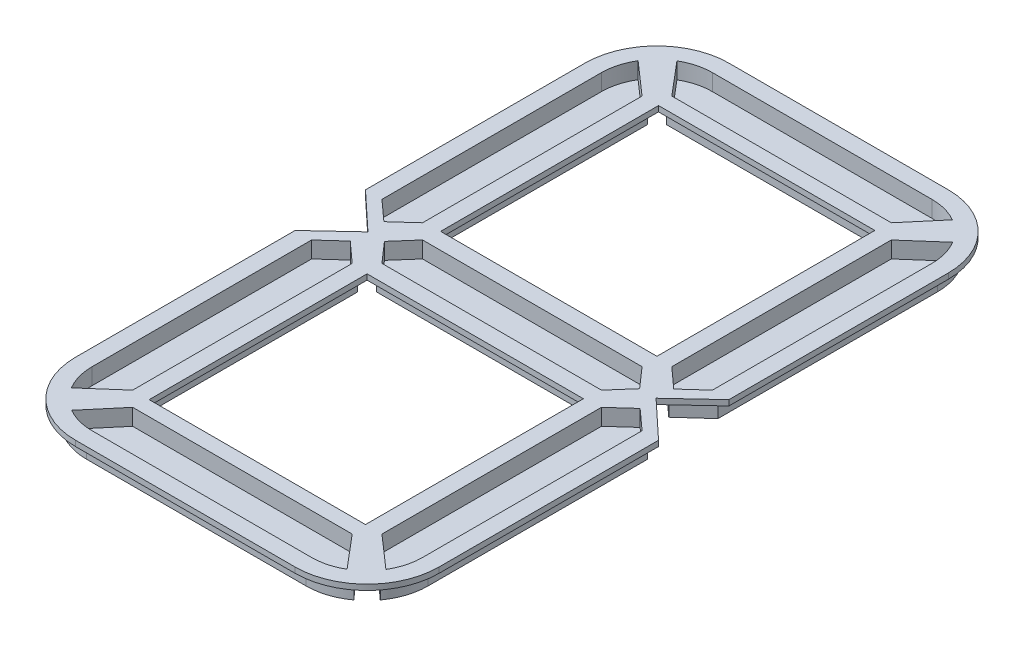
ISO-10303-21;
HEADER;
FILE_DESCRIPTION(('STEP AP214'),'2;1');
FILE_NAME('part.step','',(''),(''),'','','');
FILE_SCHEMA(('AUTOMOTIVE_DESIGN { 1 0 10303 214 1 1 1 1 }'));
ENDSEC;
DATA;
#1=APPLICATION_CONTEXT('core data for automotive mechanical design processes');
#2=APPLICATION_PROTOCOL_DEFINITION('international standard','automotive_design',2000,#1);
#3=PRODUCT_CONTEXT('',#1,'mechanical');
#4=PRODUCT('Part','Part','',(#3));
#5=PRODUCT_RELATED_PRODUCT_CATEGORY('part','',(#4));
#6=PRODUCT_DEFINITION_FORMATION('','',#4);
#7=PRODUCT_DEFINITION_CONTEXT('part definition',#1,'design');
#8=PRODUCT_DEFINITION('design','',#6,#7);
#9=PRODUCT_DEFINITION_SHAPE('','',#8);
#10=(LENGTH_UNIT() NAMED_UNIT(*) SI_UNIT(.MILLI.,.METRE.));
#11=(NAMED_UNIT(*) PLANE_ANGLE_UNIT() SI_UNIT($,.RADIAN.));
#12=(NAMED_UNIT(*) SI_UNIT($,.STERADIAN.) SOLID_ANGLE_UNIT());
#13=UNCERTAINTY_MEASURE_WITH_UNIT(LENGTH_MEASURE(1.E-05),#10,'distance_accuracy_value','');
#14=(GEOMETRIC_REPRESENTATION_CONTEXT(3) GLOBAL_UNCERTAINTY_ASSIGNED_CONTEXT((#13)) GLOBAL_UNIT_ASSIGNED_CONTEXT((#10,
#11,#12)) REPRESENTATION_CONTEXT('',''));
#15=CARTESIAN_POINT('',(0.,0.,0.));
#16=DIRECTION('',(0.,0.,1.));
#17=DIRECTION('',(1.,0.,0.));
#18=AXIS2_PLACEMENT_3D('',#15,#16,#17);
#19=CARTESIAN_POINT('',(0.,3.,0.));
#20=DIRECTION('',(0.,-1.,0.));
#21=DIRECTION('',(0.,0.,-1.));
#22=AXIS2_PLACEMENT_3D('',#19,#20,#21);
#23=PLANE('',#22);
#24=DIRECTION('',(1.,0.,0.));
#25=VECTOR('',#24,1.);
#26=CARTESIAN_POINT('',(20.,3.,-57.52));
#27=LINE('',#26,#25);
#28=CARTESIAN_POINT('',(-20.,3.,-57.52));
#29=VERTEX_POINT('',#28);
#30=CARTESIAN_POINT('',(20.,3.,-57.52));
#31=VERTEX_POINT('',#30);
#32=EDGE_CURVE('E1062',#29,#31,#27,.T.);
#33=ORIENTED_EDGE('',*,*,#32,.F.);
#34=CARTESIAN_POINT('',(-20.,3.,-46.41));
#35=DIRECTION('',(0.,-1.,0.));
#36=DIRECTION('',(0.,0.,1.));
#37=AXIS2_PLACEMENT_3D('',#34,#35,#36);
#38=CIRCLE('',#37,11.11);
#39=CARTESIAN_POINT('',(-26.5610518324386,3.,-55.3757514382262));
#40=VERTEX_POINT('',#39);
#41=EDGE_CURVE('E1038',#40,#29,#38,.T.);
#42=ORIENTED_EDGE('',*,*,#41,.F.);
#43=DIRECTION('',(-0.670706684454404,0.,-0.741722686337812));
#44=VECTOR('',#43,1.);
#45=CARTESIAN_POINT('',(-24.25,3.,-52.82));
#46=LINE('',#45,#44);
#47=CARTESIAN_POINT('',(-20.,3.,-48.12));
#48=VERTEX_POINT('',#47);
#49=EDGE_CURVE('E1044',#48,#40,#46,.T.);
#50=ORIENTED_EDGE('',*,*,#49,.F.);
#51=DIRECTION('',(-1.,0.,0.));
#52=VECTOR('',#51,1.);
#53=CARTESIAN_POINT('',(-20.,3.,-48.12));
#54=LINE('',#53,#52);
#55=CARTESIAN_POINT('',(20.,3.,-48.12));
#56=VERTEX_POINT('',#55);
#57=EDGE_CURVE('E1071',#56,#48,#54,.T.);
#58=ORIENTED_EDGE('',*,*,#57,.F.);
#59=DIRECTION('',(-0.670706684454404,0.,0.741722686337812));
#60=VECTOR('',#59,1.);
#61=CARTESIAN_POINT('',(24.25,3.,-52.82));
#62=LINE('',#61,#60);
#63=CARTESIAN_POINT('',(26.5610518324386,3.,-55.3757514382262));
#64=VERTEX_POINT('',#63);
#65=EDGE_CURVE('E1068',#64,#56,#62,.T.);
#66=ORIENTED_EDGE('',*,*,#65,.F.);
#67=CARTESIAN_POINT('',(20.,3.,-46.41));
#68=DIRECTION('',(0.,-1.,0.));
#69=DIRECTION('',(0.,0.,-1.));
#70=AXIS2_PLACEMENT_3D('',#67,#68,#69);
#71=CIRCLE('',#70,11.11);
#72=EDGE_CURVE('E1065',#31,#64,#71,.T.);
#73=ORIENTED_EDGE('',*,*,#72,.F.);
#74=EDGE_LOOP('',(#33,#42,#50,#58,#66,#73));
#75=FACE_BOUND('',#74,.T.);
#76=DIRECTION('',(-1.,0.,0.));
#77=VECTOR('',#76,1.);
#78=CARTESIAN_POINT('',(20.,3.,57.52));
#79=LINE('',#78,#77);
#80=CARTESIAN_POINT('',(20.,3.,57.52));
#81=VERTEX_POINT('',#80);
#82=CARTESIAN_POINT('',(-20.,3.,57.52));
#83=VERTEX_POINT('',#82);
#84=EDGE_CURVE('E1450',#81,#83,#79,.T.);
#85=ORIENTED_EDGE('',*,*,#84,.F.);
#86=CARTESIAN_POINT('',(20.,3.,46.41));
#87=DIRECTION('',(0.,-1.,0.));
#88=DIRECTION('',(0.,0.,1.));
#89=AXIS2_PLACEMENT_3D('',#86,#87,#88);
#90=CIRCLE('',#89,11.11);
#91=CARTESIAN_POINT('',(26.5610518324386,3.,55.3757514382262));
#92=VERTEX_POINT('',#91);
#93=EDGE_CURVE('E1425',#92,#81,#90,.T.);
#94=ORIENTED_EDGE('',*,*,#93,.F.);
#95=DIRECTION('',(0.670706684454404,0.,0.741722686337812));
#96=VECTOR('',#95,1.);
#97=CARTESIAN_POINT('',(24.25,3.,52.82));
#98=LINE('',#97,#96);
#99=CARTESIAN_POINT('',(20.,3.,48.12));
#100=VERTEX_POINT('',#99);
#101=EDGE_CURVE('E1431',#100,#92,#98,.T.);
#102=ORIENTED_EDGE('',*,*,#101,.F.);
#103=DIRECTION('',(1.,0.,0.));
#104=VECTOR('',#103,1.);
#105=CARTESIAN_POINT('',(-20.,3.,48.12));
#106=LINE('',#105,#104);
#107=CARTESIAN_POINT('',(-20.,3.,48.12));
#108=VERTEX_POINT('',#107);
#109=EDGE_CURVE('E1459',#108,#100,#106,.T.);
#110=ORIENTED_EDGE('',*,*,#109,.F.);
#111=DIRECTION('',(0.670706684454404,0.,-0.741722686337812));
#112=VECTOR('',#111,1.);
#113=CARTESIAN_POINT('',(-24.25,3.,52.82));
#114=LINE('',#113,#112);
#115=CARTESIAN_POINT('',(-26.5610518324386,3.,55.3757514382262));
#116=VERTEX_POINT('',#115);
#117=EDGE_CURVE('E1456',#116,#108,#114,.T.);
#118=ORIENTED_EDGE('',*,*,#117,.F.);
#119=CARTESIAN_POINT('',(-20.,3.,46.41));
#120=DIRECTION('',(0.,-1.,0.));
#121=DIRECTION('',(0.,0.,-1.));
#122=AXIS2_PLACEMENT_3D('',#119,#120,#121);
#123=CIRCLE('',#122,11.11);
#124=EDGE_CURVE('E1453',#83,#116,#123,.T.);
#125=ORIENTED_EDGE('',*,*,#124,.F.);
#126=EDGE_LOOP('',(#85,#94,#102,#110,#118,#125));
#127=FACE_BOUND('',#126,.T.);
#128=DIRECTION('',(-0.741722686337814,0.,0.670706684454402));
#129=VECTOR('',#128,1.);
#130=CARTESIAN_POINT('',(-28.9657514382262,3.,52.9710518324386));
#131=LINE('',#130,#129);
#132=CARTESIAN_POINT('',(-21.71,3.,46.41));
#133=VERTEX_POINT('',#132);
#134=CARTESIAN_POINT('',(-28.9657514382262,3.,52.9710518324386));
#135=VERTEX_POINT('',#134);
#136=EDGE_CURVE('E1621',#133,#135,#131,.T.);
#137=ORIENTED_EDGE('',*,*,#136,.F.);
#138=DIRECTION('',(0.,0.,1.));
#139=VECTOR('',#138,1.);
#140=CARTESIAN_POINT('',(-21.71,3.,6.41));
#141=LINE('',#140,#139);
#142=CARTESIAN_POINT('',(-21.71,3.,6.41));
#143=VERTEX_POINT('',#142);
#144=EDGE_CURVE('E1596',#143,#133,#141,.T.);
#145=ORIENTED_EDGE('',*,*,#144,.F.);
#146=DIRECTION('',(0.741722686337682,0.,0.670706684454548));
#147=VECTOR('',#146,1.);
#148=CARTESIAN_POINT('',(-21.71,3.,6.41));
#149=LINE('',#148,#147);
#150=CARTESIAN_POINT('',(-26.4099999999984,3.,2.15999999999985));
#151=VERTEX_POINT('',#150);
#152=EDGE_CURVE('E1602',#151,#143,#149,.T.);
#153=ORIENTED_EDGE('',*,*,#152,.F.);
#154=DIRECTION('',(0.741722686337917,0.,-0.670706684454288));
#155=VECTOR('',#154,1.);
#156=CARTESIAN_POINT('',(-26.4099999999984,3.,2.15999999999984));
#157=LINE('',#156,#155);
#158=CARTESIAN_POINT('',(-31.11,3.,6.41));
#159=VERTEX_POINT('',#158);
#160=EDGE_CURVE('E1630',#159,#151,#157,.T.);
#161=ORIENTED_EDGE('',*,*,#160,.F.);
#162=DIRECTION('',(0.,0.,-1.));
#163=VECTOR('',#162,1.);
#164=CARTESIAN_POINT('',(-31.11,3.,6.41));
#165=LINE('',#164,#163);
#166=CARTESIAN_POINT('',(-31.11,3.,46.41));
#167=VERTEX_POINT('',#166);
#168=EDGE_CURVE('E1627',#167,#159,#165,.T.);
#169=ORIENTED_EDGE('',*,*,#168,.F.);
#170=CARTESIAN_POINT('',(-20.,3.,46.41));
#171=DIRECTION('',(0.,-1.,0.));
#172=DIRECTION('',(0.,0.,-1.));
#173=AXIS2_PLACEMENT_3D('',#170,#171,#172);
#174=CIRCLE('',#173,11.11);
#175=EDGE_CURVE('E1624',#135,#167,#174,.T.);
#176=ORIENTED_EDGE('',*,*,#175,.F.);
#177=EDGE_LOOP('',(#137,#145,#153,#161,#169,#176));
#178=FACE_BOUND('',#177,.T.);
#179=DIRECTION('',(0.,0.,1.));
#180=VECTOR('',#179,1.);
#181=CARTESIAN_POINT('',(19.71,3.,0.));
#182=LINE('',#181,#180);
#183=CARTESIAN_POINT('',(19.71,3.,6.7));
#184=VERTEX_POINT('',#183);
#185=CARTESIAN_POINT('',(19.71,3.,46.4099999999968));
#186=VERTEX_POINT('',#185);
#187=EDGE_CURVE('E1774',#184,#186,#182,.T.);
#188=ORIENTED_EDGE('',*,*,#187,.F.);
#189=DIRECTION('',(1.,0.,0.));
#190=VECTOR('',#189,1.);
#191=CARTESIAN_POINT('',(20.,3.,6.7));
#192=LINE('',#191,#190);
#193=CARTESIAN_POINT('',(-19.7100000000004,3.,6.7));
#194=VERTEX_POINT('',#193);
#195=EDGE_CURVE('E1955',#194,#184,#192,.T.);
#196=ORIENTED_EDGE('',*,*,#195,.F.);
#197=DIRECTION('',(0.,0.,1.));
#198=VECTOR('',#197,1.);
#199=CARTESIAN_POINT('',(-19.7100000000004,3.,0.));
#200=LINE('',#199,#198);
#201=CARTESIAN_POINT('',(-19.7100000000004,3.,46.4099999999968));
#202=VERTEX_POINT('',#201);
#203=EDGE_CURVE('E1781',#194,#202,#200,.T.);
#204=ORIENTED_EDGE('',*,*,#203,.T.);
#205=DIRECTION('',(-1.,0.,0.));
#206=VECTOR('',#205,1.);
#207=CARTESIAN_POINT('',(0.,3.,46.4099999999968));
#208=LINE('',#207,#206);
#209=EDGE_CURVE('E1777',#186,#202,#208,.T.);
#210=ORIENTED_EDGE('',*,*,#209,.F.);
#211=EDGE_LOOP('',(#188,#196,#204,#210));
#212=FACE_BOUND('',#211,.T.);
#213=DIRECTION('',(0.670706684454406,0.,-0.741722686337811));
#214=VECTOR('',#213,1.);
#215=CARTESIAN_POINT('',(-20.,3.,-4.7));
#216=LINE('',#215,#214);
#217=CARTESIAN_POINT('',(-24.25,3.,0.));
#218=VERTEX_POINT('',#217);
#219=CARTESIAN_POINT('',(-20.,3.,-4.7));
#220=VERTEX_POINT('',#219);
#221=EDGE_CURVE('E1992',#218,#220,#216,.T.);
#222=ORIENTED_EDGE('',*,*,#221,.F.);
#223=DIRECTION('',(-0.670706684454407,0.,-0.74172268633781));
#224=VECTOR('',#223,1.);
#225=CARTESIAN_POINT('',(-24.25,3.,0.));
#226=LINE('',#225,#224);
#227=CARTESIAN_POINT('',(-20.,3.,4.7));
#228=VERTEX_POINT('',#227);
#229=EDGE_CURVE('E1988',#228,#218,#226,.T.);
#230=ORIENTED_EDGE('',*,*,#229,.F.);
#231=DIRECTION('',(-1.,0.,0.));
#232=VECTOR('',#231,1.);
#233=CARTESIAN_POINT('',(20.,3.,4.7));
#234=LINE('',#233,#232);
#235=CARTESIAN_POINT('',(20.,3.,4.7));
#236=VERTEX_POINT('',#235);
#237=EDGE_CURVE('E1984',#236,#228,#234,.T.);
#238=ORIENTED_EDGE('',*,*,#237,.F.);
#239=DIRECTION('',(-0.670706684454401,0.,0.741722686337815));
#240=VECTOR('',#239,1.);
#241=CARTESIAN_POINT('',(24.25,3.,0.));
#242=LINE('',#241,#240);
#243=CARTESIAN_POINT('',(24.25,3.,0.));
#244=VERTEX_POINT('',#243);
#245=EDGE_CURVE('E1980',#244,#236,#242,.T.);
#246=ORIENTED_EDGE('',*,*,#245,.F.);
#247=DIRECTION('',(0.670706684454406,0.,0.74172268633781));
#248=VECTOR('',#247,1.);
#249=CARTESIAN_POINT('',(20.,3.,-4.7));
#250=LINE('',#249,#248);
#251=CARTESIAN_POINT('',(20.,3.,-4.7));
#252=VERTEX_POINT('',#251);
#253=EDGE_CURVE('E1973',#252,#244,#250,.T.);
#254=ORIENTED_EDGE('',*,*,#253,.F.);
#255=DIRECTION('',(1.,0.,0.));
#256=VECTOR('',#255,1.);
#257=CARTESIAN_POINT('',(20.,3.,-4.7));
#258=LINE('',#257,#256);
#259=EDGE_CURVE('E12',#220,#252,#258,.T.);
#260=ORIENTED_EDGE('',*,*,#259,.F.);
#261=EDGE_LOOP('',(#222,#230,#238,#246,#254,#260));
#262=FACE_BOUND('',#261,.T.);
#263=DIRECTION('',(-0.741722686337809,0.,-0.670706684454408));
#264=VECTOR('',#263,1.);
#265=CARTESIAN_POINT('',(21.71,3.,46.41));
#266=LINE('',#265,#264);
#267=CARTESIAN_POINT('',(28.9657514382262,3.,52.9710518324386));
#268=VERTEX_POINT('',#267);
#269=CARTESIAN_POINT('',(21.71,3.,46.41));
#270=VERTEX_POINT('',#269);
#271=EDGE_CURVE('E1536',#268,#270,#266,.T.);
#272=ORIENTED_EDGE('',*,*,#271,.F.);
#273=CARTESIAN_POINT('',(20.,3.,46.41));
#274=DIRECTION('',(0.,-1.,0.));
#275=DIRECTION('',(0.,0.,1.));
#276=AXIS2_PLACEMENT_3D('',#273,#274,#275);
#277=CIRCLE('',#276,11.11);
#278=CARTESIAN_POINT('',(31.11,3.,46.41));
#279=VERTEX_POINT('',#278);
#280=EDGE_CURVE('E1511',#279,#268,#277,.T.);
#281=ORIENTED_EDGE('',*,*,#280,.F.);
#282=DIRECTION('',(0.,0.,1.));
#283=VECTOR('',#282,1.);
#284=CARTESIAN_POINT('',(31.11,3.,6.40999999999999));
#285=LINE('',#284,#283);
#286=CARTESIAN_POINT('',(31.11,3.,6.40999999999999));
#287=VERTEX_POINT('',#286);
#288=EDGE_CURVE('E1517',#287,#279,#285,.T.);
#289=ORIENTED_EDGE('',*,*,#288,.F.);
#290=DIRECTION('',(0.741722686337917,0.,0.670706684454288));
#291=VECTOR('',#290,1.);
#292=CARTESIAN_POINT('',(26.4099999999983,3.,2.15999999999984));
#293=LINE('',#292,#291);
#294=CARTESIAN_POINT('',(26.4099999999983,3.,2.15999999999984));
#295=VERTEX_POINT('',#294);
#296=EDGE_CURVE('E1545',#295,#287,#293,.T.);
#297=ORIENTED_EDGE('',*,*,#296,.F.);
#298=DIRECTION('',(0.741722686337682,0.,-0.670706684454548));
#299=VECTOR('',#298,1.);
#300=CARTESIAN_POINT('',(21.71,3.,6.40999999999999));
#301=LINE('',#300,#299);
#302=CARTESIAN_POINT('',(21.71,3.,6.40999999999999));
#303=VERTEX_POINT('',#302);
#304=EDGE_CURVE('E1542',#303,#295,#301,.T.);
#305=ORIENTED_EDGE('',*,*,#304,.F.);
#306=DIRECTION('',(0.,0.,-1.));
#307=VECTOR('',#306,1.);
#308=CARTESIAN_POINT('',(21.71,3.,6.40999999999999));
#309=LINE('',#308,#307);
#310=EDGE_CURVE('E1539',#270,#303,#309,.T.);
#311=ORIENTED_EDGE('',*,*,#310,.F.);
#312=EDGE_LOOP('',(#272,#281,#289,#297,#305,#311));
#313=FACE_BOUND('',#312,.T.);
#314=DIRECTION('',(0.,0.,-1.));
#315=VECTOR('',#314,1.);
#316=CARTESIAN_POINT('',(-19.710000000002,3.,0.));
#317=LINE('',#316,#315);
#318=CARTESIAN_POINT('',(-19.710000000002,3.,-6.7));
#319=VERTEX_POINT('',#318);
#320=CARTESIAN_POINT('',(-19.710000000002,3.,-46.4100000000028));
#321=VERTEX_POINT('',#320);
#322=EDGE_CURVE('E1300',#319,#321,#317,.T.);
#323=ORIENTED_EDGE('',*,*,#322,.F.);
#324=DIRECTION('',(-1.,0.,0.));
#325=VECTOR('',#324,1.);
#326=CARTESIAN_POINT('',(-20.,3.,-6.7));
#327=LINE('',#326,#325);
#328=CARTESIAN_POINT('',(19.71,3.,-6.7));
#329=VERTEX_POINT('',#328);
#330=EDGE_CURVE('E1958',#329,#319,#327,.T.);
#331=ORIENTED_EDGE('',*,*,#330,.F.);
#332=DIRECTION('',(0.,0.,-1.));
#333=VECTOR('',#332,1.);
#334=CARTESIAN_POINT('',(19.71,3.,0.));
#335=LINE('',#334,#333);
#336=CARTESIAN_POINT('',(19.71,3.,-46.410000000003));
#337=VERTEX_POINT('',#336);
#338=EDGE_CURVE('E1307',#329,#337,#335,.T.);
#339=ORIENTED_EDGE('',*,*,#338,.T.);
#340=DIRECTION('',(-1.,0.,0.));
#341=VECTOR('',#340,1.);
#342=CARTESIAN_POINT('',(-2.20571278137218E-13,3.,-46.4100000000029));
#343=LINE('',#342,#341);
#344=EDGE_CURVE('E1303',#337,#321,#343,.T.);
#345=ORIENTED_EDGE('',*,*,#344,.T.);
#346=EDGE_LOOP('',(#323,#331,#339,#345));
#347=FACE_BOUND('',#346,.T.);
#348=DIRECTION('',(-0.730665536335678,0.,0.68273558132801));
#349=VECTOR('',#348,1.);
#350=CARTESIAN_POINT('',(-12.2358566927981,3.,-13.0948481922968));
#351=LINE('',#350,#349);
#352=CARTESIAN_POINT('',(-26.25,3.,0.));
#353=VERTEX_POINT('',#352);
#354=CARTESIAN_POINT('',(-33.110000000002,3.,6.40999999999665));
#355=VERTEX_POINT('',#354);
#356=EDGE_CURVE('E1784',#353,#355,#351,.T.);
#357=ORIENTED_EDGE('',*,*,#356,.F.);
#358=DIRECTION('',(-0.730665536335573,0.,-0.682735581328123));
#359=VECTOR('',#358,1.);
#360=CARTESIAN_POINT('',(-12.2358566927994,3.,13.0948481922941));
#361=LINE('',#360,#359);
#362=CARTESIAN_POINT('',(-33.1100000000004,3.,-6.41000000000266));
#363=VERTEX_POINT('',#362);
#364=EDGE_CURVE('E1296',#353,#363,#361,.T.);
#365=ORIENTED_EDGE('',*,*,#364,.T.);
#366=DIRECTION('',(0.,0.,-1.));
#367=VECTOR('',#366,1.);
#368=CARTESIAN_POINT('',(-33.1100000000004,3.,0.));
#369=LINE('',#368,#367);
#370=CARTESIAN_POINT('',(-33.1100000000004,3.,-46.4100000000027));
#371=VERTEX_POINT('',#370);
#372=EDGE_CURVE('E1292',#363,#371,#369,.T.);
#373=ORIENTED_EDGE('',*,*,#372,.T.);
#374=CARTESIAN_POINT('',(-19.9999999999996,3.,-46.4099999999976));
#375=DIRECTION('',(0.,1.,0.));
#376=DIRECTION('',(0.,0.,1.));
#377=AXIS2_PLACEMENT_3D('',#374,#375,#376);
#378=CIRCLE('',#377,13.1100000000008);
#379=CARTESIAN_POINT('',(-19.9999999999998,3.,-59.5199999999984));
#380=VERTEX_POINT('',#379);
#381=EDGE_CURVE('E1288',#380,#371,#378,.T.);
#382=ORIENTED_EDGE('',*,*,#381,.F.);
#383=DIRECTION('',(1.,0.,0.));
#384=VECTOR('',#383,1.);
#385=CARTESIAN_POINT('',(0.,3.,-59.5199999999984));
#386=LINE('',#385,#384);
#387=CARTESIAN_POINT('',(20.,3.,-59.5199999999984));
#388=VERTEX_POINT('',#387);
#389=EDGE_CURVE('E1183',#380,#388,#386,.T.);
#390=ORIENTED_EDGE('',*,*,#389,.T.);
#391=CARTESIAN_POINT('',(20.,3.,-46.4099999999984));
#392=DIRECTION('',(0.,1.,0.));
#393=DIRECTION('',(0.,0.,1.));
#394=AXIS2_PLACEMENT_3D('',#391,#392,#393);
#395=CIRCLE('',#394,13.11);
#396=CARTESIAN_POINT('',(33.11,3.,-46.4099999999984));
#397=VERTEX_POINT('',#396);
#398=EDGE_CURVE('E1189',#388,#397,#395,.F.);
#399=ORIENTED_EDGE('',*,*,#398,.T.);
#400=DIRECTION('',(0.,0.,-1.));
#401=VECTOR('',#400,1.);
#402=CARTESIAN_POINT('',(33.11,3.,0.));
#403=LINE('',#402,#401);
#404=CARTESIAN_POINT('',(33.11,3.,-6.40999999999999));
#405=VERTEX_POINT('',#404);
#406=EDGE_CURVE('E1314',#405,#397,#403,.T.);
#407=ORIENTED_EDGE('',*,*,#406,.F.);
#408=DIRECTION('',(0.730665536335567,0.,-0.682735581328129));
#409=VECTOR('',#408,1.);
#410=CARTESIAN_POINT('',(12.2358566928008,3.,13.0948481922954));
#411=LINE('',#410,#409);
#412=CARTESIAN_POINT('',(26.25,3.,0.));
#413=VERTEX_POINT('',#412);
#414=EDGE_CURVE('E1310',#413,#405,#411,.T.);
#415=ORIENTED_EDGE('',*,*,#414,.F.);
#416=DIRECTION('',(0.730665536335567,0.,0.682735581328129));
#417=VECTOR('',#416,1.);
#418=CARTESIAN_POINT('',(12.2358566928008,3.,-13.0948481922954));
#419=LINE('',#418,#417);
#420=CARTESIAN_POINT('',(33.11,3.,6.40999999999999));
#421=VERTEX_POINT('',#420);
#422=EDGE_CURVE('E1770',#413,#421,#419,.T.);
#423=ORIENTED_EDGE('',*,*,#422,.T.);
#424=DIRECTION('',(0.,0.,1.));
#425=VECTOR('',#424,1.);
#426=CARTESIAN_POINT('',(33.11,3.,0.));
#427=LINE('',#426,#425);
#428=CARTESIAN_POINT('',(33.11,3.,46.41));
#429=VERTEX_POINT('',#428);
#430=EDGE_CURVE('E1766',#421,#429,#427,.T.);
#431=ORIENTED_EDGE('',*,*,#430,.T.);
#432=CARTESIAN_POINT('',(20.,3.,46.41));
#433=DIRECTION('',(0.,1.,0.));
#434=DIRECTION('',(0.,0.,1.));
#435=AXIS2_PLACEMENT_3D('',#432,#433,#434);
#436=CIRCLE('',#435,13.11);
#437=CARTESIAN_POINT('',(19.9999999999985,3.,59.52));
#438=VERTEX_POINT('',#437);
#439=EDGE_CURVE('E1762',#438,#429,#436,.T.);
#440=ORIENTED_EDGE('',*,*,#439,.F.);
#441=DIRECTION('',(1.,0.,0.));
#442=VECTOR('',#441,1.);
#443=CARTESIAN_POINT('',(0.,3.,59.52));
#444=LINE('',#443,#442);
#445=CARTESIAN_POINT('',(-20.0000000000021,3.,59.52));
#446=VERTEX_POINT('',#445);
#447=EDGE_CURVE('E1657',#446,#438,#444,.T.);
#448=ORIENTED_EDGE('',*,*,#447,.F.);
#449=CARTESIAN_POINT('',(-19.9999999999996,3.,46.4099999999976));
#450=DIRECTION('',(0.,1.,0.));
#451=DIRECTION('',(0.,0.,1.));
#452=AXIS2_PLACEMENT_3D('',#449,#450,#451);
#453=CIRCLE('',#452,13.1100000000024);
#454=CARTESIAN_POINT('',(-33.110000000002,3.,46.4099999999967));
#455=VERTEX_POINT('',#454);
#456=EDGE_CURVE('E1663',#446,#455,#453,.F.);
#457=ORIENTED_EDGE('',*,*,#456,.T.);
#458=DIRECTION('',(0.,0.,1.));
#459=VECTOR('',#458,1.);
#460=CARTESIAN_POINT('',(-33.110000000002,3.,0.));
#461=LINE('',#460,#459);
#462=EDGE_CURVE('E1787',#355,#455,#461,.T.);
#463=ORIENTED_EDGE('',*,*,#462,.F.);
#464=EDGE_LOOP('',(#357,#365,#373,#382,#390,#399,#407,#415,#423,#431,#440,#448,#457,#463));
#465=FACE_BOUND('',#464,.T.);
#466=DIRECTION('',(-0.741722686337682,0.,0.670706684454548));
#467=VECTOR('',#466,1.);
#468=CARTESIAN_POINT('',(-21.71,3.,-6.41));
#469=LINE('',#468,#467);
#470=CARTESIAN_POINT('',(-21.71,3.,-6.41));
#471=VERTEX_POINT('',#470);
#472=CARTESIAN_POINT('',(-26.4099999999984,3.,-2.15999999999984));
#473=VERTEX_POINT('',#472);
#474=EDGE_CURVE('E1147',#471,#473,#469,.T.);
#475=ORIENTED_EDGE('',*,*,#474,.F.);
#476=DIRECTION('',(0.,0.,1.));
#477=VECTOR('',#476,1.);
#478=CARTESIAN_POINT('',(-21.71,3.,-6.41));
#479=LINE('',#478,#477);
#480=CARTESIAN_POINT('',(-21.71,3.,-46.41));
#481=VERTEX_POINT('',#480);
#482=EDGE_CURVE('E1122',#481,#471,#479,.T.);
#483=ORIENTED_EDGE('',*,*,#482,.F.);
#484=DIRECTION('',(0.741722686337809,0.,0.670706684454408));
#485=VECTOR('',#484,1.);
#486=CARTESIAN_POINT('',(-21.71,3.,-46.41));
#487=LINE('',#486,#485);
#488=CARTESIAN_POINT('',(-28.9657514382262,3.,-52.9710518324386));
#489=VERTEX_POINT('',#488);
#490=EDGE_CURVE('E1128',#489,#481,#487,.T.);
#491=ORIENTED_EDGE('',*,*,#490,.F.);
#492=CARTESIAN_POINT('',(-20.,3.,-46.41));
#493=DIRECTION('',(0.,-1.,0.));
#494=DIRECTION('',(0.,0.,1.));
#495=AXIS2_PLACEMENT_3D('',#492,#493,#494);
#496=CIRCLE('',#495,11.11);
#497=CARTESIAN_POINT('',(-31.11,3.,-46.41));
#498=VERTEX_POINT('',#497);
#499=EDGE_CURVE('E1156',#498,#489,#496,.T.);
#500=ORIENTED_EDGE('',*,*,#499,.F.);
#501=DIRECTION('',(0.,0.,-1.));
#502=VECTOR('',#501,1.);
#503=CARTESIAN_POINT('',(-31.11,3.,-6.41));
#504=LINE('',#503,#502);
#505=CARTESIAN_POINT('',(-31.11,3.,-6.41));
#506=VERTEX_POINT('',#505);
#507=EDGE_CURVE('E1153',#506,#498,#504,.T.);
#508=ORIENTED_EDGE('',*,*,#507,.F.);
#509=DIRECTION('',(-0.741722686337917,0.,-0.670706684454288));
#510=VECTOR('',#509,1.);
#511=CARTESIAN_POINT('',(-26.4099999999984,3.,-2.15999999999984));
#512=LINE('',#511,#510);
#513=EDGE_CURVE('E1150',#473,#506,#512,.T.);
#514=ORIENTED_EDGE('',*,*,#513,.F.);
#515=EDGE_LOOP('',(#475,#483,#491,#500,#508,#514));
#516=FACE_BOUND('',#515,.T.);
#517=DIRECTION('',(0.741722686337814,0.,-0.670706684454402));
#518=VECTOR('',#517,1.);
#519=CARTESIAN_POINT('',(28.9657514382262,3.,-52.9710518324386));
#520=LINE('',#519,#518);
#521=CARTESIAN_POINT('',(21.71,3.,-46.41));
#522=VERTEX_POINT('',#521);
#523=CARTESIAN_POINT('',(28.9657514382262,3.,-52.9710518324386));
#524=VERTEX_POINT('',#523);
#525=EDGE_CURVE('E980',#522,#524,#520,.T.);
#526=ORIENTED_EDGE('',*,*,#525,.F.);
#527=DIRECTION('',(0.,0.,-1.));
#528=VECTOR('',#527,1.);
#529=CARTESIAN_POINT('',(21.71,3.,-6.40999999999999));
#530=LINE('',#529,#528);
#531=CARTESIAN_POINT('',(21.71,3.,-6.40999999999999));
#532=VERTEX_POINT('',#531);
#533=EDGE_CURVE('E955',#532,#522,#530,.T.);
#534=ORIENTED_EDGE('',*,*,#533,.F.);
#535=DIRECTION('',(-0.741722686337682,0.,-0.670706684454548));
#536=VECTOR('',#535,1.);
#537=CARTESIAN_POINT('',(21.71,3.,-6.40999999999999));
#538=LINE('',#537,#536);
#539=CARTESIAN_POINT('',(26.4099999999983,3.,-2.15999999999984));
#540=VERTEX_POINT('',#539);
#541=EDGE_CURVE('E961',#540,#532,#538,.T.);
#542=ORIENTED_EDGE('',*,*,#541,.F.);
#543=DIRECTION('',(-0.741722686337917,0.,0.670706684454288));
#544=VECTOR('',#543,1.);
#545=CARTESIAN_POINT('',(26.4099999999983,3.,-2.15999999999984));
#546=LINE('',#545,#544);
#547=CARTESIAN_POINT('',(31.11,3.,-6.40999999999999));
#548=VERTEX_POINT('',#547);
#549=EDGE_CURVE('E989',#548,#540,#546,.T.);
#550=ORIENTED_EDGE('',*,*,#549,.F.);
#551=DIRECTION('',(0.,0.,1.));
#552=VECTOR('',#551,1.);
#553=CARTESIAN_POINT('',(31.11,3.,-6.40999999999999));
#554=LINE('',#553,#552);
#555=CARTESIAN_POINT('',(31.11,3.,-46.41));
#556=VERTEX_POINT('',#555);
#557=EDGE_CURVE('E986',#556,#548,#554,.T.);
#558=ORIENTED_EDGE('',*,*,#557,.F.);
#559=CARTESIAN_POINT('',(20.,3.,-46.41));
#560=DIRECTION('',(0.,-1.,0.));
#561=DIRECTION('',(0.,0.,-1.));
#562=AXIS2_PLACEMENT_3D('',#559,#560,#561);
#563=CIRCLE('',#562,11.11);
#564=EDGE_CURVE('E983',#524,#556,#563,.T.);
#565=ORIENTED_EDGE('',*,*,#564,.F.);
#566=EDGE_LOOP('',(#526,#534,#542,#550,#558,#565));
#567=FACE_BOUND('',#566,.T.);
#568=ADVANCED_FACE('F255',(#75,#127,#178,#212,#262,#313,#347,#465,#516,#567),#23,.T.);
#569=CARTESIAN_POINT('',(-20.,3.,-6.7));
#570=DIRECTION('',(0.,0.,-1.));
#571=DIRECTION('',(-1.,0.,0.));
#572=AXIS2_PLACEMENT_3D('',#569,#570,#571);
#573=PLANE('',#572);
#574=ORIENTED_EDGE('',*,*,#330,.T.);
#575=DIRECTION('',(0.,1.,0.));
#576=VECTOR('',#575,1.);
#577=CARTESIAN_POINT('',(-19.710000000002,3.,-6.7));
#578=LINE('',#577,#576);
#579=CARTESIAN_POINT('',(-19.710000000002,4.,-6.7));
#580=VERTEX_POINT('',#579);
#581=EDGE_CURVE('E1398',#319,#580,#578,.T.);
#582=ORIENTED_EDGE('',*,*,#581,.T.);
#583=DIRECTION('',(-1.,0.,0.));
#584=VECTOR('',#583,1.);
#585=CARTESIAN_POINT('',(-20.,4.,-6.7));
#586=LINE('',#585,#584);
#587=CARTESIAN_POINT('',(19.71,4.,-6.7));
#588=VERTEX_POINT('',#587);
#589=EDGE_CURVE('E1959',#588,#580,#586,.T.);
#590=ORIENTED_EDGE('',*,*,#589,.F.);
#591=DIRECTION('',(0.,1.,0.));
#592=VECTOR('',#591,1.);
#593=CARTESIAN_POINT('',(19.71,3.,-6.7));
#594=LINE('',#593,#592);
#595=EDGE_CURVE('E921',#329,#588,#594,.T.);
#596=ORIENTED_EDGE('',*,*,#595,.F.);
#597=EDGE_LOOP('',(#574,#582,#590,#596));
#598=FACE_BOUND('',#597,.T.);
#599=ADVANCED_FACE('F2063',(#598),#573,.T.);
#600=CARTESIAN_POINT('',(20.,3.,6.7));
#601=DIRECTION('',(0.,0.,1.));
#602=DIRECTION('',(1.,0.,0.));
#603=AXIS2_PLACEMENT_3D('',#600,#601,#602);
#604=PLANE('',#603);
#605=ORIENTED_EDGE('',*,*,#195,.T.);
#606=DIRECTION('',(0.,1.,0.));
#607=VECTOR('',#606,1.);
#608=CARTESIAN_POINT('',(19.71,3.,6.7));
#609=LINE('',#608,#607);
#610=CARTESIAN_POINT('',(19.71,4.,6.7));
#611=VERTEX_POINT('',#610);
#612=EDGE_CURVE('E1879',#184,#611,#609,.T.);
#613=ORIENTED_EDGE('',*,*,#612,.T.);
#614=DIRECTION('',(1.,0.,0.));
#615=VECTOR('',#614,1.);
#616=CARTESIAN_POINT('',(20.,4.,6.7));
#617=LINE('',#616,#615);
#618=CARTESIAN_POINT('',(-19.7100000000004,4.,6.7));
#619=VERTEX_POINT('',#618);
#620=EDGE_CURVE('E1935',#619,#611,#617,.T.);
#621=ORIENTED_EDGE('',*,*,#620,.F.);
#622=DIRECTION('',(0.,1.,0.));
#623=VECTOR('',#622,1.);
#624=CARTESIAN_POINT('',(-19.7100000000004,3.,6.7));
#625=LINE('',#624,#623);
#626=EDGE_CURVE('E1813',#194,#619,#625,.T.);
#627=ORIENTED_EDGE('',*,*,#626,.F.);
#628=EDGE_LOOP('',(#605,#613,#621,#627));
#629=FACE_BOUND('',#628,.T.);
#630=ADVANCED_FACE('F2533',(#629),#604,.T.);
#631=CARTESIAN_POINT('',(-20.,4.,-4.7));
#632=DIRECTION('',(0.741722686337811,0.,0.670706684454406));
#633=DIRECTION('',(0.670706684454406,0.,-0.741722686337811));
#634=AXIS2_PLACEMENT_3D('',#631,#632,#633);
#635=PLANE('',#634);
#636=DIRECTION('',(0.,-1.,0.));
#637=VECTOR('',#636,1.);
#638=CARTESIAN_POINT('',(-24.25,4.,0.));
#639=LINE('',#638,#637);
#640=CARTESIAN_POINT('',(-24.25,0.,0.));
#641=VERTEX_POINT('',#640);
#642=EDGE_CURVE('E264',#218,#641,#639,.T.);
#643=ORIENTED_EDGE('',*,*,#642,.F.);
#644=ORIENTED_EDGE('',*,*,#221,.T.);
#645=DIRECTION('',(0.,-1.,0.));
#646=VECTOR('',#645,1.);
#647=CARTESIAN_POINT('',(-20.,4.,-4.7));
#648=LINE('',#647,#646);
#649=CARTESIAN_POINT('',(-20.,0.,-4.7));
#650=VERTEX_POINT('',#649);
#651=EDGE_CURVE('E2020',#220,#650,#648,.T.);
#652=ORIENTED_EDGE('',*,*,#651,.T.);
#653=DIRECTION('',(-0.670706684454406,0.,0.741722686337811));
#654=VECTOR('',#653,1.);
#655=CARTESIAN_POINT('',(-20.,0.,-4.7));
#656=LINE('',#655,#654);
#657=EDGE_CURVE('E1996',#650,#641,#656,.T.);
#658=ORIENTED_EDGE('',*,*,#657,.T.);
#659=EDGE_LOOP('',(#643,#644,#652,#658));
#660=FACE_BOUND('',#659,.T.);
#661=ADVANCED_FACE('F257',(#660),#635,.F.);
#662=CARTESIAN_POINT('',(-24.25,4.,0.));
#663=DIRECTION('',(0.74172268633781,0.,-0.670706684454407));
#664=DIRECTION('',(-0.670706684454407,0.,-0.74172268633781));
#665=AXIS2_PLACEMENT_3D('',#662,#663,#664);
#666=PLANE('',#665);
#667=DIRECTION('',(0.,-1.,0.));
#668=VECTOR('',#667,1.);
#669=CARTESIAN_POINT('',(-20.,4.,4.7));
#670=LINE('',#669,#668);
#671=CARTESIAN_POINT('',(-20.,0.,4.7));
#672=VERTEX_POINT('',#671);
#673=EDGE_CURVE('E2032',#228,#672,#670,.T.);
#674=ORIENTED_EDGE('',*,*,#673,.F.);
#675=ORIENTED_EDGE('',*,*,#229,.T.);
#676=ORIENTED_EDGE('',*,*,#642,.T.);
#677=DIRECTION('',(0.670706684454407,0.,0.74172268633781));
#678=VECTOR('',#677,1.);
#679=CARTESIAN_POINT('',(-24.25,0.,0.));
#680=LINE('',#679,#678);
#681=EDGE_CURVE('E2000',#641,#672,#680,.T.);
#682=ORIENTED_EDGE('',*,*,#681,.T.);
#683=EDGE_LOOP('',(#674,#675,#676,#682));
#684=FACE_BOUND('',#683,.T.);
#685=ADVANCED_FACE('F2039',(#684),#666,.F.);
#686=CARTESIAN_POINT('',(20.,4.,4.7));
#687=DIRECTION('',(0.,0.,-1.));
#688=DIRECTION('',(-1.,0.,0.));
#689=AXIS2_PLACEMENT_3D('',#686,#687,#688);
#690=PLANE('',#689);
#691=DIRECTION('',(0.,-1.,0.));
#692=VECTOR('',#691,1.);
#693=CARTESIAN_POINT('',(20.,4.,4.7));
#694=LINE('',#693,#692);
#695=CARTESIAN_POINT('',(20.,0.,4.7));
#696=VERTEX_POINT('',#695);
#697=EDGE_CURVE('E2029',#236,#696,#694,.T.);
#698=ORIENTED_EDGE('',*,*,#697,.F.);
#699=ORIENTED_EDGE('',*,*,#237,.T.);
#700=ORIENTED_EDGE('',*,*,#673,.T.);
#701=DIRECTION('',(1.,0.,0.));
#702=VECTOR('',#701,1.);
#703=CARTESIAN_POINT('',(20.,0.,4.7));
#704=LINE('',#703,#702);
#705=EDGE_CURVE('E2004',#672,#696,#704,.T.);
#706=ORIENTED_EDGE('',*,*,#705,.T.);
#707=EDGE_LOOP('',(#698,#699,#700,#706));
#708=FACE_BOUND('',#707,.T.);
#709=ADVANCED_FACE('F2059',(#708),#690,.F.);
#710=CARTESIAN_POINT('',(24.25,4.,0.));
#711=DIRECTION('',(-0.741722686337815,0.,-0.670706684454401));
#712=DIRECTION('',(-0.670706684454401,0.,0.741722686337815));
#713=AXIS2_PLACEMENT_3D('',#710,#711,#712);
#714=PLANE('',#713);
#715=DIRECTION('',(0.,-1.,0.));
#716=VECTOR('',#715,1.);
#717=CARTESIAN_POINT('',(24.25,4.,0.));
#718=LINE('',#717,#716);
#719=CARTESIAN_POINT('',(24.25,0.,0.));
#720=VERTEX_POINT('',#719);
#721=EDGE_CURVE('E2026',#244,#720,#718,.T.);
#722=ORIENTED_EDGE('',*,*,#721,.F.);
#723=ORIENTED_EDGE('',*,*,#245,.T.);
#724=ORIENTED_EDGE('',*,*,#697,.T.);
#725=DIRECTION('',(0.670706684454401,0.,-0.741722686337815));
#726=VECTOR('',#725,1.);
#727=CARTESIAN_POINT('',(24.25,0.,0.));
#728=LINE('',#727,#726);
#729=EDGE_CURVE('E2008',#696,#720,#728,.T.);
#730=ORIENTED_EDGE('',*,*,#729,.T.);
#731=EDGE_LOOP('',(#722,#723,#724,#730));
#732=FACE_BOUND('',#731,.T.);
#733=ADVANCED_FACE('F2056',(#732),#714,.F.);
#734=CARTESIAN_POINT('',(20.,4.,-4.7));
#735=DIRECTION('',(-0.74172268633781,0.,0.670706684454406));
#736=DIRECTION('',(0.670706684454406,0.,0.74172268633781));
#737=AXIS2_PLACEMENT_3D('',#734,#735,#736);
#738=PLANE('',#737);
#739=DIRECTION('',(0.,-1.,0.));
#740=VECTOR('',#739,1.);
#741=CARTESIAN_POINT('',(20.,4.,-4.7));
#742=LINE('',#741,#740);
#743=CARTESIAN_POINT('',(20.,0.,-4.7));
#744=VERTEX_POINT('',#743);
#745=EDGE_CURVE('E2023',#252,#744,#742,.T.);
#746=ORIENTED_EDGE('',*,*,#745,.F.);
#747=ORIENTED_EDGE('',*,*,#253,.T.);
#748=ORIENTED_EDGE('',*,*,#721,.T.);
#749=DIRECTION('',(-0.670706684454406,0.,-0.74172268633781));
#750=VECTOR('',#749,1.);
#751=CARTESIAN_POINT('',(20.,0.,-4.7));
#752=LINE('',#751,#750);
#753=EDGE_CURVE('E2012',#720,#744,#752,.T.);
#754=ORIENTED_EDGE('',*,*,#753,.T.);
#755=EDGE_LOOP('',(#746,#747,#748,#754));
#756=FACE_BOUND('',#755,.T.);
#757=ADVANCED_FACE('F2053',(#756),#738,.F.);
#758=CARTESIAN_POINT('',(20.,4.,-4.7));
#759=DIRECTION('',(0.,0.,1.));
#760=DIRECTION('',(1.,0.,0.));
#761=AXIS2_PLACEMENT_3D('',#758,#759,#760);
#762=PLANE('',#761);
#763=ORIENTED_EDGE('',*,*,#651,.F.);
#764=ORIENTED_EDGE('',*,*,#259,.T.);
#765=ORIENTED_EDGE('',*,*,#745,.T.);
#766=DIRECTION('',(-1.,0.,0.));
#767=VECTOR('',#766,1.);
#768=CARTESIAN_POINT('',(20.,0.,-4.7));
#769=LINE('',#768,#767);
#770=EDGE_CURVE('E2016',#744,#650,#769,.T.);
#771=ORIENTED_EDGE('',*,*,#770,.T.);
#772=EDGE_LOOP('',(#763,#764,#765,#771));
#773=FACE_BOUND('',#772,.T.);
#774=ADVANCED_FACE('F2049',(#773),#762,.F.);
#775=CARTESIAN_POINT('',(0.,0.,0.));
#776=DIRECTION('',(0.,1.,0.));
#777=DIRECTION('',(0.,0.,1.));
#778=AXIS2_PLACEMENT_3D('',#775,#776,#777);
#779=PLANE('',#778);
#780=ORIENTED_EDGE('',*,*,#657,.F.);
#781=ORIENTED_EDGE('',*,*,#770,.F.);
#782=ORIENTED_EDGE('',*,*,#753,.F.);
#783=ORIENTED_EDGE('',*,*,#729,.F.);
#784=ORIENTED_EDGE('',*,*,#705,.F.);
#785=ORIENTED_EDGE('',*,*,#681,.F.);
#786=EDGE_LOOP('',(#780,#781,#782,#783,#784,#785));
#787=FACE_BOUND('',#786,.T.);
#788=ADVANCED_FACE('F2044',(#787),#779,.F.);
#789=CARTESIAN_POINT('',(0.,4.,0.));
#790=DIRECTION('',(0.,1.,0.));
#791=DIRECTION('',(0.,0.,1.));
#792=AXIS2_PLACEMENT_3D('',#789,#790,#791);
#793=PLANE('',#792);
#794=DIRECTION('',(-0.730665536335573,0.,-0.682735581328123));
#795=VECTOR('',#794,1.);
#796=CARTESIAN_POINT('',(-12.2358566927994,4.,13.0948481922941));
#797=LINE('',#796,#795);
#798=CARTESIAN_POINT('',(-26.2500000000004,4.,-2.7373936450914E-12));
#799=VERTEX_POINT('',#798);
#800=CARTESIAN_POINT('',(-33.1100000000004,4.,-6.41000000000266));
#801=VERTEX_POINT('',#800);
#802=EDGE_CURVE('E1239',#799,#801,#797,.T.);
#803=ORIENTED_EDGE('',*,*,#802,.F.);
#804=DIRECTION('',(-0.730665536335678,0.,0.68273558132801));
#805=VECTOR('',#804,1.);
#806=CARTESIAN_POINT('',(-12.2358566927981,4.,-13.0948481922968));
#807=LINE('',#806,#805);
#808=CARTESIAN_POINT('',(-33.110000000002,4.,6.40999999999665));
#809=VERTEX_POINT('',#808);
#810=EDGE_CURVE('E1684',#799,#809,#807,.T.);
#811=ORIENTED_EDGE('',*,*,#810,.T.);
#812=DIRECTION('',(0.,0.,1.));
#813=VECTOR('',#812,1.);
#814=CARTESIAN_POINT('',(-33.110000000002,4.,0.));
#815=LINE('',#814,#813);
#816=CARTESIAN_POINT('',(-33.110000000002,4.,46.4099999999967));
#817=VERTEX_POINT('',#816);
#818=EDGE_CURVE('E1687',#809,#817,#815,.T.);
#819=ORIENTED_EDGE('',*,*,#818,.T.);
#820=CARTESIAN_POINT('',(-19.9999999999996,4.,46.4099999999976));
#821=DIRECTION('',(0.,1.,0.));
#822=DIRECTION('',(0.,0.,1.));
#823=AXIS2_PLACEMENT_3D('',#820,#821,#822);
#824=CIRCLE('',#823,13.1100000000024);
#825=CARTESIAN_POINT('',(-20.0000000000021,4.,59.52));
#826=VERTEX_POINT('',#825);
#827=EDGE_CURVE('E1690',#826,#817,#824,.F.);
#828=ORIENTED_EDGE('',*,*,#827,.F.);
#829=DIRECTION('',(1.,0.,0.));
#830=VECTOR('',#829,1.);
#831=CARTESIAN_POINT('',(0.,4.,59.52));
#832=LINE('',#831,#830);
#833=CARTESIAN_POINT('',(19.9999999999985,4.,59.52));
#834=VERTEX_POINT('',#833);
#835=EDGE_CURVE('E1658',#826,#834,#832,.T.);
#836=ORIENTED_EDGE('',*,*,#835,.T.);
#837=CARTESIAN_POINT('',(20.,4.,46.41));
#838=DIRECTION('',(0.,1.,0.));
#839=DIRECTION('',(0.,0.,1.));
#840=AXIS2_PLACEMENT_3D('',#837,#838,#839);
#841=CIRCLE('',#840,13.11);
#842=CARTESIAN_POINT('',(33.11,4.,46.41));
#843=VERTEX_POINT('',#842);
#844=EDGE_CURVE('E1662',#834,#843,#841,.T.);
#845=ORIENTED_EDGE('',*,*,#844,.T.);
#846=DIRECTION('',(0.,0.,1.));
#847=VECTOR('',#846,1.);
#848=CARTESIAN_POINT('',(33.11,4.,0.));
#849=LINE('',#848,#847);
#850=CARTESIAN_POINT('',(33.11,4.,6.40999999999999));
#851=VERTEX_POINT('',#850);
#852=EDGE_CURVE('E1666',#851,#843,#849,.T.);
#853=ORIENTED_EDGE('',*,*,#852,.F.);
#854=DIRECTION('',(0.730665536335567,0.,0.682735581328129));
#855=VECTOR('',#854,1.);
#856=CARTESIAN_POINT('',(12.2358566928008,4.,-13.0948481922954));
#857=LINE('',#856,#855);
#858=CARTESIAN_POINT('',(26.25,4.,0.));
#859=VERTEX_POINT('',#858);
#860=EDGE_CURVE('E1670',#859,#851,#857,.T.);
#861=ORIENTED_EDGE('',*,*,#860,.F.);
#862=DIRECTION('',(0.730665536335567,0.,-0.682735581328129));
#863=VECTOR('',#862,1.);
#864=CARTESIAN_POINT('',(12.2358566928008,4.,13.0948481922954));
#865=LINE('',#864,#863);
#866=CARTESIAN_POINT('',(33.11,4.,-6.40999999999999));
#867=VERTEX_POINT('',#866);
#868=EDGE_CURVE('E1253',#859,#867,#865,.T.);
#869=ORIENTED_EDGE('',*,*,#868,.T.);
#870=DIRECTION('',(0.,0.,-1.));
#871=VECTOR('',#870,1.);
#872=CARTESIAN_POINT('',(33.11,4.,0.));
#873=LINE('',#872,#871);
#874=CARTESIAN_POINT('',(33.11,4.,-46.4099999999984));
#875=VERTEX_POINT('',#874);
#876=EDGE_CURVE('E1257',#867,#875,#873,.T.);
#877=ORIENTED_EDGE('',*,*,#876,.T.);
#878=CARTESIAN_POINT('',(20.,4.,-46.4099999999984));
#879=DIRECTION('',(0.,1.,0.));
#880=DIRECTION('',(0.,0.,1.));
#881=AXIS2_PLACEMENT_3D('',#878,#879,#880);
#882=CIRCLE('',#881,13.11);
#883=CARTESIAN_POINT('',(20.,4.,-59.5199999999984));
#884=VERTEX_POINT('',#883);
#885=EDGE_CURVE('E1260',#884,#875,#882,.F.);
#886=ORIENTED_EDGE('',*,*,#885,.F.);
#887=DIRECTION('',(1.,0.,0.));
#888=VECTOR('',#887,1.);
#889=CARTESIAN_POINT('',(0.,4.,-59.5199999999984));
#890=LINE('',#889,#888);
#891=CARTESIAN_POINT('',(-19.9999999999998,4.,-59.5199999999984));
#892=VERTEX_POINT('',#891);
#893=EDGE_CURVE('E1228',#892,#884,#890,.T.);
#894=ORIENTED_EDGE('',*,*,#893,.F.);
#895=CARTESIAN_POINT('',(-19.9999999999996,4.,-46.4099999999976));
#896=DIRECTION('',(0.,1.,0.));
#897=DIRECTION('',(0.,0.,1.));
#898=AXIS2_PLACEMENT_3D('',#895,#896,#897);
#899=CIRCLE('',#898,13.1100000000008);
#900=CARTESIAN_POINT('',(-33.1100000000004,4.,-46.4100000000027));
#901=VERTEX_POINT('',#900);
#902=EDGE_CURVE('E1232',#892,#901,#899,.T.);
#903=ORIENTED_EDGE('',*,*,#902,.T.);
#904=DIRECTION('',(0.,0.,-1.));
#905=VECTOR('',#904,1.);
#906=CARTESIAN_POINT('',(-33.1100000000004,4.,0.));
#907=LINE('',#906,#905);
#908=EDGE_CURVE('E1235',#801,#901,#907,.T.);
#909=ORIENTED_EDGE('',*,*,#908,.F.);
#910=EDGE_LOOP('',(#803,#811,#819,#828,#836,#845,#853,#861,#869,#877,#886,#894,#903,#909));
#911=FACE_BOUND('',#910,.T.);
#912=DIRECTION('',(0.,0.,-1.));
#913=VECTOR('',#912,1.);
#914=CARTESIAN_POINT('',(19.71,4.,0.));
#915=LINE('',#914,#913);
#916=CARTESIAN_POINT('',(19.71,4.,-46.410000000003));
#917=VERTEX_POINT('',#916);
#918=EDGE_CURVE('E1250',#588,#917,#915,.T.);
#919=ORIENTED_EDGE('',*,*,#918,.F.);
#920=ORIENTED_EDGE('',*,*,#589,.T.);
#921=DIRECTION('',(0.,0.,-1.));
#922=VECTOR('',#921,1.);
#923=CARTESIAN_POINT('',(-19.710000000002,4.,0.));
#924=LINE('',#923,#922);
#925=CARTESIAN_POINT('',(-19.710000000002,4.,-46.4100000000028));
#926=VERTEX_POINT('',#925);
#927=EDGE_CURVE('E1243',#580,#926,#924,.T.);
#928=ORIENTED_EDGE('',*,*,#927,.T.);
#929=DIRECTION('',(-1.,0.,0.));
#930=VECTOR('',#929,1.);
#931=CARTESIAN_POINT('',(-2.20571278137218E-13,4.,-46.4100000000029));
#932=LINE('',#931,#930);
#933=EDGE_CURVE('E1246',#917,#926,#932,.T.);
#934=ORIENTED_EDGE('',*,*,#933,.F.);
#935=EDGE_LOOP('',(#919,#920,#928,#934));
#936=FACE_BOUND('',#935,.T.);
#937=DIRECTION('',(0.,0.,1.));
#938=VECTOR('',#937,1.);
#939=CARTESIAN_POINT('',(-19.7100000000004,4.,0.));
#940=LINE('',#939,#938);
#941=CARTESIAN_POINT('',(-19.7100000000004,4.,46.4099999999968));
#942=VERTEX_POINT('',#941);
#943=EDGE_CURVE('E1681',#619,#942,#940,.T.);
#944=ORIENTED_EDGE('',*,*,#943,.F.);
#945=ORIENTED_EDGE('',*,*,#620,.T.);
#946=DIRECTION('',(0.,0.,1.));
#947=VECTOR('',#946,1.);
#948=CARTESIAN_POINT('',(19.71,4.,0.));
#949=LINE('',#948,#947);
#950=CARTESIAN_POINT('',(19.71,4.,46.4099999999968));
#951=VERTEX_POINT('',#950);
#952=EDGE_CURVE('E1674',#611,#951,#949,.T.);
#953=ORIENTED_EDGE('',*,*,#952,.T.);
#954=DIRECTION('',(-1.,0.,0.));
#955=VECTOR('',#954,1.);
#956=CARTESIAN_POINT('',(0.,4.,46.4099999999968));
#957=LINE('',#956,#955);
#958=EDGE_CURVE('E1677',#951,#942,#957,.T.);
#959=ORIENTED_EDGE('',*,*,#958,.T.);
#960=EDGE_LOOP('',(#944,#945,#953,#959));
#961=FACE_BOUND('',#960,.T.);
#962=DIRECTION('',(-1.,0.,0.));
#963=VECTOR('',#962,1.);
#964=CARTESIAN_POINT('',(-20.,4.,3.7));
#965=LINE('',#964,#963);
#966=CARTESIAN_POINT('',(20.,4.,3.7));
#967=VERTEX_POINT('',#966);
#968=CARTESIAN_POINT('',(-20.,4.,3.7));
#969=VERTEX_POINT('',#968);
#970=EDGE_CURVE('E1906',#967,#969,#965,.T.);
#971=ORIENTED_EDGE('',*,*,#970,.T.);
#972=DIRECTION('',(-0.65994099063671,0.,-0.751317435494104));
#973=VECTOR('',#972,1.);
#974=CARTESIAN_POINT('',(-23.25,4.,0.));
#975=LINE('',#974,#973);
#976=CARTESIAN_POINT('',(-23.25,4.,0.));
#977=VERTEX_POINT('',#976);
#978=EDGE_CURVE('E1910',#969,#977,#975,.T.);
#979=ORIENTED_EDGE('',*,*,#978,.T.);
#980=DIRECTION('',(0.65994099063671,0.,-0.751317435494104));
#981=VECTOR('',#980,1.);
#982=CARTESIAN_POINT('',(-20.,4.,-3.7));
#983=LINE('',#982,#981);
#984=CARTESIAN_POINT('',(-20.,4.,-3.7));
#985=VERTEX_POINT('',#984);
#986=EDGE_CURVE('E1914',#977,#985,#983,.T.);
#987=ORIENTED_EDGE('',*,*,#986,.T.);
#988=DIRECTION('',(1.,0.,0.));
#989=VECTOR('',#988,1.);
#990=CARTESIAN_POINT('',(20.,4.,-3.7));
#991=LINE('',#990,#989);
#992=CARTESIAN_POINT('',(20.,4.,-3.7));
#993=VERTEX_POINT('',#992);
#994=EDGE_CURVE('E1918',#985,#993,#991,.T.);
#995=ORIENTED_EDGE('',*,*,#994,.T.);
#996=DIRECTION('',(0.659940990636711,0.,0.751317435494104));
#997=VECTOR('',#996,1.);
#998=CARTESIAN_POINT('',(23.25,4.,0.));
#999=LINE('',#998,#997);
#1000=CARTESIAN_POINT('',(23.25,4.,0.));
#1001=VERTEX_POINT('',#1000);
#1002=EDGE_CURVE('E1922',#993,#1001,#999,.T.);
#1003=ORIENTED_EDGE('',*,*,#1002,.T.);
#1004=DIRECTION('',(-0.65994099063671,0.,0.751317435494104));
#1005=VECTOR('',#1004,1.);
#1006=CARTESIAN_POINT('',(20.,4.,3.7));
#1007=LINE('',#1006,#1005);
#1008=EDGE_CURVE('E1926',#1001,#967,#1007,.T.);
#1009=ORIENTED_EDGE('',*,*,#1008,.T.);
#1010=EDGE_LOOP('',(#971,#979,#987,#995,#1003,#1009));
#1011=FACE_BOUND('',#1010,.T.);
#1012=DIRECTION('',(1.,0.,0.));
#1013=VECTOR('',#1012,1.);
#1014=CARTESIAN_POINT('',(-2.74530398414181E-13,4.,56.5199999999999));
#1015=LINE('',#1014,#1013);
#1016=CARTESIAN_POINT('',(-20.0000000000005,4.,56.5199999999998));
#1017=VERTEX_POINT('',#1016);
#1018=CARTESIAN_POINT('',(20.,4.,56.52));
#1019=VERTEX_POINT('',#1018);
#1020=EDGE_CURVE('E1694',#1017,#1019,#1015,.T.);
#1021=ORIENTED_EDGE('',*,*,#1020,.F.);
#1022=CARTESIAN_POINT('',(-19.9999999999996,4.,46.4099999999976));
#1023=DIRECTION('',(0.,1.,0.));
#1024=DIRECTION('',(0.,0.,1.));
#1025=AXIS2_PLACEMENT_3D('',#1022,#1023,#1024);
#1026=CIRCLE('',#1025,10.1100000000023);
#1027=CARTESIAN_POINT('',(-25.0892392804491,4.,55.1456593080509));
#1028=VERTEX_POINT('',#1027);
#1029=EDGE_CURVE('E1698',#1017,#1028,#1026,.F.);
#1030=ORIENTED_EDGE('',*,*,#1029,.T.);
#1031=DIRECTION('',(0.645247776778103,0.,-0.763973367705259));
#1032=VECTOR('',#1031,1.);
#1033=CARTESIAN_POINT('',(12.5407018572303,4.,10.5918090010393));
#1034=LINE('',#1033,#1032);
#1035=CARTESIAN_POINT('',(-20.0000000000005,4.,49.1199999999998));
#1036=VERTEX_POINT('',#1035);
#1037=EDGE_CURVE('E1702',#1028,#1036,#1034,.T.);
#1038=ORIENTED_EDGE('',*,*,#1037,.T.);
#1039=DIRECTION('',(-1.,0.,0.));
#1040=VECTOR('',#1039,1.);
#1041=CARTESIAN_POINT('',(-2.38586927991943E-13,4.,49.1199999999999));
#1042=LINE('',#1041,#1040);
#1043=CARTESIAN_POINT('',(20.,4.,49.12));
#1044=VERTEX_POINT('',#1043);
#1045=EDGE_CURVE('E1705',#1044,#1036,#1042,.T.);
#1046=ORIENTED_EDGE('',*,*,#1045,.F.);
#1047=DIRECTION('',(-0.645247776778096,0.,-0.763973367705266));
#1048=VECTOR('',#1047,1.);
#1049=CARTESIAN_POINT('',(-12.5407018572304,4.,10.5918090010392));
#1050=LINE('',#1049,#1048);
#1051=CARTESIAN_POINT('',(25.0892392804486,4.,55.1456593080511));
#1052=VERTEX_POINT('',#1051);
#1053=EDGE_CURVE('E1709',#1052,#1044,#1050,.T.);
#1054=ORIENTED_EDGE('',*,*,#1053,.F.);
#1055=CARTESIAN_POINT('',(20.,4.,46.41));
#1056=DIRECTION('',(0.,1.,0.));
#1057=DIRECTION('',(0.,0.,1.));
#1058=AXIS2_PLACEMENT_3D('',#1055,#1056,#1057);
#1059=CIRCLE('',#1058,10.11);
#1060=EDGE_CURVE('E1713',#1019,#1052,#1059,.T.);
#1061=ORIENTED_EDGE('',*,*,#1060,.F.);
#1062=EDGE_LOOP('',(#1021,#1030,#1038,#1046,#1054,#1061));
#1063=FACE_BOUND('',#1062,.T.);
#1064=DIRECTION('',(-0.751317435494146,0.,0.659940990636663));
#1065=VECTOR('',#1064,1.);
#1066=CARTESIAN_POINT('',(13.1205391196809,4.,14.9372291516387));
#1067=LINE('',#1066,#1065);
#1068=CARTESIAN_POINT('',(-22.7099999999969,4.,46.4100000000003));
#1069=VERTEX_POINT('',#1068);
#1070=CARTESIAN_POINT('',(-28.656291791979,4.,51.6330941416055));
#1071=VERTEX_POINT('',#1070);
#1072=EDGE_CURVE('E1717',#1069,#1071,#1067,.T.);
#1073=ORIENTED_EDGE('',*,*,#1072,.T.);
#1074=CARTESIAN_POINT('',(-19.9999999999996,4.,46.4099999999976));
#1075=DIRECTION('',(0.,1.,0.));
#1076=DIRECTION('',(0.,0.,1.));
#1077=AXIS2_PLACEMENT_3D('',#1074,#1075,#1076);
#1078=CIRCLE('',#1077,10.1099999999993);
#1079=CARTESIAN_POINT('',(-30.109999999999,4.,46.4100000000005));
#1080=VERTEX_POINT('',#1079);
#1081=EDGE_CURVE('E1721',#1071,#1080,#1078,.F.);
#1082=ORIENTED_EDGE('',*,*,#1081,.T.);
#1083=DIRECTION('',(0.,0.,1.));
#1084=VECTOR('',#1083,1.);
#1085=CARTESIAN_POINT('',(-30.109999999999,4.,0.));
#1086=LINE('',#1085,#1084);
#1087=CARTESIAN_POINT('',(-30.109999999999,4.,6.41000000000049));
#1088=VERTEX_POINT('',#1087);
#1089=EDGE_CURVE('E1724',#1088,#1080,#1086,.T.);
#1090=ORIENTED_EDGE('',*,*,#1089,.F.);
#1091=DIRECTION('',(-0.741722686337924,0.,0.67070668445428));
#1092=VECTOR('',#1091,1.);
#1093=CARTESIAN_POINT('',(-10.3560706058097,4.,-11.4525957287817));
#1094=LINE('',#1093,#1092);
#1095=CARTESIAN_POINT('',(-26.409999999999,4.,3.06425531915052));
#1096=VERTEX_POINT('',#1095);
#1097=EDGE_CURVE('E1728',#1096,#1088,#1094,.T.);
#1098=ORIENTED_EDGE('',*,*,#1097,.F.);
#1099=DIRECTION('',(-0.741722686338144,0.,-0.670706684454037));
#1100=VECTOR('',#1099,1.);
#1101=CARTESIAN_POINT('',(-13.4048720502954,4.,14.8242114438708));
#1102=LINE('',#1101,#1100);
#1103=CARTESIAN_POINT('',(-22.7099999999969,4.,6.4100000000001));
#1104=VERTEX_POINT('',#1103);
#1105=EDGE_CURVE('E1732',#1104,#1096,#1102,.T.);
#1106=ORIENTED_EDGE('',*,*,#1105,.F.);
#1107=DIRECTION('',(0.,0.,1.));
#1108=VECTOR('',#1107,1.);
#1109=CARTESIAN_POINT('',(-22.7099999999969,4.,0.));
#1110=LINE('',#1109,#1108);
#1111=EDGE_CURVE('E1736',#1104,#1069,#1110,.T.);
#1112=ORIENTED_EDGE('',*,*,#1111,.T.);
#1113=EDGE_LOOP('',(#1073,#1082,#1090,#1098,#1106,#1112));
#1114=FACE_BOUND('',#1113,.T.);
#1115=DIRECTION('',(0.,0.,1.));
#1116=VECTOR('',#1115,1.);
#1117=CARTESIAN_POINT('',(30.11,4.,0.));
#1118=LINE('',#1117,#1116);
#1119=CARTESIAN_POINT('',(30.11,4.,6.41));
#1120=VERTEX_POINT('',#1119);
#1121=CARTESIAN_POINT('',(30.11,4.,46.41));
#1122=VERTEX_POINT('',#1121);
#1123=EDGE_CURVE('E1739',#1120,#1122,#1118,.T.);
#1124=ORIENTED_EDGE('',*,*,#1123,.T.);
#1125=CARTESIAN_POINT('',(20.,4.,46.41));
#1126=DIRECTION('',(0.,1.,0.));
#1127=DIRECTION('',(0.,0.,1.));
#1128=AXIS2_PLACEMENT_3D('',#1125,#1126,#1127);
#1129=CIRCLE('',#1128,10.11);
#1130=CARTESIAN_POINT('',(28.6562917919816,4.,51.6330941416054));
#1131=VERTEX_POINT('',#1130);
#1132=EDGE_CURVE('E1743',#1122,#1131,#1129,.F.);
#1133=ORIENTED_EDGE('',*,*,#1132,.T.);
#1134=DIRECTION('',(-0.751317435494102,0.,-0.659940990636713));
#1135=VECTOR('',#1134,1.);
#1136=CARTESIAN_POINT('',(-13.1205391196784,4.,14.9372291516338));
#1137=LINE('',#1136,#1135);
#1138=CARTESIAN_POINT('',(22.71,4.,46.41));
#1139=VERTEX_POINT('',#1138);
#1140=EDGE_CURVE('E1746',#1131,#1139,#1137,.T.);
#1141=ORIENTED_EDGE('',*,*,#1140,.T.);
#1142=DIRECTION('',(0.,0.,-1.));
#1143=VECTOR('',#1142,1.);
#1144=CARTESIAN_POINT('',(22.71,4.,0.));
#1145=LINE('',#1144,#1143);
#1146=CARTESIAN_POINT('',(22.71,4.,6.41));
#1147=VERTEX_POINT('',#1146);
#1148=EDGE_CURVE('E1749',#1139,#1147,#1145,.T.);
#1149=ORIENTED_EDGE('',*,*,#1148,.T.);
#1150=DIRECTION('',(0.741722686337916,0.,-0.670706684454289));
#1151=VECTOR('',#1150,1.);
#1152=CARTESIAN_POINT('',(13.4048720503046,4.,14.8242114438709));
#1153=LINE('',#1152,#1151);
#1154=CARTESIAN_POINT('',(26.41,4.,3.06425531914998));
#1155=VERTEX_POINT('',#1154);
#1156=EDGE_CURVE('E1752',#1147,#1155,#1153,.T.);
#1157=ORIENTED_EDGE('',*,*,#1156,.T.);
#1158=DIRECTION('',(0.741722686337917,0.,0.670706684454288));
#1159=VECTOR('',#1158,1.);
#1160=CARTESIAN_POINT('',(10.3560706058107,4.,-11.4525957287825));
#1161=LINE('',#1160,#1159);
#1162=EDGE_CURVE('E1755',#1155,#1120,#1161,.T.);
#1163=ORIENTED_EDGE('',*,*,#1162,.T.);
#1164=EDGE_LOOP('',(#1124,#1133,#1141,#1149,#1157,#1163));
#1165=FACE_BOUND('',#1164,.T.);
#1166=CARTESIAN_POINT('',(-19.9999999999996,4.,-46.4099999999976));
#1167=DIRECTION('',(0.,1.,0.));
#1168=DIRECTION('',(0.,0.,1.));
#1169=AXIS2_PLACEMENT_3D('',#1166,#1167,#1168);
#1170=CIRCLE('',#1169,10.1100000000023);
#1171=CARTESIAN_POINT('',(-20.0000000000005,4.,-56.5199999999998));
#1172=VERTEX_POINT('',#1171);
#1173=CARTESIAN_POINT('',(-25.0892392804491,4.,-55.1456593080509));
#1174=VERTEX_POINT('',#1173);
#1175=EDGE_CURVE('E1184',#1172,#1174,#1170,.T.);
#1176=ORIENTED_EDGE('',*,*,#1175,.F.);
#1177=DIRECTION('',(1.,0.,0.));
#1178=VECTOR('',#1177,1.);
#1179=CARTESIAN_POINT('',(-2.74530398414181E-13,4.,-56.5199999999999));
#1180=LINE('',#1179,#1178);
#1181=CARTESIAN_POINT('',(20.,4.,-56.52));
#1182=VERTEX_POINT('',#1181);
#1183=EDGE_CURVE('E1188',#1172,#1182,#1180,.T.);
#1184=ORIENTED_EDGE('',*,*,#1183,.T.);
#1185=CARTESIAN_POINT('',(20.,4.,-46.41));
#1186=DIRECTION('',(0.,1.,0.));
#1187=DIRECTION('',(0.,0.,1.));
#1188=AXIS2_PLACEMENT_3D('',#1185,#1186,#1187);
#1189=CIRCLE('',#1188,10.11);
#1190=CARTESIAN_POINT('',(25.0892392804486,4.,-55.1456593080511));
#1191=VERTEX_POINT('',#1190);
#1192=EDGE_CURVE('E1192',#1182,#1191,#1189,.F.);
#1193=ORIENTED_EDGE('',*,*,#1192,.T.);
#1194=DIRECTION('',(-0.645247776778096,0.,0.763973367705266));
#1195=VECTOR('',#1194,1.);
#1196=CARTESIAN_POINT('',(-12.5407018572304,4.,-10.5918090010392));
#1197=LINE('',#1196,#1195);
#1198=CARTESIAN_POINT('',(20.,4.,-49.12));
#1199=VERTEX_POINT('',#1198);
#1200=EDGE_CURVE('E1195',#1191,#1199,#1197,.T.);
#1201=ORIENTED_EDGE('',*,*,#1200,.T.);
#1202=DIRECTION('',(-1.,0.,0.));
#1203=VECTOR('',#1202,1.);
#1204=CARTESIAN_POINT('',(-2.38586927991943E-13,4.,-49.1199999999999));
#1205=LINE('',#1204,#1203);
#1206=CARTESIAN_POINT('',(-20.0000000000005,4.,-49.1199999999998));
#1207=VERTEX_POINT('',#1206);
#1208=EDGE_CURVE('E1198',#1199,#1207,#1205,.T.);
#1209=ORIENTED_EDGE('',*,*,#1208,.T.);
#1210=DIRECTION('',(0.645247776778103,0.,0.763973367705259));
#1211=VECTOR('',#1210,1.);
#1212=CARTESIAN_POINT('',(12.5407018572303,4.,-10.5918090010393));
#1213=LINE('',#1212,#1211);
#1214=EDGE_CURVE('E1201',#1174,#1207,#1213,.T.);
#1215=ORIENTED_EDGE('',*,*,#1214,.F.);
#1216=EDGE_LOOP('',(#1176,#1184,#1193,#1201,#1209,#1215));
#1217=FACE_BOUND('',#1216,.T.);
#1218=CARTESIAN_POINT('',(-19.9999999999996,4.,-46.4099999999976));
#1219=DIRECTION('',(0.,1.,0.));
#1220=DIRECTION('',(0.,0.,1.));
#1221=AXIS2_PLACEMENT_3D('',#1218,#1219,#1220);
#1222=CIRCLE('',#1221,10.1099999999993);
#1223=CARTESIAN_POINT('',(-28.656291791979,4.,-51.6330941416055));
#1224=VERTEX_POINT('',#1223);
#1225=CARTESIAN_POINT('',(-30.109999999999,4.,-46.4100000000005));
#1226=VERTEX_POINT('',#1225);
#1227=EDGE_CURVE('E1205',#1224,#1226,#1222,.T.);
#1228=ORIENTED_EDGE('',*,*,#1227,.F.);
#1229=DIRECTION('',(-0.751317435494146,0.,-0.659940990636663));
#1230=VECTOR('',#1229,1.);
#1231=CARTESIAN_POINT('',(13.1205391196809,4.,-14.9372291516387));
#1232=LINE('',#1231,#1230);
#1233=CARTESIAN_POINT('',(-22.7099999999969,4.,-46.4100000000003));
#1234=VERTEX_POINT('',#1233);
#1235=EDGE_CURVE('E1209',#1234,#1224,#1232,.T.);
#1236=ORIENTED_EDGE('',*,*,#1235,.F.);
#1237=DIRECTION('',(0.,0.,-1.));
#1238=VECTOR('',#1237,1.);
#1239=CARTESIAN_POINT('',(-22.7099999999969,4.,0.));
#1240=LINE('',#1239,#1238);
#1241=CARTESIAN_POINT('',(-22.7099999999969,4.,-6.4100000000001));
#1242=VERTEX_POINT('',#1241);
#1243=EDGE_CURVE('E1213',#1242,#1234,#1240,.T.);
#1244=ORIENTED_EDGE('',*,*,#1243,.F.);
#1245=DIRECTION('',(-0.741722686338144,0.,0.670706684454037));
#1246=VECTOR('',#1245,1.);
#1247=CARTESIAN_POINT('',(-13.4048720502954,4.,-14.8242114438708));
#1248=LINE('',#1247,#1246);
#1249=CARTESIAN_POINT('',(-26.409999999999,4.,-3.06425531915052));
#1250=VERTEX_POINT('',#1249);
#1251=EDGE_CURVE('E1217',#1242,#1250,#1248,.T.);
#1252=ORIENTED_EDGE('',*,*,#1251,.T.);
#1253=DIRECTION('',(-0.741722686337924,0.,-0.67070668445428));
#1254=VECTOR('',#1253,1.);
#1255=CARTESIAN_POINT('',(-10.3560706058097,4.,11.4525957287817));
#1256=LINE('',#1255,#1254);
#1257=CARTESIAN_POINT('',(-30.109999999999,4.,-6.41000000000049));
#1258=VERTEX_POINT('',#1257);
#1259=EDGE_CURVE('E1221',#1250,#1258,#1256,.T.);
#1260=ORIENTED_EDGE('',*,*,#1259,.T.);
#1261=DIRECTION('',(0.,0.,-1.));
#1262=VECTOR('',#1261,1.);
#1263=CARTESIAN_POINT('',(-30.109999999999,4.,0.));
#1264=LINE('',#1263,#1262);
#1265=EDGE_CURVE('E1225',#1258,#1226,#1264,.T.);
#1266=ORIENTED_EDGE('',*,*,#1265,.T.);
#1267=EDGE_LOOP('',(#1228,#1236,#1244,#1252,#1260,#1266));
#1268=FACE_BOUND('',#1267,.T.);
#1269=DIRECTION('',(0.751317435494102,0.,-0.659940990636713));
#1270=VECTOR('',#1269,1.);
#1271=CARTESIAN_POINT('',(-13.1205391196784,4.,-14.9372291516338));
#1272=LINE('',#1271,#1270);
#1273=CARTESIAN_POINT('',(22.71,4.,-46.41));
#1274=VERTEX_POINT('',#1273);
#1275=CARTESIAN_POINT('',(28.6562917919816,4.,-51.6330941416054));
#1276=VERTEX_POINT('',#1275);
#1277=EDGE_CURVE('E1264',#1274,#1276,#1272,.T.);
#1278=ORIENTED_EDGE('',*,*,#1277,.T.);
#1279=CARTESIAN_POINT('',(20.,4.,-46.41));
#1280=DIRECTION('',(0.,1.,0.));
#1281=DIRECTION('',(0.,0.,1.));
#1282=AXIS2_PLACEMENT_3D('',#1279,#1280,#1281);
#1283=CIRCLE('',#1282,10.11);
#1284=CARTESIAN_POINT('',(30.11,4.,-46.41));
#1285=VERTEX_POINT('',#1284);
#1286=EDGE_CURVE('E915',#1276,#1285,#1283,.F.);
#1287=ORIENTED_EDGE('',*,*,#1286,.T.);
#1288=DIRECTION('',(0.,0.,-1.));
#1289=VECTOR('',#1288,1.);
#1290=CARTESIAN_POINT('',(30.11,4.,0.));
#1291=LINE('',#1290,#1289);
#1292=CARTESIAN_POINT('',(30.11,4.,-6.40999999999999));
#1293=VERTEX_POINT('',#1292);
#1294=EDGE_CURVE('E1269',#1293,#1285,#1291,.T.);
#1295=ORIENTED_EDGE('',*,*,#1294,.F.);
#1296=DIRECTION('',(0.741722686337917,0.,-0.670706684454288));
#1297=VECTOR('',#1296,1.);
#1298=CARTESIAN_POINT('',(10.3560706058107,4.,11.4525957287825));
#1299=LINE('',#1298,#1297);
#1300=CARTESIAN_POINT('',(26.41,4.,-3.06425531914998));
#1301=VERTEX_POINT('',#1300);
#1302=EDGE_CURVE('E1273',#1301,#1293,#1299,.T.);
#1303=ORIENTED_EDGE('',*,*,#1302,.F.);
#1304=DIRECTION('',(0.741722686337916,0.,0.670706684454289));
#1305=VECTOR('',#1304,1.);
#1306=CARTESIAN_POINT('',(13.4048720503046,4.,-14.8242114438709));
#1307=LINE('',#1306,#1305);
#1308=CARTESIAN_POINT('',(22.71,4.,-6.41));
#1309=VERTEX_POINT('',#1308);
#1310=EDGE_CURVE('E1277',#1309,#1301,#1307,.T.);
#1311=ORIENTED_EDGE('',*,*,#1310,.F.);
#1312=DIRECTION('',(0.,0.,-1.));
#1313=VECTOR('',#1312,1.);
#1314=CARTESIAN_POINT('',(22.71,4.,0.));
#1315=LINE('',#1314,#1313);
#1316=EDGE_CURVE('E1281',#1309,#1274,#1315,.T.);
#1317=ORIENTED_EDGE('',*,*,#1316,.T.);
#1318=EDGE_LOOP('',(#1278,#1287,#1295,#1303,#1311,#1317));
#1319=FACE_BOUND('',#1318,.T.);
#1320=ADVANCED_FACE('F2528',(#911,#936,#961,#1011,#1063,#1114,#1165,#1217,#1268,#1319),#793,.T.);
#1321=CARTESIAN_POINT('',(-20.,4.,3.7));
#1322=DIRECTION('',(0.,0.,1.));
#1323=DIRECTION('',(1.,0.,0.));
#1324=AXIS2_PLACEMENT_3D('',#1321,#1322,#1323);
#1325=PLANE('',#1324);
#1326=DIRECTION('',(0.,-1.,0.));
#1327=VECTOR('',#1326,1.);
#1328=CARTESIAN_POINT('',(20.,4.,3.7));
#1329=LINE('',#1328,#1327);
#1330=CARTESIAN_POINT('',(20.,1.,3.7));
#1331=VERTEX_POINT('',#1330);
#1332=EDGE_CURVE('E1931',#967,#1331,#1329,.T.);
#1333=ORIENTED_EDGE('',*,*,#1332,.T.);
#1334=DIRECTION('',(-1.,0.,0.));
#1335=VECTOR('',#1334,1.);
#1336=CARTESIAN_POINT('',(-20.,1.,3.7));
#1337=LINE('',#1336,#1335);
#1338=CARTESIAN_POINT('',(-20.,1.,3.7));
#1339=VERTEX_POINT('',#1338);
#1340=EDGE_CURVE('E1898',#1331,#1339,#1337,.T.);
#1341=ORIENTED_EDGE('',*,*,#1340,.T.);
#1342=DIRECTION('',(0.,-1.,0.));
#1343=VECTOR('',#1342,1.);
#1344=CARTESIAN_POINT('',(-20.,4.,3.7));
#1345=LINE('',#1344,#1343);
#1346=EDGE_CURVE('E1930',#969,#1339,#1345,.T.);
#1347=ORIENTED_EDGE('',*,*,#1346,.F.);
#1348=ORIENTED_EDGE('',*,*,#970,.F.);
#1349=EDGE_LOOP('',(#1333,#1341,#1347,#1348));
#1350=FACE_BOUND('',#1349,.T.);
#1351=ADVANCED_FACE('F2511',(#1350),#1325,.F.);
#1352=CARTESIAN_POINT('',(20.,4.,3.7));
#1353=DIRECTION('',(0.751317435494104,0.,0.65994099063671));
#1354=DIRECTION('',(0.65994099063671,0.,-0.751317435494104));
#1355=AXIS2_PLACEMENT_3D('',#1352,#1353,#1354);
#1356=PLANE('',#1355);
#1357=DIRECTION('',(0.,-1.,0.));
#1358=VECTOR('',#1357,1.);
#1359=CARTESIAN_POINT('',(23.25,4.,0.));
#1360=LINE('',#1359,#1358);
#1361=CARTESIAN_POINT('',(23.25,1.,0.));
#1362=VERTEX_POINT('',#1361);
#1363=EDGE_CURVE('E1936',#1001,#1362,#1360,.T.);
#1364=ORIENTED_EDGE('',*,*,#1363,.T.);
#1365=DIRECTION('',(-0.65994099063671,0.,0.751317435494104));
#1366=VECTOR('',#1365,1.);
#1367=CARTESIAN_POINT('',(20.,1.,3.7));
#1368=LINE('',#1367,#1366);
#1369=EDGE_CURVE('E1894',#1362,#1331,#1368,.T.);
#1370=ORIENTED_EDGE('',*,*,#1369,.T.);
#1371=ORIENTED_EDGE('',*,*,#1332,.F.);
#1372=ORIENTED_EDGE('',*,*,#1008,.F.);
#1373=EDGE_LOOP('',(#1364,#1370,#1371,#1372));
#1374=FACE_BOUND('',#1373,.T.);
#1375=ADVANCED_FACE('F2507',(#1374),#1356,.F.);
#1376=CARTESIAN_POINT('',(23.25,4.,0.));
#1377=DIRECTION('',(0.751317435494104,0.,-0.659940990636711));
#1378=DIRECTION('',(-0.659940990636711,0.,-0.751317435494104));
#1379=AXIS2_PLACEMENT_3D('',#1376,#1377,#1378);
#1380=PLANE('',#1379);
#1381=DIRECTION('',(0.,-1.,0.));
#1382=VECTOR('',#1381,1.);
#1383=CARTESIAN_POINT('',(20.,4.,-3.7));
#1384=LINE('',#1383,#1382);
#1385=CARTESIAN_POINT('',(20.,1.,-3.7));
#1386=VERTEX_POINT('',#1385);
#1387=EDGE_CURVE('E1940',#993,#1386,#1384,.T.);
#1388=ORIENTED_EDGE('',*,*,#1387,.T.);
#1389=DIRECTION('',(0.659940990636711,0.,0.751317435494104));
#1390=VECTOR('',#1389,1.);
#1391=CARTESIAN_POINT('',(23.25,1.,0.));
#1392=LINE('',#1391,#1390);
#1393=EDGE_CURVE('E1890',#1386,#1362,#1392,.T.);
#1394=ORIENTED_EDGE('',*,*,#1393,.T.);
#1395=ORIENTED_EDGE('',*,*,#1363,.F.);
#1396=ORIENTED_EDGE('',*,*,#1002,.F.);
#1397=EDGE_LOOP('',(#1388,#1394,#1395,#1396));
#1398=FACE_BOUND('',#1397,.T.);
#1399=ADVANCED_FACE('F2510',(#1398),#1380,.F.);
#1400=CARTESIAN_POINT('',(20.,4.,-3.7));
#1401=DIRECTION('',(0.,0.,-1.));
#1402=DIRECTION('',(-1.,0.,0.));
#1403=AXIS2_PLACEMENT_3D('',#1400,#1401,#1402);
#1404=PLANE('',#1403);
#1405=DIRECTION('',(0.,-1.,0.));
#1406=VECTOR('',#1405,1.);
#1407=CARTESIAN_POINT('',(-20.,4.,-3.7));
#1408=LINE('',#1407,#1406);
#1409=CARTESIAN_POINT('',(-20.,1.,-3.7));
#1410=VERTEX_POINT('',#1409);
#1411=EDGE_CURVE('E1944',#985,#1410,#1408,.T.);
#1412=ORIENTED_EDGE('',*,*,#1411,.T.);
#1413=DIRECTION('',(1.,0.,0.));
#1414=VECTOR('',#1413,1.);
#1415=CARTESIAN_POINT('',(20.,1.,-3.7));
#1416=LINE('',#1415,#1414);
#1417=EDGE_CURVE('E1886',#1410,#1386,#1416,.T.);
#1418=ORIENTED_EDGE('',*,*,#1417,.T.);
#1419=ORIENTED_EDGE('',*,*,#1387,.F.);
#1420=ORIENTED_EDGE('',*,*,#994,.F.);
#1421=EDGE_LOOP('',(#1412,#1418,#1419,#1420));
#1422=FACE_BOUND('',#1421,.T.);
#1423=ADVANCED_FACE('F2515',(#1422),#1404,.F.);
#1424=CARTESIAN_POINT('',(-20.,4.,-3.7));
#1425=DIRECTION('',(-0.751317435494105,0.,-0.65994099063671));
#1426=DIRECTION('',(-0.65994099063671,0.,0.751317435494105));
#1427=AXIS2_PLACEMENT_3D('',#1424,#1425,#1426);
#1428=PLANE('',#1427);
#1429=DIRECTION('',(0.,-1.,0.));
#1430=VECTOR('',#1429,1.);
#1431=CARTESIAN_POINT('',(-23.25,4.,0.));
#1432=LINE('',#1431,#1430);
#1433=CARTESIAN_POINT('',(-23.25,1.,0.));
#1434=VERTEX_POINT('',#1433);
#1435=EDGE_CURVE('E1948',#977,#1434,#1432,.T.);
#1436=ORIENTED_EDGE('',*,*,#1435,.T.);
#1437=DIRECTION('',(0.65994099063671,0.,-0.751317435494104));
#1438=VECTOR('',#1437,1.);
#1439=CARTESIAN_POINT('',(-20.,1.,-3.7));
#1440=LINE('',#1439,#1438);
#1441=EDGE_CURVE('E1882',#1434,#1410,#1440,.T.);
#1442=ORIENTED_EDGE('',*,*,#1441,.T.);
#1443=ORIENTED_EDGE('',*,*,#1411,.F.);
#1444=ORIENTED_EDGE('',*,*,#986,.F.);
#1445=EDGE_LOOP('',(#1436,#1442,#1443,#1444));
#1446=FACE_BOUND('',#1445,.T.);
#1447=ADVANCED_FACE('F2519',(#1446),#1428,.F.);
#1448=CARTESIAN_POINT('',(-23.25,4.,0.));
#1449=DIRECTION('',(-0.751317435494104,0.,0.65994099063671));
#1450=DIRECTION('',(0.65994099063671,0.,0.751317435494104));
#1451=AXIS2_PLACEMENT_3D('',#1448,#1449,#1450);
#1452=PLANE('',#1451);
#1453=ORIENTED_EDGE('',*,*,#1346,.T.);
#1454=DIRECTION('',(-0.65994099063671,0.,-0.751317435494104));
#1455=VECTOR('',#1454,1.);
#1456=CARTESIAN_POINT('',(-23.25,1.,0.));
#1457=LINE('',#1456,#1455);
#1458=EDGE_CURVE('E1902',#1339,#1434,#1457,.T.);
#1459=ORIENTED_EDGE('',*,*,#1458,.T.);
#1460=ORIENTED_EDGE('',*,*,#1435,.F.);
#1461=ORIENTED_EDGE('',*,*,#978,.F.);
#1462=EDGE_LOOP('',(#1453,#1459,#1460,#1461));
#1463=FACE_BOUND('',#1462,.T.);
#1464=ADVANCED_FACE('F2505',(#1463),#1452,.F.);
#1465=CARTESIAN_POINT('',(0.,1.,0.));
#1466=DIRECTION('',(0.,1.,0.));
#1467=DIRECTION('',(0.,0.,1.));
#1468=AXIS2_PLACEMENT_3D('',#1465,#1466,#1467);
#1469=PLANE('',#1468);
#1470=ORIENTED_EDGE('',*,*,#1441,.F.);
#1471=ORIENTED_EDGE('',*,*,#1458,.F.);
#1472=ORIENTED_EDGE('',*,*,#1340,.F.);
#1473=ORIENTED_EDGE('',*,*,#1369,.F.);
#1474=ORIENTED_EDGE('',*,*,#1393,.F.);
#1475=ORIENTED_EDGE('',*,*,#1417,.F.);
#1476=EDGE_LOOP('',(#1470,#1471,#1472,#1473,#1474,#1475));
#1477=FACE_BOUND('',#1476,.T.);
#1478=ADVANCED_FACE('F2415',(#1477),#1469,.T.);
#1479=CARTESIAN_POINT('',(30.11,4.,0.));
#1480=DIRECTION('',(1.,0.,0.));
#1481=DIRECTION('',(0.,0.,-1.));
#1482=AXIS2_PLACEMENT_3D('',#1479,#1480,#1481);
#1483=PLANE('',#1482);
#1484=DIRECTION('',(0.,-1.,0.));
#1485=VECTOR('',#1484,1.);
#1486=CARTESIAN_POINT('',(30.11,4.,6.41));
#1487=LINE('',#1486,#1485);
#1488=CARTESIAN_POINT('',(30.11,1.,6.41));
#1489=VERTEX_POINT('',#1488);
#1490=EDGE_CURVE('E1794',#1120,#1489,#1487,.T.);
#1491=ORIENTED_EDGE('',*,*,#1490,.T.);
#1492=DIRECTION('',(0.,0.,1.));
#1493=VECTOR('',#1492,1.);
#1494=CARTESIAN_POINT('',(30.11,1.,0.));
#1495=LINE('',#1494,#1493);
#1496=CARTESIAN_POINT('',(30.11,1.,46.41));
#1497=VERTEX_POINT('',#1496);
#1498=EDGE_CURVE('E1495',#1489,#1497,#1495,.T.);
#1499=ORIENTED_EDGE('',*,*,#1498,.T.);
#1500=DIRECTION('',(0.,-1.,0.));
#1501=VECTOR('',#1500,1.);
#1502=CARTESIAN_POINT('',(30.11,4.,46.41));
#1503=LINE('',#1502,#1501);
#1504=EDGE_CURVE('E1810',#1122,#1497,#1503,.T.);
#1505=ORIENTED_EDGE('',*,*,#1504,.F.);
#1506=ORIENTED_EDGE('',*,*,#1123,.F.);
#1507=EDGE_LOOP('',(#1491,#1499,#1505,#1506));
#1508=FACE_BOUND('',#1507,.T.);
#1509=ADVANCED_FACE('F2411',(#1508),#1483,.F.);
#1510=CARTESIAN_POINT('',(20.,4.,46.41));
#1511=DIRECTION('',(0.,-1.,0.));
#1512=DIRECTION('',(0.,0.,-1.));
#1513=AXIS2_PLACEMENT_3D('',#1510,#1511,#1512);
#1514=CYLINDRICAL_SURFACE('',#1513,10.11);
#1515=ORIENTED_EDGE('',*,*,#1504,.T.);
#1516=CARTESIAN_POINT('',(20.,1.,46.41));
#1517=DIRECTION('',(0.,1.,0.));
#1518=DIRECTION('',(0.,0.,1.));
#1519=AXIS2_PLACEMENT_3D('',#1516,#1517,#1518);
#1520=CIRCLE('',#1519,10.11);
#1521=CARTESIAN_POINT('',(28.6562917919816,1.,51.6330941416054));
#1522=VERTEX_POINT('',#1521);
#1523=EDGE_CURVE('E1491',#1522,#1497,#1520,.T.);
#1524=ORIENTED_EDGE('',*,*,#1523,.F.);
#1525=DIRECTION('',(0.,-1.,0.));
#1526=VECTOR('',#1525,1.);
#1527=CARTESIAN_POINT('',(28.6562917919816,4.,51.6330941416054));
#1528=LINE('',#1527,#1526);
#1529=EDGE_CURVE('E1807',#1131,#1522,#1528,.T.);
#1530=ORIENTED_EDGE('',*,*,#1529,.F.);
#1531=ORIENTED_EDGE('',*,*,#1132,.F.);
#1532=EDGE_LOOP('',(#1515,#1524,#1530,#1531));
#1533=FACE_BOUND('',#1532,.T.);
#1534=ADVANCED_FACE('F2407',(#1533),#1514,.F.);
#1535=CARTESIAN_POINT('',(-13.1205391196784,4.,14.9372291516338));
#1536=DIRECTION('',(-0.659940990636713,0.,0.751317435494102));
#1537=DIRECTION('',(0.751317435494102,0.,0.659940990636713));
#1538=AXIS2_PLACEMENT_3D('',#1535,#1536,#1537);
#1539=PLANE('',#1538);
#1540=ORIENTED_EDGE('',*,*,#1529,.T.);
#1541=DIRECTION('',(-0.751317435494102,0.,-0.659940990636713));
#1542=VECTOR('',#1541,1.);
#1543=CARTESIAN_POINT('',(-13.1205391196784,1.,14.9372291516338));
#1544=LINE('',#1543,#1542);
#1545=CARTESIAN_POINT('',(22.71,1.,46.41));
#1546=VERTEX_POINT('',#1545);
#1547=EDGE_CURVE('E1487',#1522,#1546,#1544,.T.);
#1548=ORIENTED_EDGE('',*,*,#1547,.T.);
#1549=DIRECTION('',(0.,-1.,0.));
#1550=VECTOR('',#1549,1.);
#1551=CARTESIAN_POINT('',(22.71,4.,46.41));
#1552=LINE('',#1551,#1550);
#1553=EDGE_CURVE('E1804',#1139,#1546,#1552,.T.);
#1554=ORIENTED_EDGE('',*,*,#1553,.F.);
#1555=ORIENTED_EDGE('',*,*,#1140,.F.);
#1556=EDGE_LOOP('',(#1540,#1548,#1554,#1555));
#1557=FACE_BOUND('',#1556,.T.);
#1558=ADVANCED_FACE('F2403',(#1557),#1539,.F.);
#1559=CARTESIAN_POINT('',(22.71,4.,0.));
#1560=DIRECTION('',(-1.,0.,0.));
#1561=DIRECTION('',(0.,0.,1.));
#1562=AXIS2_PLACEMENT_3D('',#1559,#1560,#1561);
#1563=PLANE('',#1562);
#1564=ORIENTED_EDGE('',*,*,#1553,.T.);
#1565=DIRECTION('',(0.,0.,1.));
#1566=VECTOR('',#1565,1.);
#1567=CARTESIAN_POINT('',(22.71,1.,0.));
#1568=LINE('',#1567,#1566);
#1569=CARTESIAN_POINT('',(22.71,1.,6.41));
#1570=VERTEX_POINT('',#1569);
#1571=EDGE_CURVE('E1507',#1570,#1546,#1568,.T.);
#1572=ORIENTED_EDGE('',*,*,#1571,.F.);
#1573=DIRECTION('',(0.,-1.,0.));
#1574=VECTOR('',#1573,1.);
#1575=CARTESIAN_POINT('',(22.71,4.,6.41));
#1576=LINE('',#1575,#1574);
#1577=EDGE_CURVE('E1801',#1147,#1570,#1576,.T.);
#1578=ORIENTED_EDGE('',*,*,#1577,.F.);
#1579=ORIENTED_EDGE('',*,*,#1148,.F.);
#1580=EDGE_LOOP('',(#1564,#1572,#1578,#1579));
#1581=FACE_BOUND('',#1580,.T.);
#1582=ADVANCED_FACE('F2399',(#1581),#1563,.F.);
#1583=CARTESIAN_POINT('',(13.4048720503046,4.,14.8242114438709));
#1584=DIRECTION('',(-0.670706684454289,0.,-0.741722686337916));
#1585=DIRECTION('',(-0.741722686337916,0.,0.670706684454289));
#1586=AXIS2_PLACEMENT_3D('',#1583,#1584,#1585);
#1587=PLANE('',#1586);
#1588=ORIENTED_EDGE('',*,*,#1577,.T.);
#1589=DIRECTION('',(-0.741722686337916,0.,0.670706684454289));
#1590=VECTOR('',#1589,1.);
#1591=CARTESIAN_POINT('',(13.4048720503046,1.,14.8242114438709));
#1592=LINE('',#1591,#1590);
#1593=CARTESIAN_POINT('',(26.41,1.,3.06425531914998));
#1594=VERTEX_POINT('',#1593);
#1595=EDGE_CURVE('E1503',#1594,#1570,#1592,.T.);
#1596=ORIENTED_EDGE('',*,*,#1595,.F.);
#1597=DIRECTION('',(0.,-1.,0.));
#1598=VECTOR('',#1597,1.);
#1599=CARTESIAN_POINT('',(26.41,4.,3.06425531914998));
#1600=LINE('',#1599,#1598);
#1601=EDGE_CURVE('E1797',#1155,#1594,#1600,.T.);
#1602=ORIENTED_EDGE('',*,*,#1601,.F.);
#1603=ORIENTED_EDGE('',*,*,#1156,.F.);
#1604=EDGE_LOOP('',(#1588,#1596,#1602,#1603));
#1605=FACE_BOUND('',#1604,.T.);
#1606=ADVANCED_FACE('F2395',(#1605),#1587,.F.);
#1607=CARTESIAN_POINT('',(13.1205391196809,4.,14.9372291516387));
#1608=DIRECTION('',(0.659940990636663,0.,0.751317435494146));
#1609=DIRECTION('',(0.751317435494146,0.,-0.659940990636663));
#1610=AXIS2_PLACEMENT_3D('',#1607,#1608,#1609);
#1611=PLANE('',#1610);
#1612=DIRECTION('',(0.,-1.,0.));
#1613=VECTOR('',#1612,1.);
#1614=CARTESIAN_POINT('',(-22.7099999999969,4.,46.4100000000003));
#1615=LINE('',#1614,#1613);
#1616=CARTESIAN_POINT('',(-22.71,1.,46.41));
#1617=VERTEX_POINT('',#1616);
#1618=EDGE_CURVE('E1814',#1069,#1617,#1615,.T.);
#1619=ORIENTED_EDGE('',*,*,#1618,.T.);
#1620=DIRECTION('',(0.751317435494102,0.,-0.659940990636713));
#1621=VECTOR('',#1620,1.);
#1622=CARTESIAN_POINT('',(13.1205391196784,1.,14.9372291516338));
#1623=LINE('',#1622,#1621);
#1624=CARTESIAN_POINT('',(-28.6562917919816,1.,51.6330941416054));
#1625=VERTEX_POINT('',#1624);
#1626=EDGE_CURVE('E1576',#1625,#1617,#1623,.T.);
#1627=ORIENTED_EDGE('',*,*,#1626,.F.);
#1628=DIRECTION('',(0.,-1.,0.));
#1629=VECTOR('',#1628,1.);
#1630=CARTESIAN_POINT('',(-28.656291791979,4.,51.6330941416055));
#1631=LINE('',#1630,#1629);
#1632=EDGE_CURVE('E1798',#1071,#1625,#1631,.T.);
#1633=ORIENTED_EDGE('',*,*,#1632,.F.);
#1634=ORIENTED_EDGE('',*,*,#1072,.F.);
#1635=EDGE_LOOP('',(#1619,#1627,#1633,#1634));
#1636=FACE_BOUND('',#1635,.T.);
#1637=ADVANCED_FACE('F2398',(#1636),#1611,.F.);
#1638=CARTESIAN_POINT('',(-19.9999999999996,4.,46.4099999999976));
#1639=DIRECTION('',(0.,-1.,0.));
#1640=DIRECTION('',(0.,0.,-1.));
#1641=AXIS2_PLACEMENT_3D('',#1638,#1639,#1640);
#1642=CYLINDRICAL_SURFACE('',#1641,10.1099999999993);
#1643=ORIENTED_EDGE('',*,*,#1632,.T.);
#1644=CARTESIAN_POINT('',(-20.,1.,46.41));
#1645=DIRECTION('',(0.,1.,0.));
#1646=DIRECTION('',(0.,0.,1.));
#1647=AXIS2_PLACEMENT_3D('',#1644,#1645,#1646);
#1648=CIRCLE('',#1647,10.11);
#1649=CARTESIAN_POINT('',(-30.11,1.,46.41));
#1650=VERTEX_POINT('',#1649);
#1651=EDGE_CURVE('E1572',#1625,#1650,#1648,.F.);
#1652=ORIENTED_EDGE('',*,*,#1651,.T.);
#1653=DIRECTION('',(0.,-1.,0.));
#1654=VECTOR('',#1653,1.);
#1655=CARTESIAN_POINT('',(-30.109999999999,4.,46.4100000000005));
#1656=LINE('',#1655,#1654);
#1657=EDGE_CURVE('E1827',#1080,#1650,#1656,.T.);
#1658=ORIENTED_EDGE('',*,*,#1657,.F.);
#1659=ORIENTED_EDGE('',*,*,#1081,.F.);
#1660=EDGE_LOOP('',(#1643,#1652,#1658,#1659));
#1661=FACE_BOUND('',#1660,.T.);
#1662=ADVANCED_FACE('F2435',(#1661),#1642,.F.);
#1663=CARTESIAN_POINT('',(-30.109999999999,4.,0.));
#1664=DIRECTION('',(1.,0.,0.));
#1665=DIRECTION('',(0.,0.,-1.));
#1666=AXIS2_PLACEMENT_3D('',#1663,#1664,#1665);
#1667=PLANE('',#1666);
#1668=ORIENTED_EDGE('',*,*,#1657,.T.);
#1669=DIRECTION('',(0.,0.,-1.));
#1670=VECTOR('',#1669,1.);
#1671=CARTESIAN_POINT('',(-30.11,1.,0.));
#1672=LINE('',#1671,#1670);
#1673=CARTESIAN_POINT('',(-30.11,1.,6.41));
#1674=VERTEX_POINT('',#1673);
#1675=EDGE_CURVE('E1592',#1650,#1674,#1672,.T.);
#1676=ORIENTED_EDGE('',*,*,#1675,.T.);
#1677=DIRECTION('',(0.,-1.,0.));
#1678=VECTOR('',#1677,1.);
#1679=CARTESIAN_POINT('',(-30.109999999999,4.,6.41000000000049));
#1680=LINE('',#1679,#1678);
#1681=EDGE_CURVE('E1824',#1088,#1674,#1680,.T.);
#1682=ORIENTED_EDGE('',*,*,#1681,.F.);
#1683=ORIENTED_EDGE('',*,*,#1089,.T.);
#1684=EDGE_LOOP('',(#1668,#1676,#1682,#1683));
#1685=FACE_BOUND('',#1684,.T.);
#1686=ADVANCED_FACE('F2431',(#1685),#1667,.T.);
#1687=CARTESIAN_POINT('',(-10.3560706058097,4.,-11.4525957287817));
#1688=DIRECTION('',(0.67070668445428,0.,0.741722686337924));
#1689=DIRECTION('',(0.741722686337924,0.,-0.67070668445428));
#1690=AXIS2_PLACEMENT_3D('',#1687,#1688,#1689);
#1691=PLANE('',#1690);
#1692=ORIENTED_EDGE('',*,*,#1681,.T.);
#1693=DIRECTION('',(0.741722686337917,0.,-0.670706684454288));
#1694=VECTOR('',#1693,1.);
#1695=CARTESIAN_POINT('',(-10.3560706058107,1.,-11.4525957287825));
#1696=LINE('',#1695,#1694);
#1697=CARTESIAN_POINT('',(-26.41,1.,3.06425531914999));
#1698=VERTEX_POINT('',#1697);
#1699=EDGE_CURVE('E1588',#1674,#1698,#1696,.T.);
#1700=ORIENTED_EDGE('',*,*,#1699,.T.);
#1701=DIRECTION('',(0.,-1.,0.));
#1702=VECTOR('',#1701,1.);
#1703=CARTESIAN_POINT('',(-26.409999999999,4.,3.06425531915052));
#1704=LINE('',#1703,#1702);
#1705=EDGE_CURVE('E1821',#1096,#1698,#1704,.T.);
#1706=ORIENTED_EDGE('',*,*,#1705,.F.);
#1707=ORIENTED_EDGE('',*,*,#1097,.T.);
#1708=EDGE_LOOP('',(#1692,#1700,#1706,#1707));
#1709=FACE_BOUND('',#1708,.T.);
#1710=ADVANCED_FACE('F2427',(#1709),#1691,.T.);
#1711=CARTESIAN_POINT('',(-13.4048720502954,4.,14.8242114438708));
#1712=DIRECTION('',(-0.670706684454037,0.,0.741722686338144));
#1713=DIRECTION('',(0.741722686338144,0.,0.670706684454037));
#1714=AXIS2_PLACEMENT_3D('',#1711,#1712,#1713);
#1715=PLANE('',#1714);
#1716=ORIENTED_EDGE('',*,*,#1705,.T.);
#1717=DIRECTION('',(0.741722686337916,0.,0.670706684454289));
#1718=VECTOR('',#1717,1.);
#1719=CARTESIAN_POINT('',(-13.4048720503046,1.,14.8242114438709));
#1720=LINE('',#1719,#1718);
#1721=CARTESIAN_POINT('',(-22.71,1.,6.41));
#1722=VERTEX_POINT('',#1721);
#1723=EDGE_CURVE('E1584',#1698,#1722,#1720,.T.);
#1724=ORIENTED_EDGE('',*,*,#1723,.T.);
#1725=DIRECTION('',(0.,-1.,0.));
#1726=VECTOR('',#1725,1.);
#1727=CARTESIAN_POINT('',(-22.7099999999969,4.,6.4100000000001));
#1728=LINE('',#1727,#1726);
#1729=EDGE_CURVE('E1817',#1104,#1722,#1728,.T.);
#1730=ORIENTED_EDGE('',*,*,#1729,.F.);
#1731=ORIENTED_EDGE('',*,*,#1105,.T.);
#1732=EDGE_LOOP('',(#1716,#1724,#1730,#1731));
#1733=FACE_BOUND('',#1732,.T.);
#1734=ADVANCED_FACE('F2423',(#1733),#1715,.T.);
#1735=CARTESIAN_POINT('',(-2.74530398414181E-13,4.,56.5199999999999));
#1736=DIRECTION('',(0.,0.,-1.));
#1737=DIRECTION('',(-1.,0.,0.));
#1738=AXIS2_PLACEMENT_3D('',#1735,#1736,#1737);
#1739=PLANE('',#1738);
#1740=DIRECTION('',(0.,-1.,0.));
#1741=VECTOR('',#1740,1.);
#1742=CARTESIAN_POINT('',(20.,4.,56.52));
#1743=LINE('',#1742,#1741);
#1744=CARTESIAN_POINT('',(20.,1.,56.52));
#1745=VERTEX_POINT('',#1744);
#1746=EDGE_CURVE('E1832',#1019,#1745,#1743,.T.);
#1747=ORIENTED_EDGE('',*,*,#1746,.T.);
#1748=DIRECTION('',(1.,0.,0.));
#1749=VECTOR('',#1748,1.);
#1750=CARTESIAN_POINT('',(0.,1.,56.52));
#1751=LINE('',#1750,#1749);
#1752=CARTESIAN_POINT('',(-20.,1.,56.52));
#1753=VERTEX_POINT('',#1752);
#1754=EDGE_CURVE('E1401',#1753,#1745,#1751,.T.);
#1755=ORIENTED_EDGE('',*,*,#1754,.F.);
#1756=DIRECTION('',(0.,-1.,0.));
#1757=VECTOR('',#1756,1.);
#1758=CARTESIAN_POINT('',(-20.0000000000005,4.,56.5199999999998));
#1759=LINE('',#1758,#1757);
#1760=EDGE_CURVE('E1818',#1017,#1753,#1759,.T.);
#1761=ORIENTED_EDGE('',*,*,#1760,.F.);
#1762=ORIENTED_EDGE('',*,*,#1020,.T.);
#1763=EDGE_LOOP('',(#1747,#1755,#1761,#1762));
#1764=FACE_BOUND('',#1763,.T.);
#1765=ADVANCED_FACE('F2426',(#1764),#1739,.T.);
#1766=CARTESIAN_POINT('',(-19.9999999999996,4.,46.4099999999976));
#1767=DIRECTION('',(0.,-1.,0.));
#1768=DIRECTION('',(0.,0.,-1.));
#1769=AXIS2_PLACEMENT_3D('',#1766,#1767,#1768);
#1770=CYLINDRICAL_SURFACE('',#1769,10.1100000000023);
#1771=ORIENTED_EDGE('',*,*,#1760,.T.);
#1772=CARTESIAN_POINT('',(-20.,1.,46.41));
#1773=DIRECTION('',(0.,1.,0.));
#1774=DIRECTION('',(0.,0.,1.));
#1775=AXIS2_PLACEMENT_3D('',#1772,#1773,#1774);
#1776=CIRCLE('',#1775,10.11);
#1777=CARTESIAN_POINT('',(-25.0892392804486,1.,55.1456593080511));
#1778=VERTEX_POINT('',#1777);
#1779=EDGE_CURVE('E1421',#1753,#1778,#1776,.F.);
#1780=ORIENTED_EDGE('',*,*,#1779,.T.);
#1781=DIRECTION('',(0.,-1.,0.));
#1782=VECTOR('',#1781,1.);
#1783=CARTESIAN_POINT('',(-25.0892392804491,4.,55.1456593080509));
#1784=LINE('',#1783,#1782);
#1785=EDGE_CURVE('E1845',#1028,#1778,#1784,.T.);
#1786=ORIENTED_EDGE('',*,*,#1785,.F.);
#1787=ORIENTED_EDGE('',*,*,#1029,.F.);
#1788=EDGE_LOOP('',(#1771,#1780,#1786,#1787));
#1789=FACE_BOUND('',#1788,.T.);
#1790=ADVANCED_FACE('F2458',(#1789),#1770,.F.);
#1791=CARTESIAN_POINT('',(12.5407018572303,4.,10.5918090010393));
#1792=DIRECTION('',(-0.763973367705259,0.,-0.645247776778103));
#1793=DIRECTION('',(-0.645247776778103,0.,0.763973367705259));
#1794=AXIS2_PLACEMENT_3D('',#1791,#1792,#1793);
#1795=PLANE('',#1794);
#1796=ORIENTED_EDGE('',*,*,#1785,.T.);
#1797=DIRECTION('',(0.645247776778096,0.,-0.763973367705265));
#1798=VECTOR('',#1797,1.);
#1799=CARTESIAN_POINT('',(12.5407018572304,1.,10.5918090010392));
#1800=LINE('',#1799,#1798);
#1801=CARTESIAN_POINT('',(-20.,1.,49.12));
#1802=VERTEX_POINT('',#1801);
#1803=EDGE_CURVE('E1417',#1778,#1802,#1800,.T.);
#1804=ORIENTED_EDGE('',*,*,#1803,.T.);
#1805=DIRECTION('',(0.,-1.,0.));
#1806=VECTOR('',#1805,1.);
#1807=CARTESIAN_POINT('',(-20.0000000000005,4.,49.1199999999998));
#1808=LINE('',#1807,#1806);
#1809=EDGE_CURVE('E1842',#1036,#1802,#1808,.T.);
#1810=ORIENTED_EDGE('',*,*,#1809,.F.);
#1811=ORIENTED_EDGE('',*,*,#1037,.F.);
#1812=EDGE_LOOP('',(#1796,#1804,#1810,#1811));
#1813=FACE_BOUND('',#1812,.T.);
#1814=ADVANCED_FACE('F2454',(#1813),#1795,.F.);
#1815=CARTESIAN_POINT('',(-2.38586927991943E-13,4.,49.1199999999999));
#1816=DIRECTION('',(0.,0.,1.));
#1817=DIRECTION('',(1.,0.,0.));
#1818=AXIS2_PLACEMENT_3D('',#1815,#1816,#1817);
#1819=PLANE('',#1818);
#1820=ORIENTED_EDGE('',*,*,#1809,.T.);
#1821=DIRECTION('',(1.,0.,0.));
#1822=VECTOR('',#1821,1.);
#1823=CARTESIAN_POINT('',(0.,1.,49.12));
#1824=LINE('',#1823,#1822);
#1825=CARTESIAN_POINT('',(20.,1.,49.12));
#1826=VERTEX_POINT('',#1825);
#1827=EDGE_CURVE('E1413',#1802,#1826,#1824,.T.);
#1828=ORIENTED_EDGE('',*,*,#1827,.T.);
#1829=DIRECTION('',(0.,-1.,0.));
#1830=VECTOR('',#1829,1.);
#1831=CARTESIAN_POINT('',(20.,4.,49.12));
#1832=LINE('',#1831,#1830);
#1833=EDGE_CURVE('E1839',#1044,#1826,#1832,.T.);
#1834=ORIENTED_EDGE('',*,*,#1833,.F.);
#1835=ORIENTED_EDGE('',*,*,#1045,.T.);
#1836=EDGE_LOOP('',(#1820,#1828,#1834,#1835));
#1837=FACE_BOUND('',#1836,.T.);
#1838=ADVANCED_FACE('F2450',(#1837),#1819,.T.);
#1839=CARTESIAN_POINT('',(-12.5407018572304,4.,10.5918090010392));
#1840=DIRECTION('',(-0.763973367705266,0.,0.645247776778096));
#1841=DIRECTION('',(0.645247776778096,0.,0.763973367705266));
#1842=AXIS2_PLACEMENT_3D('',#1839,#1840,#1841);
#1843=PLANE('',#1842);
#1844=ORIENTED_EDGE('',*,*,#1833,.T.);
#1845=DIRECTION('',(-0.645247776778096,0.,-0.763973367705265));
#1846=VECTOR('',#1845,1.);
#1847=CARTESIAN_POINT('',(-12.5407018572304,1.,10.5918090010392));
#1848=LINE('',#1847,#1846);
#1849=CARTESIAN_POINT('',(25.0892392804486,1.,55.1456593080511));
#1850=VERTEX_POINT('',#1849);
#1851=EDGE_CURVE('E1409',#1850,#1826,#1848,.T.);
#1852=ORIENTED_EDGE('',*,*,#1851,.F.);
#1853=DIRECTION('',(0.,-1.,0.));
#1854=VECTOR('',#1853,1.);
#1855=CARTESIAN_POINT('',(25.0892392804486,4.,55.1456593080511));
#1856=LINE('',#1855,#1854);
#1857=EDGE_CURVE('E1835',#1052,#1850,#1856,.T.);
#1858=ORIENTED_EDGE('',*,*,#1857,.F.);
#1859=ORIENTED_EDGE('',*,*,#1053,.T.);
#1860=EDGE_LOOP('',(#1844,#1852,#1858,#1859));
#1861=FACE_BOUND('',#1860,.T.);
#1862=ADVANCED_FACE('F2446',(#1861),#1843,.T.);
#1863=CARTESIAN_POINT('',(0.,4.,59.52));
#1864=DIRECTION('',(0.,0.,-1.));
#1865=DIRECTION('',(-1.,0.,0.));
#1866=AXIS2_PLACEMENT_3D('',#1863,#1864,#1865);
#1867=PLANE('',#1866);
#1868=ORIENTED_EDGE('',*,*,#447,.T.);
#1869=DIRECTION('',(0.,-1.,0.));
#1870=VECTOR('',#1869,1.);
#1871=CARTESIAN_POINT('',(19.9999999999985,4.,59.52));
#1872=LINE('',#1871,#1870);
#1873=EDGE_CURVE('E1836',#834,#438,#1872,.T.);
#1874=ORIENTED_EDGE('',*,*,#1873,.F.);
#1875=ORIENTED_EDGE('',*,*,#835,.F.);
#1876=DIRECTION('',(0.,-1.,0.));
#1877=VECTOR('',#1876,1.);
#1878=CARTESIAN_POINT('',(-20.0000000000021,4.,59.52));
#1879=LINE('',#1878,#1877);
#1880=EDGE_CURVE('E1758',#826,#446,#1879,.T.);
#1881=ORIENTED_EDGE('',*,*,#1880,.T.);
#1882=EDGE_LOOP('',(#1868,#1874,#1875,#1881));
#1883=FACE_BOUND('',#1882,.T.);
#1884=ADVANCED_FACE('F2449',(#1883),#1867,.F.);
#1885=CARTESIAN_POINT('',(20.,4.,46.41));
#1886=DIRECTION('',(0.,-1.,0.));
#1887=DIRECTION('',(0.,0.,-1.));
#1888=AXIS2_PLACEMENT_3D('',#1885,#1886,#1887);
#1889=CYLINDRICAL_SURFACE('',#1888,13.11);
#1890=ORIENTED_EDGE('',*,*,#439,.T.);
#1891=DIRECTION('',(0.,-1.,0.));
#1892=VECTOR('',#1891,1.);
#1893=CARTESIAN_POINT('',(33.11,4.,46.41));
#1894=LINE('',#1893,#1892);
#1895=EDGE_CURVE('E1870',#843,#429,#1894,.T.);
#1896=ORIENTED_EDGE('',*,*,#1895,.F.);
#1897=ORIENTED_EDGE('',*,*,#844,.F.);
#1898=ORIENTED_EDGE('',*,*,#1873,.T.);
#1899=EDGE_LOOP('',(#1890,#1896,#1897,#1898));
#1900=FACE_BOUND('',#1899,.T.);
#1901=ADVANCED_FACE('F2495',(#1900),#1889,.T.);
#1902=CARTESIAN_POINT('',(33.11,4.,0.));
#1903=DIRECTION('',(1.,0.,0.));
#1904=DIRECTION('',(0.,0.,-1.));
#1905=AXIS2_PLACEMENT_3D('',#1902,#1903,#1904);
#1906=PLANE('',#1905);
#1907=ORIENTED_EDGE('',*,*,#430,.F.);
#1908=DIRECTION('',(0.,-1.,0.));
#1909=VECTOR('',#1908,1.);
#1910=CARTESIAN_POINT('',(33.11,4.,6.40999999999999));
#1911=LINE('',#1910,#1909);
#1912=EDGE_CURVE('E1867',#851,#421,#1911,.T.);
#1913=ORIENTED_EDGE('',*,*,#1912,.F.);
#1914=ORIENTED_EDGE('',*,*,#852,.T.);
#1915=ORIENTED_EDGE('',*,*,#1895,.T.);
#1916=EDGE_LOOP('',(#1907,#1913,#1914,#1915));
#1917=FACE_BOUND('',#1916,.T.);
#1918=ADVANCED_FACE('F2491',(#1917),#1906,.T.);
#1919=CARTESIAN_POINT('',(12.2358566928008,4.,-13.0948481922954));
#1920=DIRECTION('',(0.682735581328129,0.,-0.730665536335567));
#1921=DIRECTION('',(-0.730665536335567,0.,-0.682735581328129));
#1922=AXIS2_PLACEMENT_3D('',#1919,#1920,#1921);
#1923=PLANE('',#1922);
#1924=ORIENTED_EDGE('',*,*,#422,.F.);
#1925=DIRECTION('',(0.,1.,0.));
#1926=VECTOR('',#1925,1.);
#1927=CARTESIAN_POINT('',(26.25,3.,0.));
#1928=LINE('',#1927,#1926);
#1929=EDGE_CURVE('E1969',#413,#859,#1928,.T.);
#1930=ORIENTED_EDGE('',*,*,#1929,.T.);
#1931=ORIENTED_EDGE('',*,*,#860,.T.);
#1932=ORIENTED_EDGE('',*,*,#1912,.T.);
#1933=EDGE_LOOP('',(#1924,#1930,#1931,#1932));
#1934=FACE_BOUND('',#1933,.T.);
#1935=ADVANCED_FACE('F2487',(#1934),#1923,.T.);
#1936=CARTESIAN_POINT('',(19.71,4.,0.));
#1937=DIRECTION('',(1.,0.,0.));
#1938=DIRECTION('',(0.,0.,-1.));
#1939=AXIS2_PLACEMENT_3D('',#1936,#1937,#1938);
#1940=PLANE('',#1939);
#1941=ORIENTED_EDGE('',*,*,#612,.F.);
#1942=ORIENTED_EDGE('',*,*,#187,.T.);
#1943=DIRECTION('',(0.,-1.,0.));
#1944=VECTOR('',#1943,1.);
#1945=CARTESIAN_POINT('',(19.71,4.,46.4099999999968));
#1946=LINE('',#1945,#1944);
#1947=EDGE_CURVE('E1863',#951,#186,#1946,.T.);
#1948=ORIENTED_EDGE('',*,*,#1947,.F.);
#1949=ORIENTED_EDGE('',*,*,#952,.F.);
#1950=EDGE_LOOP('',(#1941,#1942,#1948,#1949));
#1951=FACE_BOUND('',#1950,.T.);
#1952=ADVANCED_FACE('F2483',(#1951),#1940,.F.);
#1953=CARTESIAN_POINT('',(0.,4.,46.4099999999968));
#1954=DIRECTION('',(0.,0.,1.));
#1955=DIRECTION('',(1.,0.,0.));
#1956=AXIS2_PLACEMENT_3D('',#1953,#1954,#1955);
#1957=PLANE('',#1956);
#1958=ORIENTED_EDGE('',*,*,#209,.T.);
#1959=DIRECTION('',(0.,-1.,0.));
#1960=VECTOR('',#1959,1.);
#1961=CARTESIAN_POINT('',(-19.7100000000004,4.,46.4099999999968));
#1962=LINE('',#1961,#1960);
#1963=EDGE_CURVE('E1859',#942,#202,#1962,.T.);
#1964=ORIENTED_EDGE('',*,*,#1963,.F.);
#1965=ORIENTED_EDGE('',*,*,#958,.F.);
#1966=ORIENTED_EDGE('',*,*,#1947,.T.);
#1967=EDGE_LOOP('',(#1958,#1964,#1965,#1966));
#1968=FACE_BOUND('',#1967,.T.);
#1969=ADVANCED_FACE('F2479',(#1968),#1957,.F.);
#1970=CARTESIAN_POINT('',(-19.7100000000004,4.,0.));
#1971=DIRECTION('',(1.,0.,0.));
#1972=DIRECTION('',(0.,0.,-1.));
#1973=AXIS2_PLACEMENT_3D('',#1970,#1971,#1972);
#1974=PLANE('',#1973);
#1975=ORIENTED_EDGE('',*,*,#203,.F.);
#1976=ORIENTED_EDGE('',*,*,#626,.T.);
#1977=ORIENTED_EDGE('',*,*,#943,.T.);
#1978=ORIENTED_EDGE('',*,*,#1963,.T.);
#1979=EDGE_LOOP('',(#1975,#1976,#1977,#1978));
#1980=FACE_BOUND('',#1979,.T.);
#1981=ADVANCED_FACE('F2475',(#1980),#1974,.T.);
#1982=CARTESIAN_POINT('',(-12.2358566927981,4.,-13.0948481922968));
#1983=DIRECTION('',(0.68273558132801,0.,0.730665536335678));
#1984=DIRECTION('',(0.730665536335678,0.,-0.68273558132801));
#1985=AXIS2_PLACEMENT_3D('',#1982,#1983,#1984);
#1986=PLANE('',#1985);
#1987=ORIENTED_EDGE('',*,*,#356,.T.);
#1988=DIRECTION('',(0.,-1.,0.));
#1989=VECTOR('',#1988,1.);
#1990=CARTESIAN_POINT('',(-33.110000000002,4.,6.40999999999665));
#1991=LINE('',#1990,#1989);
#1992=EDGE_CURVE('E1855',#809,#355,#1991,.T.);
#1993=ORIENTED_EDGE('',*,*,#1992,.F.);
#1994=ORIENTED_EDGE('',*,*,#810,.F.);
#1995=DIRECTION('',(0.,1.,0.));
#1996=VECTOR('',#1995,1.);
#1997=CARTESIAN_POINT('',(-26.25,3.,0.));
#1998=LINE('',#1997,#1996);
#1999=EDGE_CURVE('E1962',#353,#799,#1998,.T.);
#2000=ORIENTED_EDGE('',*,*,#1999,.F.);
#2001=EDGE_LOOP('',(#1987,#1993,#1994,#2000));
#2002=FACE_BOUND('',#2001,.T.);
#2003=ADVANCED_FACE('F2471',(#2002),#1986,.F.);
#2004=CARTESIAN_POINT('',(-33.110000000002,4.,0.));
#2005=DIRECTION('',(1.,0.,0.));
#2006=DIRECTION('',(0.,0.,-1.));
#2007=AXIS2_PLACEMENT_3D('',#2004,#2005,#2006);
#2008=PLANE('',#2007);
#2009=ORIENTED_EDGE('',*,*,#462,.T.);
#2010=DIRECTION('',(0.,-1.,0.));
#2011=VECTOR('',#2010,1.);
#2012=CARTESIAN_POINT('',(-33.110000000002,4.,46.4099999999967));
#2013=LINE('',#2012,#2011);
#2014=EDGE_CURVE('E1852',#817,#455,#2013,.T.);
#2015=ORIENTED_EDGE('',*,*,#2014,.F.);
#2016=ORIENTED_EDGE('',*,*,#818,.F.);
#2017=ORIENTED_EDGE('',*,*,#1992,.T.);
#2018=EDGE_LOOP('',(#2009,#2015,#2016,#2017));
#2019=FACE_BOUND('',#2018,.T.);
#2020=ADVANCED_FACE('F2421',(#2019),#2008,.F.);
#2021=CARTESIAN_POINT('',(-22.7099999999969,4.,0.));
#2022=DIRECTION('',(1.,0.,0.));
#2023=DIRECTION('',(0.,0.,-1.));
#2024=AXIS2_PLACEMENT_3D('',#2021,#2022,#2023);
#2025=PLANE('',#2024);
#2026=ORIENTED_EDGE('',*,*,#1729,.T.);
#2027=DIRECTION('',(0.,0.,1.));
#2028=VECTOR('',#2027,1.);
#2029=CARTESIAN_POINT('',(-22.71,1.,0.));
#2030=LINE('',#2029,#2028);
#2031=EDGE_CURVE('E1580',#1722,#1617,#2030,.T.);
#2032=ORIENTED_EDGE('',*,*,#2031,.T.);
#2033=ORIENTED_EDGE('',*,*,#1618,.F.);
#2034=ORIENTED_EDGE('',*,*,#1111,.F.);
#2035=EDGE_LOOP('',(#2026,#2032,#2033,#2034));
#2036=FACE_BOUND('',#2035,.T.);
#2037=ADVANCED_FACE('F2417',(#2036),#2025,.F.);
#2038=CARTESIAN_POINT('',(20.,4.,46.41));
#2039=DIRECTION('',(0.,-1.,0.));
#2040=DIRECTION('',(0.,0.,-1.));
#2041=AXIS2_PLACEMENT_3D('',#2038,#2039,#2040);
#2042=CYLINDRICAL_SURFACE('',#2041,10.11);
#2043=ORIENTED_EDGE('',*,*,#1857,.T.);
#2044=CARTESIAN_POINT('',(20.,1.,46.41));
#2045=DIRECTION('',(0.,1.,0.));
#2046=DIRECTION('',(0.,0.,1.));
#2047=AXIS2_PLACEMENT_3D('',#2044,#2045,#2046);
#2048=CIRCLE('',#2047,10.11);
#2049=EDGE_CURVE('E1405',#1745,#1850,#2048,.T.);
#2050=ORIENTED_EDGE('',*,*,#2049,.F.);
#2051=ORIENTED_EDGE('',*,*,#1746,.F.);
#2052=ORIENTED_EDGE('',*,*,#1060,.T.);
#2053=EDGE_LOOP('',(#2043,#2050,#2051,#2052));
#2054=FACE_BOUND('',#2053,.T.);
#2055=ADVANCED_FACE('F2420',(#2054),#2042,.F.);
#2056=CARTESIAN_POINT('',(-19.9999999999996,4.,46.4099999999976));
#2057=DIRECTION('',(0.,-1.,0.));
#2058=DIRECTION('',(0.,0.,-1.));
#2059=AXIS2_PLACEMENT_3D('',#2056,#2057,#2058);
#2060=CYLINDRICAL_SURFACE('',#2059,13.1100000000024);
#2061=ORIENTED_EDGE('',*,*,#456,.F.);
#2062=ORIENTED_EDGE('',*,*,#1880,.F.);
#2063=ORIENTED_EDGE('',*,*,#827,.T.);
#2064=ORIENTED_EDGE('',*,*,#2014,.T.);
#2065=EDGE_LOOP('',(#2061,#2062,#2063,#2064));
#2066=FACE_BOUND('',#2065,.T.);
#2067=ADVANCED_FACE('F2393',(#2066),#2060,.T.);
#2068=CARTESIAN_POINT('',(10.3560706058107,4.,-11.4525957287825));
#2069=DIRECTION('',(0.670706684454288,0.,-0.741722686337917));
#2070=DIRECTION('',(-0.741722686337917,0.,-0.670706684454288));
#2071=AXIS2_PLACEMENT_3D('',#2068,#2069,#2070);
#2072=PLANE('',#2071);
#2073=ORIENTED_EDGE('',*,*,#1601,.T.);
#2074=DIRECTION('',(-0.741722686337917,0.,-0.670706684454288));
#2075=VECTOR('',#2074,1.);
#2076=CARTESIAN_POINT('',(10.3560706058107,1.,-11.4525957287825));
#2077=LINE('',#2076,#2075);
#2078=EDGE_CURVE('E1499',#1489,#1594,#2077,.T.);
#2079=ORIENTED_EDGE('',*,*,#2078,.F.);
#2080=ORIENTED_EDGE('',*,*,#1490,.F.);
#2081=ORIENTED_EDGE('',*,*,#1162,.F.);
#2082=EDGE_LOOP('',(#2073,#2079,#2080,#2081));
#2083=FACE_BOUND('',#2082,.T.);
#2084=ADVANCED_FACE('F2363',(#2083),#2072,.F.);
#2085=CARTESIAN_POINT('',(0.,1.,0.));
#2086=DIRECTION('',(0.,1.,0.));
#2087=DIRECTION('',(0.,0.,1.));
#2088=AXIS2_PLACEMENT_3D('',#2085,#2086,#2087);
#2089=PLANE('',#2088);
#2090=ORIENTED_EDGE('',*,*,#1651,.F.);
#2091=ORIENTED_EDGE('',*,*,#1626,.T.);
#2092=ORIENTED_EDGE('',*,*,#2031,.F.);
#2093=ORIENTED_EDGE('',*,*,#1723,.F.);
#2094=ORIENTED_EDGE('',*,*,#1699,.F.);
#2095=ORIENTED_EDGE('',*,*,#1675,.F.);
#2096=EDGE_LOOP('',(#2090,#2091,#2092,#2093,#2094,#2095));
#2097=FACE_BOUND('',#2096,.T.);
#2098=ADVANCED_FACE('F2359',(#2097),#2089,.T.);
#2099=CARTESIAN_POINT('',(-21.71,0.,6.41));
#2100=DIRECTION('',(-1.,0.,0.));
#2101=DIRECTION('',(0.,0.,1.));
#2102=AXIS2_PLACEMENT_3D('',#2099,#2100,#2101);
#2103=PLANE('',#2102);
#2104=ORIENTED_EDGE('',*,*,#144,.T.);
#2105=DIRECTION('',(0.,1.,0.));
#2106=VECTOR('',#2105,1.);
#2107=CARTESIAN_POINT('',(-21.71,0.,46.41));
#2108=LINE('',#2107,#2106);
#2109=CARTESIAN_POINT('',(-21.71,0.,46.41));
#2110=VERTEX_POINT('',#2109);
#2111=EDGE_CURVE('E1654',#2110,#133,#2108,.T.);
#2112=ORIENTED_EDGE('',*,*,#2111,.F.);
#2113=DIRECTION('',(0.,0.,1.));
#2114=VECTOR('',#2113,1.);
#2115=CARTESIAN_POINT('',(-21.71,0.,6.41));
#2116=LINE('',#2115,#2114);
#2117=CARTESIAN_POINT('',(-21.71,0.,6.41));
#2118=VERTEX_POINT('',#2117);
#2119=EDGE_CURVE('E1597',#2118,#2110,#2116,.T.);
#2120=ORIENTED_EDGE('',*,*,#2119,.F.);
#2121=DIRECTION('',(0.,1.,0.));
#2122=VECTOR('',#2121,1.);
#2123=CARTESIAN_POINT('',(-21.71,0.,6.41));
#2124=LINE('',#2123,#2122);
#2125=EDGE_CURVE('E1617',#2118,#143,#2124,.T.);
#2126=ORIENTED_EDGE('',*,*,#2125,.T.);
#2127=EDGE_LOOP('',(#2104,#2112,#2120,#2126));
#2128=FACE_BOUND('',#2127,.T.);
#2129=ADVANCED_FACE('F2362',(#2128),#2103,.F.);
#2130=CARTESIAN_POINT('',(-28.9657514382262,0.,52.9710518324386));
#2131=DIRECTION('',(-0.670706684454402,0.,-0.741722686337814));
#2132=DIRECTION('',(-0.741722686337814,0.,0.670706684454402));
#2133=AXIS2_PLACEMENT_3D('',#2130,#2131,#2132);
#2134=PLANE('',#2133);
#2135=ORIENTED_EDGE('',*,*,#136,.T.);
#2136=DIRECTION('',(0.,1.,0.));
#2137=VECTOR('',#2136,1.);
#2138=CARTESIAN_POINT('',(-28.9657514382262,0.,52.9710518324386));
#2139=LINE('',#2138,#2137);
#2140=CARTESIAN_POINT('',(-28.9657514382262,0.,52.9710518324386));
#2141=VERTEX_POINT('',#2140);
#2142=EDGE_CURVE('E1650',#2141,#135,#2139,.T.);
#2143=ORIENTED_EDGE('',*,*,#2142,.F.);
#2144=DIRECTION('',(-0.741722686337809,0.,0.670706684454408));
#2145=VECTOR('',#2144,1.);
#2146=CARTESIAN_POINT('',(-21.71,0.,46.41));
#2147=LINE('',#2146,#2145);
#2148=EDGE_CURVE('E1601',#2110,#2141,#2147,.T.);
#2149=ORIENTED_EDGE('',*,*,#2148,.F.);
#2150=ORIENTED_EDGE('',*,*,#2111,.T.);
#2151=EDGE_LOOP('',(#2135,#2143,#2149,#2150));
#2152=FACE_BOUND('',#2151,.T.);
#2153=ADVANCED_FACE('F2383',(#2152),#2134,.F.);
#2154=CARTESIAN_POINT('',(-20.,0.,46.41));
#2155=DIRECTION('',(0.,1.,0.));
#2156=DIRECTION('',(0.,0.,1.));
#2157=AXIS2_PLACEMENT_3D('',#2154,#2155,#2156);
#2158=CYLINDRICAL_SURFACE('',#2157,11.11);
#2159=ORIENTED_EDGE('',*,*,#175,.T.);
#2160=DIRECTION('',(0.,1.,0.));
#2161=VECTOR('',#2160,1.);
#2162=CARTESIAN_POINT('',(-31.11,0.,46.41));
#2163=LINE('',#2162,#2161);
#2164=CARTESIAN_POINT('',(-31.11,0.,46.41));
#2165=VERTEX_POINT('',#2164);
#2166=EDGE_CURVE('E1646',#2165,#167,#2163,.T.);
#2167=ORIENTED_EDGE('',*,*,#2166,.F.);
#2168=CARTESIAN_POINT('',(-20.,0.,46.41));
#2169=DIRECTION('',(0.,-1.,0.));
#2170=DIRECTION('',(0.,0.,-1.));
#2171=AXIS2_PLACEMENT_3D('',#2168,#2169,#2170);
#2172=CIRCLE('',#2171,11.11);
#2173=EDGE_CURVE('E1605',#2141,#2165,#2172,.T.);
#2174=ORIENTED_EDGE('',*,*,#2173,.F.);
#2175=ORIENTED_EDGE('',*,*,#2142,.T.);
#2176=EDGE_LOOP('',(#2159,#2167,#2174,#2175));
#2177=FACE_BOUND('',#2176,.T.);
#2178=ADVANCED_FACE('F2379',(#2177),#2158,.T.);
#2179=CARTESIAN_POINT('',(-31.11,0.,6.41));
#2180=DIRECTION('',(1.,0.,0.));
#2181=DIRECTION('',(0.,0.,-1.));
#2182=AXIS2_PLACEMENT_3D('',#2179,#2180,#2181);
#2183=PLANE('',#2182);
#2184=ORIENTED_EDGE('',*,*,#168,.T.);
#2185=DIRECTION('',(0.,1.,0.));
#2186=VECTOR('',#2185,1.);
#2187=CARTESIAN_POINT('',(-31.11,0.,6.41));
#2188=LINE('',#2187,#2186);
#2189=CARTESIAN_POINT('',(-31.11,0.,6.41));
#2190=VERTEX_POINT('',#2189);
#2191=EDGE_CURVE('E1642',#2190,#159,#2188,.T.);
#2192=ORIENTED_EDGE('',*,*,#2191,.F.);
#2193=DIRECTION('',(0.,0.,-1.));
#2194=VECTOR('',#2193,1.);
#2195=CARTESIAN_POINT('',(-31.11,0.,6.41));
#2196=LINE('',#2195,#2194);
#2197=EDGE_CURVE('E1608',#2165,#2190,#2196,.T.);
#2198=ORIENTED_EDGE('',*,*,#2197,.F.);
#2199=ORIENTED_EDGE('',*,*,#2166,.T.);
#2200=EDGE_LOOP('',(#2184,#2192,#2198,#2199));
#2201=FACE_BOUND('',#2200,.T.);
#2202=ADVANCED_FACE('F2375',(#2201),#2183,.F.);
#2203=CARTESIAN_POINT('',(-26.4099999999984,0.,2.15999999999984));
#2204=DIRECTION('',(0.670706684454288,0.,0.741722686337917));
#2205=DIRECTION('',(0.741722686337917,0.,-0.670706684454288));
#2206=AXIS2_PLACEMENT_3D('',#2203,#2204,#2205);
#2207=PLANE('',#2206);
#2208=ORIENTED_EDGE('',*,*,#160,.T.);
#2209=DIRECTION('',(0.,1.,0.));
#2210=VECTOR('',#2209,1.);
#2211=CARTESIAN_POINT('',(-26.4099999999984,0.,2.15999999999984));
#2212=LINE('',#2211,#2210);
#2213=CARTESIAN_POINT('',(-26.4099999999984,0.,2.15999999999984));
#2214=VERTEX_POINT('',#2213);
#2215=EDGE_CURVE('E1639',#2214,#151,#2212,.T.);
#2216=ORIENTED_EDGE('',*,*,#2215,.F.);
#2217=DIRECTION('',(0.741722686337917,0.,-0.670706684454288));
#2218=VECTOR('',#2217,1.);
#2219=CARTESIAN_POINT('',(-26.4099999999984,0.,2.15999999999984));
#2220=LINE('',#2219,#2218);
#2221=EDGE_CURVE('E1611',#2190,#2214,#2220,.T.);
#2222=ORIENTED_EDGE('',*,*,#2221,.F.);
#2223=ORIENTED_EDGE('',*,*,#2191,.T.);
#2224=EDGE_LOOP('',(#2208,#2216,#2222,#2223));
#2225=FACE_BOUND('',#2224,.T.);
#2226=ADVANCED_FACE('F2371',(#2225),#2207,.F.);
#2227=CARTESIAN_POINT('',(-21.71,0.,6.41));
#2228=DIRECTION('',(-0.670706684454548,0.,0.741722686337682));
#2229=DIRECTION('',(0.741722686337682,0.,0.670706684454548));
#2230=AXIS2_PLACEMENT_3D('',#2227,#2228,#2229);
#2231=PLANE('',#2230);
#2232=ORIENTED_EDGE('',*,*,#152,.T.);
#2233=ORIENTED_EDGE('',*,*,#2125,.F.);
#2234=DIRECTION('',(0.741722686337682,0.,0.670706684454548));
#2235=VECTOR('',#2234,1.);
#2236=CARTESIAN_POINT('',(-21.71,0.,6.41));
#2237=LINE('',#2236,#2235);
#2238=EDGE_CURVE('E1614',#2214,#2118,#2237,.T.);
#2239=ORIENTED_EDGE('',*,*,#2238,.F.);
#2240=ORIENTED_EDGE('',*,*,#2215,.T.);
#2241=EDGE_LOOP('',(#2232,#2233,#2239,#2240));
#2242=FACE_BOUND('',#2241,.T.);
#2243=ADVANCED_FACE('F2367',(#2242),#2231,.F.);
#2244=CARTESIAN_POINT('',(-20.,0.,46.41));
#2245=DIRECTION('',(0.,-1.,0.));
#2246=DIRECTION('',(0.,0.,-1.));
#2247=AXIS2_PLACEMENT_3D('',#2244,#2245,#2246);
#2248=PLANE('',#2247);
#2249=ORIENTED_EDGE('',*,*,#2119,.T.);
#2250=ORIENTED_EDGE('',*,*,#2148,.T.);
#2251=ORIENTED_EDGE('',*,*,#2173,.T.);
#2252=ORIENTED_EDGE('',*,*,#2197,.T.);
#2253=ORIENTED_EDGE('',*,*,#2221,.T.);
#2254=ORIENTED_EDGE('',*,*,#2238,.T.);
#2255=EDGE_LOOP('',(#2249,#2250,#2251,#2252,#2253,#2254));
#2256=FACE_BOUND('',#2255,.T.);
#2257=ADVANCED_FACE('F2331',(#2256),#2248,.T.);
#2258=CARTESIAN_POINT('',(0.,1.,0.));
#2259=DIRECTION('',(0.,1.,0.));
#2260=DIRECTION('',(0.,0.,1.));
#2261=AXIS2_PLACEMENT_3D('',#2258,#2259,#2260);
#2262=PLANE('',#2261);
#2263=ORIENTED_EDGE('',*,*,#1547,.F.);
#2264=ORIENTED_EDGE('',*,*,#1523,.T.);
#2265=ORIENTED_EDGE('',*,*,#1498,.F.);
#2266=ORIENTED_EDGE('',*,*,#2078,.T.);
#2267=ORIENTED_EDGE('',*,*,#1595,.T.);
#2268=ORIENTED_EDGE('',*,*,#1571,.T.);
#2269=EDGE_LOOP('',(#2263,#2264,#2265,#2266,#2267,#2268));
#2270=FACE_BOUND('',#2269,.T.);
#2271=ADVANCED_FACE('F2327',(#2270),#2262,.T.);
#2272=CARTESIAN_POINT('',(20.,0.,46.41));
#2273=DIRECTION('',(0.,1.,0.));
#2274=DIRECTION('',(0.,0.,1.));
#2275=AXIS2_PLACEMENT_3D('',#2272,#2273,#2274);
#2276=CYLINDRICAL_SURFACE('',#2275,11.11);
#2277=ORIENTED_EDGE('',*,*,#280,.T.);
#2278=DIRECTION('',(0.,1.,0.));
#2279=VECTOR('',#2278,1.);
#2280=CARTESIAN_POINT('',(28.9657514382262,0.,52.9710518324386));
#2281=LINE('',#2280,#2279);
#2282=CARTESIAN_POINT('',(28.9657514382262,0.,52.9710518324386));
#2283=VERTEX_POINT('',#2282);
#2284=EDGE_CURVE('E1569',#2283,#268,#2281,.T.);
#2285=ORIENTED_EDGE('',*,*,#2284,.F.);
#2286=CARTESIAN_POINT('',(20.,0.,46.41));
#2287=DIRECTION('',(0.,-1.,0.));
#2288=DIRECTION('',(0.,0.,1.));
#2289=AXIS2_PLACEMENT_3D('',#2286,#2287,#2288);
#2290=CIRCLE('',#2289,11.11);
#2291=CARTESIAN_POINT('',(31.11,0.,46.41));
#2292=VERTEX_POINT('',#2291);
#2293=EDGE_CURVE('E1512',#2292,#2283,#2290,.T.);
#2294=ORIENTED_EDGE('',*,*,#2293,.F.);
#2295=DIRECTION('',(0.,1.,0.));
#2296=VECTOR('',#2295,1.);
#2297=CARTESIAN_POINT('',(31.11,0.,46.41));
#2298=LINE('',#2297,#2296);
#2299=EDGE_CURVE('E1532',#2292,#279,#2298,.T.);
#2300=ORIENTED_EDGE('',*,*,#2299,.T.);
#2301=EDGE_LOOP('',(#2277,#2285,#2294,#2300));
#2302=FACE_BOUND('',#2301,.T.);
#2303=ADVANCED_FACE('F2330',(#2302),#2276,.T.);
#2304=CARTESIAN_POINT('',(21.71,0.,46.41));
#2305=DIRECTION('',(0.670706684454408,0.,-0.741722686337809));
#2306=DIRECTION('',(-0.741722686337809,0.,-0.670706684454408));
#2307=AXIS2_PLACEMENT_3D('',#2304,#2305,#2306);
#2308=PLANE('',#2307);
#2309=ORIENTED_EDGE('',*,*,#271,.T.);
#2310=DIRECTION('',(0.,1.,0.));
#2311=VECTOR('',#2310,1.);
#2312=CARTESIAN_POINT('',(21.71,0.,46.41));
#2313=LINE('',#2312,#2311);
#2314=CARTESIAN_POINT('',(21.71,0.,46.41));
#2315=VERTEX_POINT('',#2314);
#2316=EDGE_CURVE('E1565',#2315,#270,#2313,.T.);
#2317=ORIENTED_EDGE('',*,*,#2316,.F.);
#2318=DIRECTION('',(-0.741722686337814,0.,-0.670706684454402));
#2319=VECTOR('',#2318,1.);
#2320=CARTESIAN_POINT('',(28.9657514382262,0.,52.9710518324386));
#2321=LINE('',#2320,#2319);
#2322=EDGE_CURVE('E1516',#2283,#2315,#2321,.T.);
#2323=ORIENTED_EDGE('',*,*,#2322,.F.);
#2324=ORIENTED_EDGE('',*,*,#2284,.T.);
#2325=EDGE_LOOP('',(#2309,#2317,#2323,#2324));
#2326=FACE_BOUND('',#2325,.T.);
#2327=ADVANCED_FACE('F2351',(#2326),#2308,.F.);
#2328=CARTESIAN_POINT('',(21.71,0.,6.40999999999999));
#2329=DIRECTION('',(1.,0.,0.));
#2330=DIRECTION('',(0.,0.,-1.));
#2331=AXIS2_PLACEMENT_3D('',#2328,#2329,#2330);
#2332=PLANE('',#2331);
#2333=ORIENTED_EDGE('',*,*,#310,.T.);
#2334=DIRECTION('',(0.,1.,0.));
#2335=VECTOR('',#2334,1.);
#2336=CARTESIAN_POINT('',(21.71,0.,6.40999999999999));
#2337=LINE('',#2336,#2335);
#2338=CARTESIAN_POINT('',(21.71,0.,6.40999999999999));
#2339=VERTEX_POINT('',#2338);
#2340=EDGE_CURVE('E1561',#2339,#303,#2337,.T.);
#2341=ORIENTED_EDGE('',*,*,#2340,.F.);
#2342=DIRECTION('',(0.,0.,-1.));
#2343=VECTOR('',#2342,1.);
#2344=CARTESIAN_POINT('',(21.71,0.,6.40999999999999));
#2345=LINE('',#2344,#2343);
#2346=EDGE_CURVE('E1520',#2315,#2339,#2345,.T.);
#2347=ORIENTED_EDGE('',*,*,#2346,.F.);
#2348=ORIENTED_EDGE('',*,*,#2316,.T.);
#2349=EDGE_LOOP('',(#2333,#2341,#2347,#2348));
#2350=FACE_BOUND('',#2349,.T.);
#2351=ADVANCED_FACE('F2347',(#2350),#2332,.F.);
#2352=CARTESIAN_POINT('',(21.71,0.,6.40999999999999));
#2353=DIRECTION('',(0.670706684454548,0.,0.741722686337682));
#2354=DIRECTION('',(0.741722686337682,0.,-0.670706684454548));
#2355=AXIS2_PLACEMENT_3D('',#2352,#2353,#2354);
#2356=PLANE('',#2355);
#2357=ORIENTED_EDGE('',*,*,#304,.T.);
#2358=DIRECTION('',(0.,1.,0.));
#2359=VECTOR('',#2358,1.);
#2360=CARTESIAN_POINT('',(26.4099999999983,0.,2.15999999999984));
#2361=LINE('',#2360,#2359);
#2362=CARTESIAN_POINT('',(26.4099999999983,0.,2.15999999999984));
#2363=VERTEX_POINT('',#2362);
#2364=EDGE_CURVE('E1557',#2363,#295,#2361,.T.);
#2365=ORIENTED_EDGE('',*,*,#2364,.F.);
#2366=DIRECTION('',(0.741722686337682,0.,-0.670706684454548));
#2367=VECTOR('',#2366,1.);
#2368=CARTESIAN_POINT('',(21.71,0.,6.40999999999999));
#2369=LINE('',#2368,#2367);
#2370=EDGE_CURVE('E1523',#2339,#2363,#2369,.T.);
#2371=ORIENTED_EDGE('',*,*,#2370,.F.);
#2372=ORIENTED_EDGE('',*,*,#2340,.T.);
#2373=EDGE_LOOP('',(#2357,#2365,#2371,#2372));
#2374=FACE_BOUND('',#2373,.T.);
#2375=ADVANCED_FACE('F2343',(#2374),#2356,.F.);
#2376=CARTESIAN_POINT('',(26.4099999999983,0.,2.15999999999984));
#2377=DIRECTION('',(-0.670706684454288,0.,0.741722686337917));
#2378=DIRECTION('',(0.741722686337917,0.,0.670706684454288));
#2379=AXIS2_PLACEMENT_3D('',#2376,#2377,#2378);
#2380=PLANE('',#2379);
#2381=ORIENTED_EDGE('',*,*,#296,.T.);
#2382=DIRECTION('',(0.,1.,0.));
#2383=VECTOR('',#2382,1.);
#2384=CARTESIAN_POINT('',(31.11,0.,6.40999999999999));
#2385=LINE('',#2384,#2383);
#2386=CARTESIAN_POINT('',(31.11,0.,6.40999999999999));
#2387=VERTEX_POINT('',#2386);
#2388=EDGE_CURVE('E1554',#2387,#287,#2385,.T.);
#2389=ORIENTED_EDGE('',*,*,#2388,.F.);
#2390=DIRECTION('',(0.741722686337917,0.,0.670706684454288));
#2391=VECTOR('',#2390,1.);
#2392=CARTESIAN_POINT('',(26.4099999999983,0.,2.15999999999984));
#2393=LINE('',#2392,#2391);
#2394=EDGE_CURVE('E1526',#2363,#2387,#2393,.T.);
#2395=ORIENTED_EDGE('',*,*,#2394,.F.);
#2396=ORIENTED_EDGE('',*,*,#2364,.T.);
#2397=EDGE_LOOP('',(#2381,#2389,#2395,#2396));
#2398=FACE_BOUND('',#2397,.T.);
#2399=ADVANCED_FACE('F2339',(#2398),#2380,.F.);
#2400=CARTESIAN_POINT('',(31.11,0.,6.40999999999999));
#2401=DIRECTION('',(-1.,0.,0.));
#2402=DIRECTION('',(0.,0.,1.));
#2403=AXIS2_PLACEMENT_3D('',#2400,#2401,#2402);
#2404=PLANE('',#2403);
#2405=ORIENTED_EDGE('',*,*,#288,.T.);
#2406=ORIENTED_EDGE('',*,*,#2299,.F.);
#2407=DIRECTION('',(0.,0.,1.));
#2408=VECTOR('',#2407,1.);
#2409=CARTESIAN_POINT('',(31.11,0.,6.40999999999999));
#2410=LINE('',#2409,#2408);
#2411=EDGE_CURVE('E1529',#2387,#2292,#2410,.T.);
#2412=ORIENTED_EDGE('',*,*,#2411,.F.);
#2413=ORIENTED_EDGE('',*,*,#2388,.T.);
#2414=EDGE_LOOP('',(#2405,#2406,#2412,#2413));
#2415=FACE_BOUND('',#2414,.T.);
#2416=ADVANCED_FACE('F2335',(#2415),#2404,.F.);
#2417=CARTESIAN_POINT('',(20.,0.,46.41));
#2418=DIRECTION('',(0.,1.,0.));
#2419=DIRECTION('',(0.,0.,1.));
#2420=AXIS2_PLACEMENT_3D('',#2417,#2418,#2419);
#2421=PLANE('',#2420);
#2422=ORIENTED_EDGE('',*,*,#2293,.T.);
#2423=ORIENTED_EDGE('',*,*,#2322,.T.);
#2424=ORIENTED_EDGE('',*,*,#2346,.T.);
#2425=ORIENTED_EDGE('',*,*,#2370,.T.);
#2426=ORIENTED_EDGE('',*,*,#2394,.T.);
#2427=ORIENTED_EDGE('',*,*,#2411,.T.);
#2428=EDGE_LOOP('',(#2422,#2423,#2424,#2425,#2426,#2427));
#2429=FACE_BOUND('',#2428,.T.);
#2430=ADVANCED_FACE('F2299',(#2429),#2421,.F.);
#2431=CARTESIAN_POINT('',(0.,1.,0.));
#2432=DIRECTION('',(0.,1.,0.));
#2433=DIRECTION('',(0.,0.,1.));
#2434=AXIS2_PLACEMENT_3D('',#2431,#2432,#2433);
#2435=PLANE('',#2434);
#2436=ORIENTED_EDGE('',*,*,#1754,.T.);
#2437=ORIENTED_EDGE('',*,*,#2049,.T.);
#2438=ORIENTED_EDGE('',*,*,#1851,.T.);
#2439=ORIENTED_EDGE('',*,*,#1827,.F.);
#2440=ORIENTED_EDGE('',*,*,#1803,.F.);
#2441=ORIENTED_EDGE('',*,*,#1779,.F.);
#2442=EDGE_LOOP('',(#2436,#2437,#2438,#2439,#2440,#2441));
#2443=FACE_BOUND('',#2442,.T.);
#2444=ADVANCED_FACE('F2295',(#2443),#2435,.T.);
#2445=CARTESIAN_POINT('',(20.,0.,46.41));
#2446=DIRECTION('',(0.,1.,0.));
#2447=DIRECTION('',(0.,0.,1.));
#2448=AXIS2_PLACEMENT_3D('',#2445,#2446,#2447);
#2449=CYLINDRICAL_SURFACE('',#2448,11.11);
#2450=ORIENTED_EDGE('',*,*,#93,.T.);
#2451=DIRECTION('',(0.,1.,0.));
#2452=VECTOR('',#2451,1.);
#2453=CARTESIAN_POINT('',(20.,0.,57.52));
#2454=LINE('',#2453,#2452);
#2455=CARTESIAN_POINT('',(20.,0.,57.52));
#2456=VERTEX_POINT('',#2455);
#2457=EDGE_CURVE('E1479',#2456,#81,#2454,.T.);
#2458=ORIENTED_EDGE('',*,*,#2457,.F.);
#2459=CARTESIAN_POINT('',(20.,0.,46.41));
#2460=DIRECTION('',(0.,-1.,0.));
#2461=DIRECTION('',(0.,0.,1.));
#2462=AXIS2_PLACEMENT_3D('',#2459,#2460,#2461);
#2463=CIRCLE('',#2462,11.11);
#2464=CARTESIAN_POINT('',(26.5610518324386,0.,55.3757514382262));
#2465=VERTEX_POINT('',#2464);
#2466=EDGE_CURVE('E1430',#2465,#2456,#2463,.T.);
#2467=ORIENTED_EDGE('',*,*,#2466,.F.);
#2468=DIRECTION('',(0.,1.,0.));
#2469=VECTOR('',#2468,1.);
#2470=CARTESIAN_POINT('',(26.5610518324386,0.,55.3757514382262));
#2471=LINE('',#2470,#2469);
#2472=EDGE_CURVE('E1483',#2465,#92,#2471,.T.);
#2473=ORIENTED_EDGE('',*,*,#2472,.T.);
#2474=EDGE_LOOP('',(#2450,#2458,#2467,#2473));
#2475=FACE_BOUND('',#2474,.T.);
#2476=ADVANCED_FACE('F2298',(#2475),#2449,.T.);
#2477=CARTESIAN_POINT('',(20.,0.,57.52));
#2478=DIRECTION('',(0.,0.,-1.));
#2479=DIRECTION('',(-1.,0.,0.));
#2480=AXIS2_PLACEMENT_3D('',#2477,#2478,#2479);
#2481=PLANE('',#2480);
#2482=ORIENTED_EDGE('',*,*,#84,.T.);
#2483=DIRECTION('',(0.,1.,0.));
#2484=VECTOR('',#2483,1.);
#2485=CARTESIAN_POINT('',(-20.,0.,57.52));
#2486=LINE('',#2485,#2484);
#2487=CARTESIAN_POINT('',(-20.,0.,57.52));
#2488=VERTEX_POINT('',#2487);
#2489=EDGE_CURVE('E1475',#2488,#83,#2486,.T.);
#2490=ORIENTED_EDGE('',*,*,#2489,.F.);
#2491=DIRECTION('',(-1.,0.,0.));
#2492=VECTOR('',#2491,1.);
#2493=CARTESIAN_POINT('',(20.,0.,57.52));
#2494=LINE('',#2493,#2492);
#2495=EDGE_CURVE('E1434',#2456,#2488,#2494,.T.);
#2496=ORIENTED_EDGE('',*,*,#2495,.F.);
#2497=ORIENTED_EDGE('',*,*,#2457,.T.);
#2498=EDGE_LOOP('',(#2482,#2490,#2496,#2497));
#2499=FACE_BOUND('',#2498,.T.);
#2500=ADVANCED_FACE('F2319',(#2499),#2481,.F.);
#2501=CARTESIAN_POINT('',(-20.,0.,46.41));
#2502=DIRECTION('',(0.,1.,0.));
#2503=DIRECTION('',(0.,0.,1.));
#2504=AXIS2_PLACEMENT_3D('',#2501,#2502,#2503);
#2505=CYLINDRICAL_SURFACE('',#2504,11.11);
#2506=ORIENTED_EDGE('',*,*,#124,.T.);
#2507=DIRECTION('',(0.,1.,0.));
#2508=VECTOR('',#2507,1.);
#2509=CARTESIAN_POINT('',(-26.5610518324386,0.,55.3757514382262));
#2510=LINE('',#2509,#2508);
#2511=CARTESIAN_POINT('',(-26.5610518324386,0.,55.3757514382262));
#2512=VERTEX_POINT('',#2511);
#2513=EDGE_CURVE('E1471',#2512,#116,#2510,.T.);
#2514=ORIENTED_EDGE('',*,*,#2513,.F.);
#2515=CARTESIAN_POINT('',(-20.,0.,46.41));
#2516=DIRECTION('',(0.,-1.,0.));
#2517=DIRECTION('',(0.,0.,-1.));
#2518=AXIS2_PLACEMENT_3D('',#2515,#2516,#2517);
#2519=CIRCLE('',#2518,11.11);
#2520=EDGE_CURVE('E1437',#2488,#2512,#2519,.T.);
#2521=ORIENTED_EDGE('',*,*,#2520,.F.);
#2522=ORIENTED_EDGE('',*,*,#2489,.T.);
#2523=EDGE_LOOP('',(#2506,#2514,#2521,#2522));
#2524=FACE_BOUND('',#2523,.T.);
#2525=ADVANCED_FACE('F2315',(#2524),#2505,.T.);
#2526=CARTESIAN_POINT('',(-24.25,0.,52.82));
#2527=DIRECTION('',(0.741722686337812,0.,0.670706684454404));
#2528=DIRECTION('',(0.670706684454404,0.,-0.741722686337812));
#2529=AXIS2_PLACEMENT_3D('',#2526,#2527,#2528);
#2530=PLANE('',#2529);
#2531=ORIENTED_EDGE('',*,*,#117,.T.);
#2532=DIRECTION('',(0.,1.,0.));
#2533=VECTOR('',#2532,1.);
#2534=CARTESIAN_POINT('',(-20.,0.,48.12));
#2535=LINE('',#2534,#2533);
#2536=CARTESIAN_POINT('',(-20.,0.,48.12));
#2537=VERTEX_POINT('',#2536);
#2538=EDGE_CURVE('E1467',#2537,#108,#2535,.T.);
#2539=ORIENTED_EDGE('',*,*,#2538,.F.);
#2540=DIRECTION('',(0.670706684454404,0.,-0.741722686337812));
#2541=VECTOR('',#2540,1.);
#2542=CARTESIAN_POINT('',(-26.5610518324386,0.,55.3757514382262));
#2543=LINE('',#2542,#2541);
#2544=EDGE_CURVE('E1440',#2512,#2537,#2543,.T.);
#2545=ORIENTED_EDGE('',*,*,#2544,.F.);
#2546=ORIENTED_EDGE('',*,*,#2513,.T.);
#2547=EDGE_LOOP('',(#2531,#2539,#2545,#2546));
#2548=FACE_BOUND('',#2547,.T.);
#2549=ADVANCED_FACE('F2311',(#2548),#2530,.F.);
#2550=CARTESIAN_POINT('',(-20.,0.,48.12));
#2551=DIRECTION('',(0.,0.,1.));
#2552=DIRECTION('',(1.,0.,0.));
#2553=AXIS2_PLACEMENT_3D('',#2550,#2551,#2552);
#2554=PLANE('',#2553);
#2555=ORIENTED_EDGE('',*,*,#109,.T.);
#2556=DIRECTION('',(0.,1.,0.));
#2557=VECTOR('',#2556,1.);
#2558=CARTESIAN_POINT('',(20.,0.,48.12));
#2559=LINE('',#2558,#2557);
#2560=CARTESIAN_POINT('',(20.,0.,48.12));
#2561=VERTEX_POINT('',#2560);
#2562=EDGE_CURVE('E1447',#2561,#100,#2559,.T.);
#2563=ORIENTED_EDGE('',*,*,#2562,.F.);
#2564=DIRECTION('',(1.,0.,0.));
#2565=VECTOR('',#2564,1.);
#2566=CARTESIAN_POINT('',(-20.,0.,48.12));
#2567=LINE('',#2566,#2565);
#2568=EDGE_CURVE('E1443',#2537,#2561,#2567,.T.);
#2569=ORIENTED_EDGE('',*,*,#2568,.F.);
#2570=ORIENTED_EDGE('',*,*,#2538,.T.);
#2571=EDGE_LOOP('',(#2555,#2563,#2569,#2570));
#2572=FACE_BOUND('',#2571,.T.);
#2573=ADVANCED_FACE('F2307',(#2572),#2554,.F.);
#2574=CARTESIAN_POINT('',(24.25,0.,52.82));
#2575=DIRECTION('',(-0.741722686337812,0.,0.670706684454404));
#2576=DIRECTION('',(0.670706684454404,0.,0.741722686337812));
#2577=AXIS2_PLACEMENT_3D('',#2574,#2575,#2576);
#2578=PLANE('',#2577);
#2579=ORIENTED_EDGE('',*,*,#101,.T.);
#2580=ORIENTED_EDGE('',*,*,#2472,.F.);
#2581=DIRECTION('',(0.670706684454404,0.,0.741722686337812));
#2582=VECTOR('',#2581,1.);
#2583=CARTESIAN_POINT('',(26.5610518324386,0.,55.3757514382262));
#2584=LINE('',#2583,#2582);
#2585=EDGE_CURVE('E1426',#2561,#2465,#2584,.T.);
#2586=ORIENTED_EDGE('',*,*,#2585,.F.);
#2587=ORIENTED_EDGE('',*,*,#2562,.T.);
#2588=EDGE_LOOP('',(#2579,#2580,#2586,#2587));
#2589=FACE_BOUND('',#2588,.T.);
#2590=ADVANCED_FACE('F2303',(#2589),#2578,.F.);
#2591=CARTESIAN_POINT('',(-20.,0.,46.41));
#2592=DIRECTION('',(0.,-1.,0.));
#2593=DIRECTION('',(0.,0.,-1.));
#2594=AXIS2_PLACEMENT_3D('',#2591,#2592,#2593);
#2595=PLANE('',#2594);
#2596=ORIENTED_EDGE('',*,*,#2585,.T.);
#2597=ORIENTED_EDGE('',*,*,#2466,.T.);
#2598=ORIENTED_EDGE('',*,*,#2495,.T.);
#2599=ORIENTED_EDGE('',*,*,#2520,.T.);
#2600=ORIENTED_EDGE('',*,*,#2544,.T.);
#2601=ORIENTED_EDGE('',*,*,#2568,.T.);
#2602=EDGE_LOOP('',(#2596,#2597,#2598,#2599,#2600,#2601));
#2603=FACE_BOUND('',#2602,.T.);
#2604=ADVANCED_FACE('F2208',(#2603),#2595,.T.);
#2605=CARTESIAN_POINT('',(-13.1205391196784,4.,-14.9372291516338));
#2606=DIRECTION('',(-0.659940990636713,0.,-0.751317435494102));
#2607=DIRECTION('',(-0.751317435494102,0.,0.659940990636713));
#2608=AXIS2_PLACEMENT_3D('',#2605,#2606,#2607);
#2609=PLANE('',#2608);
#2610=DIRECTION('',(0.,-1.,0.));
#2611=VECTOR('',#2610,1.);
#2612=CARTESIAN_POINT('',(22.71,4.,-46.41));
#2613=LINE('',#2612,#2611);
#2614=CARTESIAN_POINT('',(22.71,1.,-46.41));
#2615=VERTEX_POINT('',#2614);
#2616=EDGE_CURVE('E937',#1274,#2615,#2613,.T.);
#2617=ORIENTED_EDGE('',*,*,#2616,.T.);
#2618=DIRECTION('',(-0.751317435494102,0.,0.659940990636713));
#2619=VECTOR('',#2618,1.);
#2620=CARTESIAN_POINT('',(-13.1205391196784,1.,-14.9372291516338));
#2621=LINE('',#2620,#2619);
#2622=CARTESIAN_POINT('',(28.6562917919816,1.,-51.6330941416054));
#2623=VERTEX_POINT('',#2622);
#2624=EDGE_CURVE('E929',#2623,#2615,#2621,.T.);
#2625=ORIENTED_EDGE('',*,*,#2624,.F.);
#2626=DIRECTION('',(0.,-1.,0.));
#2627=VECTOR('',#2626,1.);
#2628=CARTESIAN_POINT('',(28.6562917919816,4.,-51.6330941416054));
#2629=LINE('',#2628,#2627);
#2630=EDGE_CURVE('E910',#1276,#2623,#2629,.T.);
#2631=ORIENTED_EDGE('',*,*,#2630,.F.);
#2632=ORIENTED_EDGE('',*,*,#1277,.F.);
#2633=EDGE_LOOP('',(#2617,#2625,#2631,#2632));
#2634=FACE_BOUND('',#2633,.T.);
#2635=ADVANCED_FACE('F935',(#2634),#2609,.F.);
#2636=CARTESIAN_POINT('',(20.,4.,-46.41));
#2637=DIRECTION('',(0.,-1.,0.));
#2638=DIRECTION('',(0.,0.,-1.));
#2639=AXIS2_PLACEMENT_3D('',#2636,#2637,#2638);
#2640=CYLINDRICAL_SURFACE('',#2639,10.11);
#2641=ORIENTED_EDGE('',*,*,#2630,.T.);
#2642=CARTESIAN_POINT('',(20.,1.,-46.41));
#2643=DIRECTION('',(0.,1.,0.));
#2644=DIRECTION('',(0.,0.,1.));
#2645=AXIS2_PLACEMENT_3D('',#2642,#2643,#2644);
#2646=CIRCLE('',#2645,10.11);
#2647=CARTESIAN_POINT('',(30.11,1.,-46.41));
#2648=VERTEX_POINT('',#2647);
#2649=EDGE_CURVE('E914',#2623,#2648,#2646,.F.);
#2650=ORIENTED_EDGE('',*,*,#2649,.T.);
#2651=DIRECTION('',(0.,-1.,0.));
#2652=VECTOR('',#2651,1.);
#2653=CARTESIAN_POINT('',(30.11,4.,-46.41));
#2654=LINE('',#2653,#2652);
#2655=EDGE_CURVE('E922',#1285,#2648,#2654,.T.);
#2656=ORIENTED_EDGE('',*,*,#2655,.F.);
#2657=ORIENTED_EDGE('',*,*,#1286,.F.);
#2658=EDGE_LOOP('',(#2641,#2650,#2656,#2657));
#2659=FACE_BOUND('',#2658,.T.);
#2660=ADVANCED_FACE('F912',(#2659),#2640,.F.);
#2661=CARTESIAN_POINT('',(30.11,4.,0.));
#2662=DIRECTION('',(-1.,0.,0.));
#2663=DIRECTION('',(0.,0.,1.));
#2664=AXIS2_PLACEMENT_3D('',#2661,#2662,#2663);
#2665=PLANE('',#2664);
#2666=ORIENTED_EDGE('',*,*,#2655,.T.);
#2667=DIRECTION('',(0.,0.,1.));
#2668=VECTOR('',#2667,1.);
#2669=CARTESIAN_POINT('',(30.11,1.,0.));
#2670=LINE('',#2669,#2668);
#2671=CARTESIAN_POINT('',(30.11,1.,-6.41));
#2672=VERTEX_POINT('',#2671);
#2673=EDGE_CURVE('E932',#2648,#2672,#2670,.T.);
#2674=ORIENTED_EDGE('',*,*,#2673,.T.);
#2675=DIRECTION('',(0.,-1.,0.));
#2676=VECTOR('',#2675,1.);
#2677=CARTESIAN_POINT('',(30.11,4.,-6.40999999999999));
#2678=LINE('',#2677,#2676);
#2679=EDGE_CURVE('E1330',#1293,#2672,#2678,.T.);
#2680=ORIENTED_EDGE('',*,*,#2679,.F.);
#2681=ORIENTED_EDGE('',*,*,#1294,.T.);
#2682=EDGE_LOOP('',(#2666,#2674,#2680,#2681));
#2683=FACE_BOUND('',#2682,.T.);
#2684=ADVANCED_FACE('F2199',(#2683),#2665,.T.);
#2685=CARTESIAN_POINT('',(10.3560706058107,4.,11.4525957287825));
#2686=DIRECTION('',(-0.670706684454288,0.,-0.741722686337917));
#2687=DIRECTION('',(-0.741722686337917,0.,0.670706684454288));
#2688=AXIS2_PLACEMENT_3D('',#2685,#2686,#2687);
#2689=PLANE('',#2688);
#2690=ORIENTED_EDGE('',*,*,#2679,.T.);
#2691=DIRECTION('',(-0.741722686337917,0.,0.670706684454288));
#2692=VECTOR('',#2691,1.);
#2693=CARTESIAN_POINT('',(10.3560706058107,1.,11.4525957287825));
#2694=LINE('',#2693,#2692);
#2695=CARTESIAN_POINT('',(26.41,1.,-3.06425531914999));
#2696=VERTEX_POINT('',#2695);
#2697=EDGE_CURVE('E949',#2672,#2696,#2694,.T.);
#2698=ORIENTED_EDGE('',*,*,#2697,.T.);
#2699=DIRECTION('',(0.,-1.,0.));
#2700=VECTOR('',#2699,1.);
#2701=CARTESIAN_POINT('',(26.41,4.,-3.06425531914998));
#2702=LINE('',#2701,#2700);
#2703=EDGE_CURVE('E1327',#1301,#2696,#2702,.T.);
#2704=ORIENTED_EDGE('',*,*,#2703,.F.);
#2705=ORIENTED_EDGE('',*,*,#1302,.T.);
#2706=EDGE_LOOP('',(#2690,#2698,#2704,#2705));
#2707=FACE_BOUND('',#2706,.T.);
#2708=ADVANCED_FACE('F2195',(#2707),#2689,.T.);
#2709=CARTESIAN_POINT('',(13.4048720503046,4.,-14.8242114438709));
#2710=DIRECTION('',(0.670706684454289,0.,-0.741722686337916));
#2711=DIRECTION('',(-0.741722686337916,0.,-0.670706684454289));
#2712=AXIS2_PLACEMENT_3D('',#2709,#2710,#2711);
#2713=PLANE('',#2712);
#2714=ORIENTED_EDGE('',*,*,#2703,.T.);
#2715=DIRECTION('',(-0.741722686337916,0.,-0.670706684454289));
#2716=VECTOR('',#2715,1.);
#2717=CARTESIAN_POINT('',(13.4048720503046,1.,-14.8242114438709));
#2718=LINE('',#2717,#2716);
#2719=CARTESIAN_POINT('',(22.71,1.,-6.41));
#2720=VERTEX_POINT('',#2719);
#2721=EDGE_CURVE('E943',#2696,#2720,#2718,.T.);
#2722=ORIENTED_EDGE('',*,*,#2721,.T.);
#2723=DIRECTION('',(0.,-1.,0.));
#2724=VECTOR('',#2723,1.);
#2725=CARTESIAN_POINT('',(22.71,4.,-6.41));
#2726=LINE('',#2725,#2724);
#2727=EDGE_CURVE('E1323',#1309,#2720,#2726,.T.);
#2728=ORIENTED_EDGE('',*,*,#2727,.F.);
#2729=ORIENTED_EDGE('',*,*,#1310,.T.);
#2730=EDGE_LOOP('',(#2714,#2722,#2728,#2729));
#2731=FACE_BOUND('',#2730,.T.);
#2732=ADVANCED_FACE('F2191',(#2731),#2713,.T.);
#2733=CARTESIAN_POINT('',(0.,4.,-59.5199999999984));
#2734=DIRECTION('',(0.,0.,-1.));
#2735=DIRECTION('',(-1.,0.,0.));
#2736=AXIS2_PLACEMENT_3D('',#2733,#2734,#2735);
#2737=PLANE('',#2736);
#2738=ORIENTED_EDGE('',*,*,#389,.F.);
#2739=DIRECTION('',(0.,-1.,0.));
#2740=VECTOR('',#2739,1.);
#2741=CARTESIAN_POINT('',(-19.9999999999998,4.,-59.5199999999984));
#2742=LINE('',#2741,#2740);
#2743=EDGE_CURVE('E1324',#892,#380,#2742,.T.);
#2744=ORIENTED_EDGE('',*,*,#2743,.F.);
#2745=ORIENTED_EDGE('',*,*,#893,.T.);
#2746=DIRECTION('',(0.,-1.,0.));
#2747=VECTOR('',#2746,1.);
#2748=CARTESIAN_POINT('',(20.,4.,-59.5199999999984));
#2749=LINE('',#2748,#2747);
#2750=EDGE_CURVE('E1335',#884,#388,#2749,.T.);
#2751=ORIENTED_EDGE('',*,*,#2750,.T.);
#2752=EDGE_LOOP('',(#2738,#2744,#2745,#2751));
#2753=FACE_BOUND('',#2752,.T.);
#2754=ADVANCED_FACE('F2194',(#2753),#2737,.T.);
#2755=CARTESIAN_POINT('',(-19.9999999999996,4.,-46.4099999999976));
#2756=DIRECTION('',(0.,-1.,0.));
#2757=DIRECTION('',(0.,0.,-1.));
#2758=AXIS2_PLACEMENT_3D('',#2755,#2756,#2757);
#2759=CYLINDRICAL_SURFACE('',#2758,13.1100000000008);
#2760=ORIENTED_EDGE('',*,*,#381,.T.);
#2761=DIRECTION('',(0.,-1.,0.));
#2762=VECTOR('',#2761,1.);
#2763=CARTESIAN_POINT('',(-33.1100000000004,4.,-46.4100000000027));
#2764=LINE('',#2763,#2762);
#2765=EDGE_CURVE('E1357',#901,#371,#2764,.T.);
#2766=ORIENTED_EDGE('',*,*,#2765,.F.);
#2767=ORIENTED_EDGE('',*,*,#902,.F.);
#2768=ORIENTED_EDGE('',*,*,#2743,.T.);
#2769=EDGE_LOOP('',(#2760,#2766,#2767,#2768));
#2770=FACE_BOUND('',#2769,.T.);
#2771=ADVANCED_FACE('F2243',(#2770),#2759,.T.);
#2772=CARTESIAN_POINT('',(-33.1100000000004,4.,0.));
#2773=DIRECTION('',(-1.,0.,0.));
#2774=DIRECTION('',(0.,0.,1.));
#2775=AXIS2_PLACEMENT_3D('',#2772,#2773,#2774);
#2776=PLANE('',#2775);
#2777=ORIENTED_EDGE('',*,*,#372,.F.);
#2778=DIRECTION('',(0.,-1.,0.));
#2779=VECTOR('',#2778,1.);
#2780=CARTESIAN_POINT('',(-33.1100000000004,4.,-6.41000000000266));
#2781=LINE('',#2780,#2779);
#2782=EDGE_CURVE('E1354',#801,#363,#2781,.T.);
#2783=ORIENTED_EDGE('',*,*,#2782,.F.);
#2784=ORIENTED_EDGE('',*,*,#908,.T.);
#2785=ORIENTED_EDGE('',*,*,#2765,.T.);
#2786=EDGE_LOOP('',(#2777,#2783,#2784,#2785));
#2787=FACE_BOUND('',#2786,.T.);
#2788=ADVANCED_FACE('F2239',(#2787),#2776,.T.);
#2789=CARTESIAN_POINT('',(-12.2358566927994,4.,13.0948481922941));
#2790=DIRECTION('',(-0.682735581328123,0.,0.730665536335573));
#2791=DIRECTION('',(0.730665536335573,0.,0.682735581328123));
#2792=AXIS2_PLACEMENT_3D('',#2789,#2790,#2791);
#2793=PLANE('',#2792);
#2794=ORIENTED_EDGE('',*,*,#364,.F.);
#2795=ORIENTED_EDGE('',*,*,#1999,.T.);
#2796=ORIENTED_EDGE('',*,*,#802,.T.);
#2797=ORIENTED_EDGE('',*,*,#2782,.T.);
#2798=EDGE_LOOP('',(#2794,#2795,#2796,#2797));
#2799=FACE_BOUND('',#2798,.T.);
#2800=ADVANCED_FACE('F2235',(#2799),#2793,.T.);
#2801=CARTESIAN_POINT('',(-19.710000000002,4.,0.));
#2802=DIRECTION('',(-1.,0.,0.));
#2803=DIRECTION('',(0.,0.,1.));
#2804=AXIS2_PLACEMENT_3D('',#2801,#2802,#2803);
#2805=PLANE('',#2804);
#2806=ORIENTED_EDGE('',*,*,#581,.F.);
#2807=ORIENTED_EDGE('',*,*,#322,.T.);
#2808=DIRECTION('',(0.,-1.,0.));
#2809=VECTOR('',#2808,1.);
#2810=CARTESIAN_POINT('',(-19.710000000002,4.,-46.4100000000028));
#2811=LINE('',#2810,#2809);
#2812=EDGE_CURVE('E1350',#926,#321,#2811,.T.);
#2813=ORIENTED_EDGE('',*,*,#2812,.F.);
#2814=ORIENTED_EDGE('',*,*,#927,.F.);
#2815=EDGE_LOOP('',(#2806,#2807,#2813,#2814));
#2816=FACE_BOUND('',#2815,.T.);
#2817=ADVANCED_FACE('F2231',(#2816),#2805,.F.);
#2818=CARTESIAN_POINT('',(-2.20571278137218E-13,4.,-46.4100000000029));
#2819=DIRECTION('',(0.,0.,1.));
#2820=DIRECTION('',(1.,0.,0.));
#2821=AXIS2_PLACEMENT_3D('',#2818,#2819,#2820);
#2822=PLANE('',#2821);
#2823=ORIENTED_EDGE('',*,*,#344,.F.);
#2824=DIRECTION('',(0.,-1.,0.));
#2825=VECTOR('',#2824,1.);
#2826=CARTESIAN_POINT('',(19.71,4.,-46.410000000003));
#2827=LINE('',#2826,#2825);
#2828=EDGE_CURVE('E1346',#917,#337,#2827,.T.);
#2829=ORIENTED_EDGE('',*,*,#2828,.F.);
#2830=ORIENTED_EDGE('',*,*,#933,.T.);
#2831=ORIENTED_EDGE('',*,*,#2812,.T.);
#2832=EDGE_LOOP('',(#2823,#2829,#2830,#2831));
#2833=FACE_BOUND('',#2832,.T.);
#2834=ADVANCED_FACE('F2227',(#2833),#2822,.T.);
#2835=CARTESIAN_POINT('',(19.71,4.,0.));
#2836=DIRECTION('',(-1.,0.,0.));
#2837=DIRECTION('',(0.,0.,1.));
#2838=AXIS2_PLACEMENT_3D('',#2835,#2836,#2837);
#2839=PLANE('',#2838);
#2840=ORIENTED_EDGE('',*,*,#338,.F.);
#2841=ORIENTED_EDGE('',*,*,#595,.T.);
#2842=ORIENTED_EDGE('',*,*,#918,.T.);
#2843=ORIENTED_EDGE('',*,*,#2828,.T.);
#2844=EDGE_LOOP('',(#2840,#2841,#2842,#2843));
#2845=FACE_BOUND('',#2844,.T.);
#2846=ADVANCED_FACE('F2223',(#2845),#2839,.T.);
#2847=CARTESIAN_POINT('',(12.2358566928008,4.,13.0948481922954));
#2848=DIRECTION('',(-0.682735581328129,0.,-0.730665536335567));
#2849=DIRECTION('',(-0.730665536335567,0.,0.682735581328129));
#2850=AXIS2_PLACEMENT_3D('',#2847,#2848,#2849);
#2851=PLANE('',#2850);
#2852=ORIENTED_EDGE('',*,*,#414,.T.);
#2853=DIRECTION('',(0.,-1.,0.));
#2854=VECTOR('',#2853,1.);
#2855=CARTESIAN_POINT('',(33.11,4.,-6.40999999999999));
#2856=LINE('',#2855,#2854);
#2857=EDGE_CURVE('E1342',#867,#405,#2856,.T.);
#2858=ORIENTED_EDGE('',*,*,#2857,.F.);
#2859=ORIENTED_EDGE('',*,*,#868,.F.);
#2860=ORIENTED_EDGE('',*,*,#1929,.F.);
#2861=EDGE_LOOP('',(#2852,#2858,#2859,#2860));
#2862=FACE_BOUND('',#2861,.T.);
#2863=ADVANCED_FACE('F2219',(#2862),#2851,.F.);
#2864=CARTESIAN_POINT('',(33.11,4.,0.));
#2865=DIRECTION('',(-1.,0.,0.));
#2866=DIRECTION('',(0.,0.,1.));
#2867=AXIS2_PLACEMENT_3D('',#2864,#2865,#2866);
#2868=PLANE('',#2867);
#2869=ORIENTED_EDGE('',*,*,#406,.T.);
#2870=DIRECTION('',(0.,-1.,0.));
#2871=VECTOR('',#2870,1.);
#2872=CARTESIAN_POINT('',(33.11,4.,-46.4099999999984));
#2873=LINE('',#2872,#2871);
#2874=EDGE_CURVE('E1338',#875,#397,#2873,.T.);
#2875=ORIENTED_EDGE('',*,*,#2874,.F.);
#2876=ORIENTED_EDGE('',*,*,#876,.F.);
#2877=ORIENTED_EDGE('',*,*,#2857,.T.);
#2878=EDGE_LOOP('',(#2869,#2875,#2876,#2877));
#2879=FACE_BOUND('',#2878,.T.);
#2880=ADVANCED_FACE('F2215',(#2879),#2868,.F.);
#2881=CARTESIAN_POINT('',(-19.9999999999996,4.,-46.4099999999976));
#2882=DIRECTION('',(0.,-1.,0.));
#2883=DIRECTION('',(0.,0.,-1.));
#2884=AXIS2_PLACEMENT_3D('',#2881,#2882,#2883);
#2885=CYLINDRICAL_SURFACE('',#2884,10.1099999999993);
#2886=DIRECTION('',(0.,-1.,0.));
#2887=VECTOR('',#2886,1.);
#2888=CARTESIAN_POINT('',(-30.109999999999,4.,-46.4100000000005));
#2889=LINE('',#2888,#2887);
#2890=CARTESIAN_POINT('',(-30.11,1.,-46.41));
#2891=VERTEX_POINT('',#2890);
#2892=EDGE_CURVE('E1362',#1226,#2891,#2889,.T.);
#2893=ORIENTED_EDGE('',*,*,#2892,.T.);
#2894=CARTESIAN_POINT('',(-20.,1.,-46.41));
#2895=DIRECTION('',(0.,1.,0.));
#2896=DIRECTION('',(0.,0.,1.));
#2897=AXIS2_PLACEMENT_3D('',#2894,#2895,#2896);
#2898=CIRCLE('',#2897,10.11);
#2899=CARTESIAN_POINT('',(-28.6562917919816,1.,-51.6330941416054));
#2900=VERTEX_POINT('',#2899);
#2901=EDGE_CURVE('E1102',#2900,#2891,#2898,.T.);
#2902=ORIENTED_EDGE('',*,*,#2901,.F.);
#2903=DIRECTION('',(0.,-1.,0.));
#2904=VECTOR('',#2903,1.);
#2905=CARTESIAN_POINT('',(-28.656291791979,4.,-51.6330941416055));
#2906=LINE('',#2905,#2904);
#2907=EDGE_CURVE('E1339',#1224,#2900,#2906,.T.);
#2908=ORIENTED_EDGE('',*,*,#2907,.F.);
#2909=ORIENTED_EDGE('',*,*,#1227,.T.);
#2910=EDGE_LOOP('',(#2893,#2902,#2908,#2909));
#2911=FACE_BOUND('',#2910,.T.);
#2912=ADVANCED_FACE('F2218',(#2911),#2885,.F.);
#2913=CARTESIAN_POINT('',(13.1205391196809,4.,-14.9372291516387));
#2914=DIRECTION('',(-0.659940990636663,0.,0.751317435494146));
#2915=DIRECTION('',(0.751317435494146,0.,0.659940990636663));
#2916=AXIS2_PLACEMENT_3D('',#2913,#2914,#2915);
#2917=PLANE('',#2916);
#2918=ORIENTED_EDGE('',*,*,#2907,.T.);
#2919=DIRECTION('',(0.751317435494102,0.,0.659940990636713));
#2920=VECTOR('',#2919,1.);
#2921=CARTESIAN_POINT('',(13.1205391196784,1.,-14.9372291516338));
#2922=LINE('',#2921,#2920);
#2923=CARTESIAN_POINT('',(-22.71,1.,-46.41));
#2924=VERTEX_POINT('',#2923);
#2925=EDGE_CURVE('E1098',#2900,#2924,#2922,.T.);
#2926=ORIENTED_EDGE('',*,*,#2925,.T.);
#2927=DIRECTION('',(0.,-1.,0.));
#2928=VECTOR('',#2927,1.);
#2929=CARTESIAN_POINT('',(-22.7099999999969,4.,-46.4100000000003));
#2930=LINE('',#2929,#2928);
#2931=EDGE_CURVE('E1375',#1234,#2924,#2930,.T.);
#2932=ORIENTED_EDGE('',*,*,#2931,.F.);
#2933=ORIENTED_EDGE('',*,*,#1235,.T.);
#2934=EDGE_LOOP('',(#2918,#2926,#2932,#2933));
#2935=FACE_BOUND('',#2934,.T.);
#2936=ADVANCED_FACE('F2266',(#2935),#2917,.T.);
#2937=CARTESIAN_POINT('',(-22.7099999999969,4.,0.));
#2938=DIRECTION('',(-1.,0.,0.));
#2939=DIRECTION('',(0.,0.,1.));
#2940=AXIS2_PLACEMENT_3D('',#2937,#2938,#2939);
#2941=PLANE('',#2940);
#2942=ORIENTED_EDGE('',*,*,#2931,.T.);
#2943=DIRECTION('',(0.,0.,-1.));
#2944=VECTOR('',#2943,1.);
#2945=CARTESIAN_POINT('',(-22.71,1.,0.));
#2946=LINE('',#2945,#2944);
#2947=CARTESIAN_POINT('',(-22.71,1.,-6.41));
#2948=VERTEX_POINT('',#2947);
#2949=EDGE_CURVE('E1118',#2948,#2924,#2946,.T.);
#2950=ORIENTED_EDGE('',*,*,#2949,.F.);
#2951=DIRECTION('',(0.,-1.,0.));
#2952=VECTOR('',#2951,1.);
#2953=CARTESIAN_POINT('',(-22.7099999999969,4.,-6.4100000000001));
#2954=LINE('',#2953,#2952);
#2955=EDGE_CURVE('E1372',#1242,#2948,#2954,.T.);
#2956=ORIENTED_EDGE('',*,*,#2955,.F.);
#2957=ORIENTED_EDGE('',*,*,#1243,.T.);
#2958=EDGE_LOOP('',(#2942,#2950,#2956,#2957));
#2959=FACE_BOUND('',#2958,.T.);
#2960=ADVANCED_FACE('F2262',(#2959),#2941,.T.);
#2961=CARTESIAN_POINT('',(-13.4048720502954,4.,-14.8242114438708));
#2962=DIRECTION('',(0.670706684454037,0.,0.741722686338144));
#2963=DIRECTION('',(0.741722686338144,0.,-0.670706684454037));
#2964=AXIS2_PLACEMENT_3D('',#2961,#2962,#2963);
#2965=PLANE('',#2964);
#2966=ORIENTED_EDGE('',*,*,#2955,.T.);
#2967=DIRECTION('',(0.741722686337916,0.,-0.670706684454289));
#2968=VECTOR('',#2967,1.);
#2969=CARTESIAN_POINT('',(-13.4048720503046,1.,-14.8242114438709));
#2970=LINE('',#2969,#2968);
#2971=CARTESIAN_POINT('',(-26.41,1.,-3.06425531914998));
#2972=VERTEX_POINT('',#2971);
#2973=EDGE_CURVE('E1114',#2972,#2948,#2970,.T.);
#2974=ORIENTED_EDGE('',*,*,#2973,.F.);
#2975=DIRECTION('',(0.,-1.,0.));
#2976=VECTOR('',#2975,1.);
#2977=CARTESIAN_POINT('',(-26.409999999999,4.,-3.06425531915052));
#2978=LINE('',#2977,#2976);
#2979=EDGE_CURVE('E1369',#1250,#2972,#2978,.T.);
#2980=ORIENTED_EDGE('',*,*,#2979,.F.);
#2981=ORIENTED_EDGE('',*,*,#1251,.F.);
#2982=EDGE_LOOP('',(#2966,#2974,#2980,#2981));
#2983=FACE_BOUND('',#2982,.T.);
#2984=ADVANCED_FACE('F2258',(#2983),#2965,.F.);
#2985=CARTESIAN_POINT('',(-10.3560706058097,4.,11.4525957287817));
#2986=DIRECTION('',(-0.67070668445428,0.,0.741722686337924));
#2987=DIRECTION('',(0.741722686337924,0.,0.67070668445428));
#2988=AXIS2_PLACEMENT_3D('',#2985,#2986,#2987);
#2989=PLANE('',#2988);
#2990=ORIENTED_EDGE('',*,*,#2979,.T.);
#2991=DIRECTION('',(0.741722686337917,0.,0.670706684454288));
#2992=VECTOR('',#2991,1.);
#2993=CARTESIAN_POINT('',(-10.3560706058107,1.,11.4525957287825));
#2994=LINE('',#2993,#2992);
#2995=CARTESIAN_POINT('',(-30.11,1.,-6.41));
#2996=VERTEX_POINT('',#2995);
#2997=EDGE_CURVE('E1110',#2996,#2972,#2994,.T.);
#2998=ORIENTED_EDGE('',*,*,#2997,.F.);
#2999=DIRECTION('',(0.,-1.,0.));
#3000=VECTOR('',#2999,1.);
#3001=CARTESIAN_POINT('',(-30.109999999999,4.,-6.41000000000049));
#3002=LINE('',#3001,#3000);
#3003=EDGE_CURVE('E1365',#1258,#2996,#3002,.T.);
#3004=ORIENTED_EDGE('',*,*,#3003,.F.);
#3005=ORIENTED_EDGE('',*,*,#1259,.F.);
#3006=EDGE_LOOP('',(#2990,#2998,#3004,#3005));
#3007=FACE_BOUND('',#3006,.T.);
#3008=ADVANCED_FACE('F2254',(#3007),#2989,.F.);
#3009=CARTESIAN_POINT('',(-19.9999999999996,4.,-46.4099999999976));
#3010=DIRECTION('',(0.,-1.,0.));
#3011=DIRECTION('',(0.,0.,-1.));
#3012=AXIS2_PLACEMENT_3D('',#3009,#3010,#3011);
#3013=CYLINDRICAL_SURFACE('',#3012,10.1100000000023);
#3014=DIRECTION('',(0.,-1.,0.));
#3015=VECTOR('',#3014,1.);
#3016=CARTESIAN_POINT('',(-25.0892392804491,4.,-55.1456593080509));
#3017=LINE('',#3016,#3015);
#3018=CARTESIAN_POINT('',(-25.0892392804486,1.,-55.1456593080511));
#3019=VERTEX_POINT('',#3018);
#3020=EDGE_CURVE('E1284',#1174,#3019,#3017,.T.);
#3021=ORIENTED_EDGE('',*,*,#3020,.T.);
#3022=CARTESIAN_POINT('',(-20.,1.,-46.41));
#3023=DIRECTION('',(0.,1.,0.));
#3024=DIRECTION('',(0.,0.,1.));
#3025=AXIS2_PLACEMENT_3D('',#3022,#3023,#3024);
#3026=CIRCLE('',#3025,10.11);
#3027=CARTESIAN_POINT('',(-20.,1.,-56.52));
#3028=VERTEX_POINT('',#3027);
#3029=EDGE_CURVE('E1018',#3028,#3019,#3026,.T.);
#3030=ORIENTED_EDGE('',*,*,#3029,.F.);
#3031=DIRECTION('',(0.,-1.,0.));
#3032=VECTOR('',#3031,1.);
#3033=CARTESIAN_POINT('',(-20.0000000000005,4.,-56.5199999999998));
#3034=LINE('',#3033,#3032);
#3035=EDGE_CURVE('E1366',#1172,#3028,#3034,.T.);
#3036=ORIENTED_EDGE('',*,*,#3035,.F.);
#3037=ORIENTED_EDGE('',*,*,#1175,.T.);
#3038=EDGE_LOOP('',(#3021,#3030,#3036,#3037));
#3039=FACE_BOUND('',#3038,.T.);
#3040=ADVANCED_FACE('F2257',(#3039),#3013,.F.);
#3041=CARTESIAN_POINT('',(-2.74530398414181E-13,4.,-56.5199999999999));
#3042=DIRECTION('',(0.,0.,-1.));
#3043=DIRECTION('',(-1.,0.,0.));
#3044=AXIS2_PLACEMENT_3D('',#3041,#3042,#3043);
#3045=PLANE('',#3044);
#3046=ORIENTED_EDGE('',*,*,#3035,.T.);
#3047=DIRECTION('',(-1.,0.,0.));
#3048=VECTOR('',#3047,1.);
#3049=CARTESIAN_POINT('',(0.,1.,-56.52));
#3050=LINE('',#3049,#3048);
#3051=CARTESIAN_POINT('',(20.,1.,-56.52));
#3052=VERTEX_POINT('',#3051);
#3053=EDGE_CURVE('E1014',#3052,#3028,#3050,.T.);
#3054=ORIENTED_EDGE('',*,*,#3053,.F.);
#3055=DIRECTION('',(0.,-1.,0.));
#3056=VECTOR('',#3055,1.);
#3057=CARTESIAN_POINT('',(20.,4.,-56.52));
#3058=LINE('',#3057,#3056);
#3059=EDGE_CURVE('E1391',#1182,#3052,#3058,.T.);
#3060=ORIENTED_EDGE('',*,*,#3059,.F.);
#3061=ORIENTED_EDGE('',*,*,#1183,.F.);
#3062=EDGE_LOOP('',(#3046,#3054,#3060,#3061));
#3063=FACE_BOUND('',#3062,.T.);
#3064=ADVANCED_FACE('F2287',(#3063),#3045,.F.);
#3065=CARTESIAN_POINT('',(20.,4.,-46.41));
#3066=DIRECTION('',(0.,-1.,0.));
#3067=DIRECTION('',(0.,0.,-1.));
#3068=AXIS2_PLACEMENT_3D('',#3065,#3066,#3067);
#3069=CYLINDRICAL_SURFACE('',#3068,10.11);
#3070=ORIENTED_EDGE('',*,*,#3059,.T.);
#3071=CARTESIAN_POINT('',(20.,1.,-46.41));
#3072=DIRECTION('',(0.,1.,0.));
#3073=DIRECTION('',(0.,0.,1.));
#3074=AXIS2_PLACEMENT_3D('',#3071,#3072,#3073);
#3075=CIRCLE('',#3074,10.11);
#3076=CARTESIAN_POINT('',(25.0892392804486,1.,-55.1456593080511));
#3077=VERTEX_POINT('',#3076);
#3078=EDGE_CURVE('E1034',#3052,#3077,#3075,.F.);
#3079=ORIENTED_EDGE('',*,*,#3078,.T.);
#3080=DIRECTION('',(0.,-1.,0.));
#3081=VECTOR('',#3080,1.);
#3082=CARTESIAN_POINT('',(25.0892392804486,4.,-55.1456593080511));
#3083=LINE('',#3082,#3081);
#3084=EDGE_CURVE('E1388',#1191,#3077,#3083,.T.);
#3085=ORIENTED_EDGE('',*,*,#3084,.F.);
#3086=ORIENTED_EDGE('',*,*,#1192,.F.);
#3087=EDGE_LOOP('',(#3070,#3079,#3085,#3086));
#3088=FACE_BOUND('',#3087,.T.);
#3089=ADVANCED_FACE('F2283',(#3088),#3069,.F.);
#3090=CARTESIAN_POINT('',(-12.5407018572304,4.,-10.5918090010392));
#3091=DIRECTION('',(0.763973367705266,0.,0.645247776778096));
#3092=DIRECTION('',(0.645247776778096,0.,-0.763973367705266));
#3093=AXIS2_PLACEMENT_3D('',#3090,#3091,#3092);
#3094=PLANE('',#3093);
#3095=ORIENTED_EDGE('',*,*,#3084,.T.);
#3096=DIRECTION('',(-0.645247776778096,0.,0.763973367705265));
#3097=VECTOR('',#3096,1.);
#3098=CARTESIAN_POINT('',(-12.5407018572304,1.,-10.5918090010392));
#3099=LINE('',#3098,#3097);
#3100=CARTESIAN_POINT('',(20.,1.,-49.12));
#3101=VERTEX_POINT('',#3100);
#3102=EDGE_CURVE('E1030',#3077,#3101,#3099,.T.);
#3103=ORIENTED_EDGE('',*,*,#3102,.T.);
#3104=DIRECTION('',(0.,-1.,0.));
#3105=VECTOR('',#3104,1.);
#3106=CARTESIAN_POINT('',(20.,4.,-49.12));
#3107=LINE('',#3106,#3105);
#3108=EDGE_CURVE('E1385',#1199,#3101,#3107,.T.);
#3109=ORIENTED_EDGE('',*,*,#3108,.F.);
#3110=ORIENTED_EDGE('',*,*,#1200,.F.);
#3111=EDGE_LOOP('',(#3095,#3103,#3109,#3110));
#3112=FACE_BOUND('',#3111,.T.);
#3113=ADVANCED_FACE('F2279',(#3112),#3094,.F.);
#3114=CARTESIAN_POINT('',(-2.38586927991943E-13,4.,-49.1199999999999));
#3115=DIRECTION('',(0.,0.,1.));
#3116=DIRECTION('',(1.,0.,0.));
#3117=AXIS2_PLACEMENT_3D('',#3114,#3115,#3116);
#3118=PLANE('',#3117);
#3119=ORIENTED_EDGE('',*,*,#3108,.T.);
#3120=DIRECTION('',(-1.,0.,0.));
#3121=VECTOR('',#3120,1.);
#3122=CARTESIAN_POINT('',(0.,1.,-49.12));
#3123=LINE('',#3122,#3121);
#3124=CARTESIAN_POINT('',(-20.,1.,-49.12));
#3125=VERTEX_POINT('',#3124);
#3126=EDGE_CURVE('E1026',#3101,#3125,#3123,.T.);
#3127=ORIENTED_EDGE('',*,*,#3126,.T.);
#3128=DIRECTION('',(0.,-1.,0.));
#3129=VECTOR('',#3128,1.);
#3130=CARTESIAN_POINT('',(-20.0000000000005,4.,-49.1199999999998));
#3131=LINE('',#3130,#3129);
#3132=EDGE_CURVE('E1382',#1207,#3125,#3131,.T.);
#3133=ORIENTED_EDGE('',*,*,#3132,.F.);
#3134=ORIENTED_EDGE('',*,*,#1208,.F.);
#3135=EDGE_LOOP('',(#3119,#3127,#3133,#3134));
#3136=FACE_BOUND('',#3135,.T.);
#3137=ADVANCED_FACE('F2213',(#3136),#3118,.F.);
#3138=CARTESIAN_POINT('',(20.,4.,-46.4099999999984));
#3139=DIRECTION('',(0.,-1.,0.));
#3140=DIRECTION('',(0.,0.,-1.));
#3141=AXIS2_PLACEMENT_3D('',#3138,#3139,#3140);
#3142=CYLINDRICAL_SURFACE('',#3141,13.11);
#3143=ORIENTED_EDGE('',*,*,#398,.F.);
#3144=ORIENTED_EDGE('',*,*,#2750,.F.);
#3145=ORIENTED_EDGE('',*,*,#885,.T.);
#3146=ORIENTED_EDGE('',*,*,#2874,.T.);
#3147=EDGE_LOOP('',(#3143,#3144,#3145,#3146));
#3148=FACE_BOUND('',#3147,.T.);
#3149=ADVANCED_FACE('F2209',(#3148),#3142,.T.);
#3150=CARTESIAN_POINT('',(-30.109999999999,4.,0.));
#3151=DIRECTION('',(-1.,0.,0.));
#3152=DIRECTION('',(0.,0.,1.));
#3153=AXIS2_PLACEMENT_3D('',#3150,#3151,#3152);
#3154=PLANE('',#3153);
#3155=ORIENTED_EDGE('',*,*,#3003,.T.);
#3156=DIRECTION('',(0.,0.,-1.));
#3157=VECTOR('',#3156,1.);
#3158=CARTESIAN_POINT('',(-30.11,1.,0.));
#3159=LINE('',#3158,#3157);
#3160=EDGE_CURVE('E1106',#2996,#2891,#3159,.T.);
#3161=ORIENTED_EDGE('',*,*,#3160,.T.);
#3162=ORIENTED_EDGE('',*,*,#2892,.F.);
#3163=ORIENTED_EDGE('',*,*,#1265,.F.);
#3164=EDGE_LOOP('',(#3155,#3161,#3162,#3163));
#3165=FACE_BOUND('',#3164,.T.);
#3166=ADVANCED_FACE('F2212',(#3165),#3154,.F.);
#3167=CARTESIAN_POINT('',(12.5407018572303,4.,-10.5918090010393));
#3168=DIRECTION('',(0.763973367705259,0.,-0.645247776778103));
#3169=DIRECTION('',(-0.645247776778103,0.,-0.763973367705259));
#3170=AXIS2_PLACEMENT_3D('',#3167,#3168,#3169);
#3171=PLANE('',#3170);
#3172=ORIENTED_EDGE('',*,*,#3132,.T.);
#3173=DIRECTION('',(0.645247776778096,0.,0.763973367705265));
#3174=VECTOR('',#3173,1.);
#3175=CARTESIAN_POINT('',(12.5407018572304,1.,-10.5918090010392));
#3176=LINE('',#3175,#3174);
#3177=EDGE_CURVE('E1022',#3019,#3125,#3176,.T.);
#3178=ORIENTED_EDGE('',*,*,#3177,.F.);
#3179=ORIENTED_EDGE('',*,*,#3020,.F.);
#3180=ORIENTED_EDGE('',*,*,#1214,.T.);
#3181=EDGE_LOOP('',(#3172,#3178,#3179,#3180));
#3182=FACE_BOUND('',#3181,.T.);
#3183=ADVANCED_FACE('F2189',(#3182),#3171,.T.);
#3184=CARTESIAN_POINT('',(22.71,4.,0.));
#3185=DIRECTION('',(-1.,0.,0.));
#3186=DIRECTION('',(0.,0.,1.));
#3187=AXIS2_PLACEMENT_3D('',#3184,#3185,#3186);
#3188=PLANE('',#3187);
#3189=ORIENTED_EDGE('',*,*,#2727,.T.);
#3190=DIRECTION('',(0.,0.,-1.));
#3191=VECTOR('',#3190,1.);
#3192=CARTESIAN_POINT('',(22.71,1.,0.));
#3193=LINE('',#3192,#3191);
#3194=EDGE_CURVE('E940',#2720,#2615,#3193,.T.);
#3195=ORIENTED_EDGE('',*,*,#3194,.T.);
#3196=ORIENTED_EDGE('',*,*,#2616,.F.);
#3197=ORIENTED_EDGE('',*,*,#1316,.F.);
#3198=EDGE_LOOP('',(#3189,#3195,#3196,#3197));
#3199=FACE_BOUND('',#3198,.T.);
#3200=ADVANCED_FACE('F2159',(#3199),#3188,.F.);
#3201=CARTESIAN_POINT('',(0.,1.,0.));
#3202=DIRECTION('',(0.,1.,0.));
#3203=DIRECTION('',(0.,0.,1.));
#3204=AXIS2_PLACEMENT_3D('',#3201,#3202,#3203);
#3205=PLANE('',#3204);
#3206=ORIENTED_EDGE('',*,*,#2925,.F.);
#3207=ORIENTED_EDGE('',*,*,#2901,.T.);
#3208=ORIENTED_EDGE('',*,*,#3160,.F.);
#3209=ORIENTED_EDGE('',*,*,#2997,.T.);
#3210=ORIENTED_EDGE('',*,*,#2973,.T.);
#3211=ORIENTED_EDGE('',*,*,#2949,.T.);
#3212=EDGE_LOOP('',(#3206,#3207,#3208,#3209,#3210,#3211));
#3213=FACE_BOUND('',#3212,.T.);
#3214=ADVANCED_FACE('F2155',(#3213),#3205,.T.);
#3215=CARTESIAN_POINT('',(-21.71,0.,-6.41));
#3216=DIRECTION('',(-1.,0.,0.));
#3217=DIRECTION('',(0.,0.,1.));
#3218=AXIS2_PLACEMENT_3D('',#3215,#3216,#3217);
#3219=PLANE('',#3218);
#3220=ORIENTED_EDGE('',*,*,#482,.T.);
#3221=DIRECTION('',(0.,1.,0.));
#3222=VECTOR('',#3221,1.);
#3223=CARTESIAN_POINT('',(-21.71,0.,-6.41));
#3224=LINE('',#3223,#3222);
#3225=CARTESIAN_POINT('',(-21.71,0.,-6.41));
#3226=VERTEX_POINT('',#3225);
#3227=EDGE_CURVE('E1180',#3226,#471,#3224,.T.);
#3228=ORIENTED_EDGE('',*,*,#3227,.F.);
#3229=DIRECTION('',(0.,0.,1.));
#3230=VECTOR('',#3229,1.);
#3231=CARTESIAN_POINT('',(-21.71,0.,-6.41));
#3232=LINE('',#3231,#3230);
#3233=CARTESIAN_POINT('',(-21.71,0.,-46.41));
#3234=VERTEX_POINT('',#3233);
#3235=EDGE_CURVE('E1123',#3234,#3226,#3232,.T.);
#3236=ORIENTED_EDGE('',*,*,#3235,.F.);
#3237=DIRECTION('',(0.,1.,0.));
#3238=VECTOR('',#3237,1.);
#3239=CARTESIAN_POINT('',(-21.71,0.,-46.41));
#3240=LINE('',#3239,#3238);
#3241=EDGE_CURVE('E1143',#3234,#481,#3240,.T.);
#3242=ORIENTED_EDGE('',*,*,#3241,.T.);
#3243=EDGE_LOOP('',(#3220,#3228,#3236,#3242));
#3244=FACE_BOUND('',#3243,.T.);
#3245=ADVANCED_FACE('F2158',(#3244),#3219,.F.);
#3246=CARTESIAN_POINT('',(-21.71,0.,-6.41));
#3247=DIRECTION('',(-0.670706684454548,0.,-0.741722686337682));
#3248=DIRECTION('',(-0.741722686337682,0.,0.670706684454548));
#3249=AXIS2_PLACEMENT_3D('',#3246,#3247,#3248);
#3250=PLANE('',#3249);
#3251=ORIENTED_EDGE('',*,*,#474,.T.);
#3252=DIRECTION('',(0.,1.,0.));
#3253=VECTOR('',#3252,1.);
#3254=CARTESIAN_POINT('',(-26.4099999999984,0.,-2.15999999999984));
#3255=LINE('',#3254,#3253);
#3256=CARTESIAN_POINT('',(-26.4099999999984,0.,-2.15999999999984));
#3257=VERTEX_POINT('',#3256);
#3258=EDGE_CURVE('E1176',#3257,#473,#3255,.T.);
#3259=ORIENTED_EDGE('',*,*,#3258,.F.);
#3260=DIRECTION('',(-0.741722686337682,0.,0.670706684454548));
#3261=VECTOR('',#3260,1.);
#3262=CARTESIAN_POINT('',(-21.71,0.,-6.41));
#3263=LINE('',#3262,#3261);
#3264=EDGE_CURVE('E1127',#3226,#3257,#3263,.T.);
#3265=ORIENTED_EDGE('',*,*,#3264,.F.);
#3266=ORIENTED_EDGE('',*,*,#3227,.T.);
#3267=EDGE_LOOP('',(#3251,#3259,#3265,#3266));
#3268=FACE_BOUND('',#3267,.T.);
#3269=ADVANCED_FACE('F2179',(#3268),#3250,.F.);
#3270=CARTESIAN_POINT('',(-26.4099999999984,0.,-2.15999999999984));
#3271=DIRECTION('',(0.670706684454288,0.,-0.741722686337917));
#3272=DIRECTION('',(-0.741722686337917,0.,-0.670706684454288));
#3273=AXIS2_PLACEMENT_3D('',#3270,#3271,#3272);
#3274=PLANE('',#3273);
#3275=ORIENTED_EDGE('',*,*,#513,.T.);
#3276=DIRECTION('',(0.,1.,0.));
#3277=VECTOR('',#3276,1.);
#3278=CARTESIAN_POINT('',(-31.11,0.,-6.41));
#3279=LINE('',#3278,#3277);
#3280=CARTESIAN_POINT('',(-31.11,0.,-6.41));
#3281=VERTEX_POINT('',#3280);
#3282=EDGE_CURVE('E1172',#3281,#506,#3279,.T.);
#3283=ORIENTED_EDGE('',*,*,#3282,.F.);
#3284=DIRECTION('',(-0.741722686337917,0.,-0.670706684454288));
#3285=VECTOR('',#3284,1.);
#3286=CARTESIAN_POINT('',(-26.4099999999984,0.,-2.15999999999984));
#3287=LINE('',#3286,#3285);
#3288=EDGE_CURVE('E1131',#3257,#3281,#3287,.T.);
#3289=ORIENTED_EDGE('',*,*,#3288,.F.);
#3290=ORIENTED_EDGE('',*,*,#3258,.T.);
#3291=EDGE_LOOP('',(#3275,#3283,#3289,#3290));
#3292=FACE_BOUND('',#3291,.T.);
#3293=ADVANCED_FACE('F2175',(#3292),#3274,.F.);
#3294=CARTESIAN_POINT('',(-31.11,0.,-6.41));
#3295=DIRECTION('',(1.,0.,0.));
#3296=DIRECTION('',(0.,0.,-1.));
#3297=AXIS2_PLACEMENT_3D('',#3294,#3295,#3296);
#3298=PLANE('',#3297);
#3299=ORIENTED_EDGE('',*,*,#507,.T.);
#3300=DIRECTION('',(0.,1.,0.));
#3301=VECTOR('',#3300,1.);
#3302=CARTESIAN_POINT('',(-31.11,0.,-46.41));
#3303=LINE('',#3302,#3301);
#3304=CARTESIAN_POINT('',(-31.11,0.,-46.41));
#3305=VERTEX_POINT('',#3304);
#3306=EDGE_CURVE('E1168',#3305,#498,#3303,.T.);
#3307=ORIENTED_EDGE('',*,*,#3306,.F.);
#3308=DIRECTION('',(0.,0.,-1.));
#3309=VECTOR('',#3308,1.);
#3310=CARTESIAN_POINT('',(-31.11,0.,-6.41));
#3311=LINE('',#3310,#3309);
#3312=EDGE_CURVE('E1134',#3281,#3305,#3311,.T.);
#3313=ORIENTED_EDGE('',*,*,#3312,.F.);
#3314=ORIENTED_EDGE('',*,*,#3282,.T.);
#3315=EDGE_LOOP('',(#3299,#3307,#3313,#3314));
#3316=FACE_BOUND('',#3315,.T.);
#3317=ADVANCED_FACE('F2171',(#3316),#3298,.F.);
#3318=CARTESIAN_POINT('',(-20.,0.,-46.41));
#3319=DIRECTION('',(0.,1.,0.));
#3320=DIRECTION('',(0.,0.,1.));
#3321=AXIS2_PLACEMENT_3D('',#3318,#3319,#3320);
#3322=CYLINDRICAL_SURFACE('',#3321,11.11);
#3323=ORIENTED_EDGE('',*,*,#499,.T.);
#3324=DIRECTION('',(0.,1.,0.));
#3325=VECTOR('',#3324,1.);
#3326=CARTESIAN_POINT('',(-28.9657514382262,0.,-52.9710518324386));
#3327=LINE('',#3326,#3325);
#3328=CARTESIAN_POINT('',(-28.9657514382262,0.,-52.9710518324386));
#3329=VERTEX_POINT('',#3328);
#3330=EDGE_CURVE('E1165',#3329,#489,#3327,.T.);
#3331=ORIENTED_EDGE('',*,*,#3330,.F.);
#3332=CARTESIAN_POINT('',(-20.,0.,-46.41));
#3333=DIRECTION('',(0.,-1.,0.));
#3334=DIRECTION('',(0.,0.,1.));
#3335=AXIS2_PLACEMENT_3D('',#3332,#3333,#3334);
#3336=CIRCLE('',#3335,11.11);
#3337=EDGE_CURVE('E1137',#3305,#3329,#3336,.T.);
#3338=ORIENTED_EDGE('',*,*,#3337,.F.);
#3339=ORIENTED_EDGE('',*,*,#3306,.T.);
#3340=EDGE_LOOP('',(#3323,#3331,#3338,#3339));
#3341=FACE_BOUND('',#3340,.T.);
#3342=ADVANCED_FACE('F2167',(#3341),#3322,.T.);
#3343=CARTESIAN_POINT('',(-21.71,0.,-46.41));
#3344=DIRECTION('',(-0.670706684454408,0.,0.741722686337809));
#3345=DIRECTION('',(0.741722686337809,0.,0.670706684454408));
#3346=AXIS2_PLACEMENT_3D('',#3343,#3344,#3345);
#3347=PLANE('',#3346);
#3348=ORIENTED_EDGE('',*,*,#490,.T.);
#3349=ORIENTED_EDGE('',*,*,#3241,.F.);
#3350=DIRECTION('',(0.741722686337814,0.,0.670706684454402));
#3351=VECTOR('',#3350,1.);
#3352=CARTESIAN_POINT('',(-28.9657514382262,0.,-52.9710518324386));
#3353=LINE('',#3352,#3351);
#3354=EDGE_CURVE('E1140',#3329,#3234,#3353,.T.);
#3355=ORIENTED_EDGE('',*,*,#3354,.F.);
#3356=ORIENTED_EDGE('',*,*,#3330,.T.);
#3357=EDGE_LOOP('',(#3348,#3349,#3355,#3356));
#3358=FACE_BOUND('',#3357,.T.);
#3359=ADVANCED_FACE('F2163',(#3358),#3347,.F.);
#3360=CARTESIAN_POINT('',(-20.,0.,-46.41));
#3361=DIRECTION('',(0.,1.,0.));
#3362=DIRECTION('',(0.,0.,1.));
#3363=AXIS2_PLACEMENT_3D('',#3360,#3361,#3362);
#3364=PLANE('',#3363);
#3365=ORIENTED_EDGE('',*,*,#3235,.T.);
#3366=ORIENTED_EDGE('',*,*,#3264,.T.);
#3367=ORIENTED_EDGE('',*,*,#3288,.T.);
#3368=ORIENTED_EDGE('',*,*,#3312,.T.);
#3369=ORIENTED_EDGE('',*,*,#3337,.T.);
#3370=ORIENTED_EDGE('',*,*,#3354,.T.);
#3371=EDGE_LOOP('',(#3365,#3366,#3367,#3368,#3369,#3370));
#3372=FACE_BOUND('',#3371,.T.);
#3373=ADVANCED_FACE('F2127',(#3372),#3364,.F.);
#3374=CARTESIAN_POINT('',(0.,1.,0.));
#3375=DIRECTION('',(0.,1.,0.));
#3376=DIRECTION('',(0.,0.,1.));
#3377=AXIS2_PLACEMENT_3D('',#3374,#3375,#3376);
#3378=PLANE('',#3377);
#3379=ORIENTED_EDGE('',*,*,#3053,.T.);
#3380=ORIENTED_EDGE('',*,*,#3029,.T.);
#3381=ORIENTED_EDGE('',*,*,#3177,.T.);
#3382=ORIENTED_EDGE('',*,*,#3126,.F.);
#3383=ORIENTED_EDGE('',*,*,#3102,.F.);
#3384=ORIENTED_EDGE('',*,*,#3078,.F.);
#3385=EDGE_LOOP('',(#3379,#3380,#3381,#3382,#3383,#3384));
#3386=FACE_BOUND('',#3385,.T.);
#3387=ADVANCED_FACE('F2123',(#3386),#3378,.T.);
#3388=CARTESIAN_POINT('',(-20.,0.,-46.41));
#3389=DIRECTION('',(0.,1.,0.));
#3390=DIRECTION('',(0.,0.,1.));
#3391=AXIS2_PLACEMENT_3D('',#3388,#3389,#3390);
#3392=CYLINDRICAL_SURFACE('',#3391,11.11);
#3393=ORIENTED_EDGE('',*,*,#41,.T.);
#3394=DIRECTION('',(0.,1.,0.));
#3395=VECTOR('',#3394,1.);
#3396=CARTESIAN_POINT('',(-20.,0.,-57.52));
#3397=LINE('',#3396,#3395);
#3398=CARTESIAN_POINT('',(-20.,0.,-57.52));
#3399=VERTEX_POINT('',#3398);
#3400=EDGE_CURVE('E1090',#3399,#29,#3397,.T.);
#3401=ORIENTED_EDGE('',*,*,#3400,.F.);
#3402=CARTESIAN_POINT('',(-20.,0.,-46.41));
#3403=DIRECTION('',(0.,-1.,0.));
#3404=DIRECTION('',(0.,0.,1.));
#3405=AXIS2_PLACEMENT_3D('',#3402,#3403,#3404);
#3406=CIRCLE('',#3405,11.11);
#3407=CARTESIAN_POINT('',(-26.5610518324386,0.,-55.3757514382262));
#3408=VERTEX_POINT('',#3407);
#3409=EDGE_CURVE('E1043',#3408,#3399,#3406,.T.);
#3410=ORIENTED_EDGE('',*,*,#3409,.F.);
#3411=DIRECTION('',(0.,1.,0.));
#3412=VECTOR('',#3411,1.);
#3413=CARTESIAN_POINT('',(-26.5610518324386,0.,-55.3757514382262));
#3414=LINE('',#3413,#3412);
#3415=EDGE_CURVE('E1094',#3408,#40,#3414,.T.);
#3416=ORIENTED_EDGE('',*,*,#3415,.T.);
#3417=EDGE_LOOP('',(#3393,#3401,#3410,#3416));
#3418=FACE_BOUND('',#3417,.T.);
#3419=ADVANCED_FACE('F2126',(#3418),#3392,.T.);
#3420=CARTESIAN_POINT('',(20.,0.,-57.52));
#3421=DIRECTION('',(0.,0.,1.));
#3422=DIRECTION('',(1.,0.,0.));
#3423=AXIS2_PLACEMENT_3D('',#3420,#3421,#3422);
#3424=PLANE('',#3423);
#3425=ORIENTED_EDGE('',*,*,#32,.T.);
#3426=DIRECTION('',(0.,1.,0.));
#3427=VECTOR('',#3426,1.);
#3428=CARTESIAN_POINT('',(20.,0.,-57.52));
#3429=LINE('',#3428,#3427);
#3430=CARTESIAN_POINT('',(20.,0.,-57.52));
#3431=VERTEX_POINT('',#3430);
#3432=EDGE_CURVE('E1086',#3431,#31,#3429,.T.);
#3433=ORIENTED_EDGE('',*,*,#3432,.F.);
#3434=DIRECTION('',(1.,0.,0.));
#3435=VECTOR('',#3434,1.);
#3436=CARTESIAN_POINT('',(20.,0.,-57.52));
#3437=LINE('',#3436,#3435);
#3438=EDGE_CURVE('E1047',#3399,#3431,#3437,.T.);
#3439=ORIENTED_EDGE('',*,*,#3438,.F.);
#3440=ORIENTED_EDGE('',*,*,#3400,.T.);
#3441=EDGE_LOOP('',(#3425,#3433,#3439,#3440));
#3442=FACE_BOUND('',#3441,.T.);
#3443=ADVANCED_FACE('F2147',(#3442),#3424,.F.);
#3444=CARTESIAN_POINT('',(20.,0.,-46.41));
#3445=DIRECTION('',(0.,1.,0.));
#3446=DIRECTION('',(0.,0.,1.));
#3447=AXIS2_PLACEMENT_3D('',#3444,#3445,#3446);
#3448=CYLINDRICAL_SURFACE('',#3447,11.11);
#3449=ORIENTED_EDGE('',*,*,#72,.T.);
#3450=DIRECTION('',(0.,1.,0.));
#3451=VECTOR('',#3450,1.);
#3452=CARTESIAN_POINT('',(26.5610518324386,0.,-55.3757514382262));
#3453=LINE('',#3452,#3451);
#3454=CARTESIAN_POINT('',(26.5610518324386,0.,-55.3757514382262));
#3455=VERTEX_POINT('',#3454);
#3456=EDGE_CURVE('E1082',#3455,#64,#3453,.T.);
#3457=ORIENTED_EDGE('',*,*,#3456,.F.);
#3458=CARTESIAN_POINT('',(20.,0.,-46.41));
#3459=DIRECTION('',(0.,-1.,0.));
#3460=DIRECTION('',(0.,0.,-1.));
#3461=AXIS2_PLACEMENT_3D('',#3458,#3459,#3460);
#3462=CIRCLE('',#3461,11.11);
#3463=EDGE_CURVE('E1050',#3431,#3455,#3462,.T.);
#3464=ORIENTED_EDGE('',*,*,#3463,.F.);
#3465=ORIENTED_EDGE('',*,*,#3432,.T.);
#3466=EDGE_LOOP('',(#3449,#3457,#3464,#3465));
#3467=FACE_BOUND('',#3466,.T.);
#3468=ADVANCED_FACE('F2143',(#3467),#3448,.T.);
#3469=CARTESIAN_POINT('',(24.25,0.,-52.82));
#3470=DIRECTION('',(-0.741722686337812,0.,-0.670706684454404));
#3471=DIRECTION('',(-0.670706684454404,0.,0.741722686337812));
#3472=AXIS2_PLACEMENT_3D('',#3469,#3470,#3471);
#3473=PLANE('',#3472);
#3474=ORIENTED_EDGE('',*,*,#65,.T.);
#3475=DIRECTION('',(0.,1.,0.));
#3476=VECTOR('',#3475,1.);
#3477=CARTESIAN_POINT('',(20.,0.,-48.12));
#3478=LINE('',#3477,#3476);
#3479=CARTESIAN_POINT('',(20.,0.,-48.12));
#3480=VERTEX_POINT('',#3479);
#3481=EDGE_CURVE('E1078',#3480,#56,#3478,.T.);
#3482=ORIENTED_EDGE('',*,*,#3481,.F.);
#3483=DIRECTION('',(-0.670706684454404,0.,0.741722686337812));
#3484=VECTOR('',#3483,1.);
#3485=CARTESIAN_POINT('',(26.5610518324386,0.,-55.3757514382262));
#3486=LINE('',#3485,#3484);
#3487=EDGE_CURVE('E1053',#3455,#3480,#3486,.T.);
#3488=ORIENTED_EDGE('',*,*,#3487,.F.);
#3489=ORIENTED_EDGE('',*,*,#3456,.T.);
#3490=EDGE_LOOP('',(#3474,#3482,#3488,#3489));
#3491=FACE_BOUND('',#3490,.T.);
#3492=ADVANCED_FACE('F2139',(#3491),#3473,.F.);
#3493=CARTESIAN_POINT('',(-20.,0.,-48.12));
#3494=DIRECTION('',(0.,0.,-1.));
#3495=DIRECTION('',(-1.,0.,0.));
#3496=AXIS2_PLACEMENT_3D('',#3493,#3494,#3495);
#3497=PLANE('',#3496);
#3498=ORIENTED_EDGE('',*,*,#57,.T.);
#3499=DIRECTION('',(0.,1.,0.));
#3500=VECTOR('',#3499,1.);
#3501=CARTESIAN_POINT('',(-20.,0.,-48.12));
#3502=LINE('',#3501,#3500);
#3503=CARTESIAN_POINT('',(-20.,0.,-48.12));
#3504=VERTEX_POINT('',#3503);
#3505=EDGE_CURVE('E279',#3504,#48,#3502,.T.);
#3506=ORIENTED_EDGE('',*,*,#3505,.F.);
#3507=DIRECTION('',(-1.,0.,0.));
#3508=VECTOR('',#3507,1.);
#3509=CARTESIAN_POINT('',(-20.,0.,-48.12));
#3510=LINE('',#3509,#3508);
#3511=EDGE_CURVE('E1056',#3480,#3504,#3510,.T.);
#3512=ORIENTED_EDGE('',*,*,#3511,.F.);
#3513=ORIENTED_EDGE('',*,*,#3481,.T.);
#3514=EDGE_LOOP('',(#3498,#3506,#3512,#3513));
#3515=FACE_BOUND('',#3514,.T.);
#3516=ADVANCED_FACE('F2136',(#3515),#3497,.F.);
#3517=CARTESIAN_POINT('',(-24.25,0.,-52.82));
#3518=DIRECTION('',(0.741722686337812,0.,-0.670706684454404));
#3519=DIRECTION('',(-0.670706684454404,0.,-0.741722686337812));
#3520=AXIS2_PLACEMENT_3D('',#3517,#3518,#3519);
#3521=PLANE('',#3520);
#3522=ORIENTED_EDGE('',*,*,#49,.T.);
#3523=ORIENTED_EDGE('',*,*,#3415,.F.);
#3524=DIRECTION('',(-0.670706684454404,0.,-0.741722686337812));
#3525=VECTOR('',#3524,1.);
#3526=CARTESIAN_POINT('',(-26.5610518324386,0.,-55.3757514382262));
#3527=LINE('',#3526,#3525);
#3528=EDGE_CURVE('E1039',#3504,#3408,#3527,.T.);
#3529=ORIENTED_EDGE('',*,*,#3528,.F.);
#3530=ORIENTED_EDGE('',*,*,#3505,.T.);
#3531=EDGE_LOOP('',(#3522,#3523,#3529,#3530));
#3532=FACE_BOUND('',#3531,.T.);
#3533=ADVANCED_FACE('F2132',(#3532),#3521,.F.);
#3534=CARTESIAN_POINT('',(20.,0.,-46.41));
#3535=DIRECTION('',(0.,-1.,0.));
#3536=DIRECTION('',(0.,0.,-1.));
#3537=AXIS2_PLACEMENT_3D('',#3534,#3535,#3536);
#3538=PLANE('',#3537);
#3539=ORIENTED_EDGE('',*,*,#3528,.T.);
#3540=ORIENTED_EDGE('',*,*,#3409,.T.);
#3541=ORIENTED_EDGE('',*,*,#3438,.T.);
#3542=ORIENTED_EDGE('',*,*,#3463,.T.);
#3543=ORIENTED_EDGE('',*,*,#3487,.T.);
#3544=ORIENTED_EDGE('',*,*,#3511,.T.);
#3545=EDGE_LOOP('',(#3539,#3540,#3541,#3542,#3543,#3544));
#3546=FACE_BOUND('',#3545,.T.);
#3547=ADVANCED_FACE('F2129',(#3546),#3538,.T.);
#3548=CARTESIAN_POINT('',(0.,1.,0.));
#3549=DIRECTION('',(0.,1.,0.));
#3550=DIRECTION('',(0.,0.,1.));
#3551=AXIS2_PLACEMENT_3D('',#3548,#3549,#3550);
#3552=PLANE('',#3551);
#3553=ORIENTED_EDGE('',*,*,#2649,.F.);
#3554=ORIENTED_EDGE('',*,*,#2624,.T.);
#3555=ORIENTED_EDGE('',*,*,#3194,.F.);
#3556=ORIENTED_EDGE('',*,*,#2721,.F.);
#3557=ORIENTED_EDGE('',*,*,#2697,.F.);
#3558=ORIENTED_EDGE('',*,*,#2673,.F.);
#3559=EDGE_LOOP('',(#3553,#3554,#3555,#3556,#3557,#3558));
#3560=FACE_BOUND('',#3559,.T.);
#3561=ADVANCED_FACE('F927',(#3560),#3552,.T.);
#3562=CARTESIAN_POINT('',(21.71,0.,-6.40999999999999));
#3563=DIRECTION('',(1.,0.,0.));
#3564=DIRECTION('',(0.,0.,-1.));
#3565=AXIS2_PLACEMENT_3D('',#3562,#3563,#3564);
#3566=PLANE('',#3565);
#3567=ORIENTED_EDGE('',*,*,#533,.T.);
#3568=DIRECTION('',(0.,1.,0.));
#3569=VECTOR('',#3568,1.);
#3570=CARTESIAN_POINT('',(21.71,0.,-46.41));
#3571=LINE('',#3570,#3569);
#3572=CARTESIAN_POINT('',(21.71,0.,-46.41));
#3573=VERTEX_POINT('',#3572);
#3574=EDGE_CURVE('E1011',#3573,#522,#3571,.T.);
#3575=ORIENTED_EDGE('',*,*,#3574,.F.);
#3576=DIRECTION('',(0.,0.,-1.));
#3577=VECTOR('',#3576,1.);
#3578=CARTESIAN_POINT('',(21.71,0.,-6.40999999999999));
#3579=LINE('',#3578,#3577);
#3580=CARTESIAN_POINT('',(21.71,0.,-6.40999999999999));
#3581=VERTEX_POINT('',#3580);
#3582=EDGE_CURVE('E956',#3581,#3573,#3579,.T.);
#3583=ORIENTED_EDGE('',*,*,#3582,.F.);
#3584=DIRECTION('',(0.,1.,0.));
#3585=VECTOR('',#3584,1.);
#3586=CARTESIAN_POINT('',(21.71,0.,-6.40999999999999));
#3587=LINE('',#3586,#3585);
#3588=EDGE_CURVE('E976',#3581,#532,#3587,.T.);
#3589=ORIENTED_EDGE('',*,*,#3588,.T.);
#3590=EDGE_LOOP('',(#3567,#3575,#3583,#3589));
#3591=FACE_BOUND('',#3590,.T.);
#3592=ADVANCED_FACE('F2101',(#3591),#3566,.F.);
#3593=CARTESIAN_POINT('',(28.9657514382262,0.,-52.9710518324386));
#3594=DIRECTION('',(0.670706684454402,0.,0.741722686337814));
#3595=DIRECTION('',(0.741722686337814,0.,-0.670706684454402));
#3596=AXIS2_PLACEMENT_3D('',#3593,#3594,#3595);
#3597=PLANE('',#3596);
#3598=ORIENTED_EDGE('',*,*,#525,.T.);
#3599=DIRECTION('',(0.,1.,0.));
#3600=VECTOR('',#3599,1.);
#3601=CARTESIAN_POINT('',(28.9657514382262,0.,-52.9710518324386));
#3602=LINE('',#3601,#3600);
#3603=CARTESIAN_POINT('',(28.9657514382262,0.,-52.9710518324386));
#3604=VERTEX_POINT('',#3603);
#3605=EDGE_CURVE('E1007',#3604,#524,#3602,.T.);
#3606=ORIENTED_EDGE('',*,*,#3605,.F.);
#3607=DIRECTION('',(0.741722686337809,0.,-0.670706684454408));
#3608=VECTOR('',#3607,1.);
#3609=CARTESIAN_POINT('',(21.71,0.,-46.41));
#3610=LINE('',#3609,#3608);
#3611=EDGE_CURVE('E960',#3573,#3604,#3610,.T.);
#3612=ORIENTED_EDGE('',*,*,#3611,.F.);
#3613=ORIENTED_EDGE('',*,*,#3574,.T.);
#3614=EDGE_LOOP('',(#3598,#3606,#3612,#3613));
#3615=FACE_BOUND('',#3614,.T.);
#3616=ADVANCED_FACE('F2088',(#3615),#3597,.F.);
#3617=CARTESIAN_POINT('',(20.,0.,-46.41));
#3618=DIRECTION('',(0.,1.,0.));
#3619=DIRECTION('',(0.,0.,1.));
#3620=AXIS2_PLACEMENT_3D('',#3617,#3618,#3619);
#3621=CYLINDRICAL_SURFACE('',#3620,11.11);
#3622=ORIENTED_EDGE('',*,*,#564,.T.);
#3623=DIRECTION('',(0.,1.,0.));
#3624=VECTOR('',#3623,1.);
#3625=CARTESIAN_POINT('',(31.11,0.,-46.41));
#3626=LINE('',#3625,#3624);
#3627=CARTESIAN_POINT('',(31.11,0.,-46.41));
#3628=VERTEX_POINT('',#3627);
#3629=EDGE_CURVE('E1003',#3628,#556,#3626,.T.);
#3630=ORIENTED_EDGE('',*,*,#3629,.F.);
#3631=CARTESIAN_POINT('',(20.,0.,-46.41));
#3632=DIRECTION('',(0.,-1.,0.));
#3633=DIRECTION('',(0.,0.,-1.));
#3634=AXIS2_PLACEMENT_3D('',#3631,#3632,#3633);
#3635=CIRCLE('',#3634,11.11);
#3636=EDGE_CURVE('E964',#3604,#3628,#3635,.T.);
#3637=ORIENTED_EDGE('',*,*,#3636,.F.);
#3638=ORIENTED_EDGE('',*,*,#3605,.T.);
#3639=EDGE_LOOP('',(#3622,#3630,#3637,#3638));
#3640=FACE_BOUND('',#3639,.T.);
#3641=ADVANCED_FACE('F2092',(#3640),#3621,.T.);
#3642=CARTESIAN_POINT('',(31.11,0.,-6.40999999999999));
#3643=DIRECTION('',(-1.,0.,0.));
#3644=DIRECTION('',(0.,0.,1.));
#3645=AXIS2_PLACEMENT_3D('',#3642,#3643,#3644);
#3646=PLANE('',#3645);
#3647=ORIENTED_EDGE('',*,*,#557,.T.);
#3648=DIRECTION('',(0.,1.,0.));
#3649=VECTOR('',#3648,1.);
#3650=CARTESIAN_POINT('',(31.11,0.,-6.40999999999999));
#3651=LINE('',#3650,#3649);
#3652=CARTESIAN_POINT('',(31.11,0.,-6.40999999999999));
#3653=VERTEX_POINT('',#3652);
#3654=EDGE_CURVE('E999',#3653,#548,#3651,.T.);
#3655=ORIENTED_EDGE('',*,*,#3654,.F.);
#3656=DIRECTION('',(0.,0.,1.));
#3657=VECTOR('',#3656,1.);
#3658=CARTESIAN_POINT('',(31.11,0.,-6.40999999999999));
#3659=LINE('',#3658,#3657);
#3660=EDGE_CURVE('E967',#3628,#3653,#3659,.T.);
#3661=ORIENTED_EDGE('',*,*,#3660,.F.);
#3662=ORIENTED_EDGE('',*,*,#3629,.T.);
#3663=EDGE_LOOP('',(#3647,#3655,#3661,#3662));
#3664=FACE_BOUND('',#3663,.T.);
#3665=ADVANCED_FACE('F2108',(#3664),#3646,.F.);
#3666=CARTESIAN_POINT('',(26.4099999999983,0.,-2.15999999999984));
#3667=DIRECTION('',(-0.670706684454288,0.,-0.741722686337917));
#3668=DIRECTION('',(-0.741722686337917,0.,0.670706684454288));
#3669=AXIS2_PLACEMENT_3D('',#3666,#3667,#3668);
#3670=PLANE('',#3669);
#3671=ORIENTED_EDGE('',*,*,#549,.T.);
#3672=DIRECTION('',(0.,1.,0.));
#3673=VECTOR('',#3672,1.);
#3674=CARTESIAN_POINT('',(26.4099999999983,0.,-2.15999999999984));
#3675=LINE('',#3674,#3673);
#3676=CARTESIAN_POINT('',(26.4099999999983,0.,-2.15999999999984));
#3677=VERTEX_POINT('',#3676);
#3678=EDGE_CURVE('E271',#3677,#540,#3675,.T.);
#3679=ORIENTED_EDGE('',*,*,#3678,.F.);
#3680=DIRECTION('',(-0.741722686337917,0.,0.670706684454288));
#3681=VECTOR('',#3680,1.);
#3682=CARTESIAN_POINT('',(26.4099999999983,0.,-2.15999999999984));
#3683=LINE('',#3682,#3681);
#3684=EDGE_CURVE('E970',#3653,#3677,#3683,.T.);
#3685=ORIENTED_EDGE('',*,*,#3684,.F.);
#3686=ORIENTED_EDGE('',*,*,#3654,.T.);
#3687=EDGE_LOOP('',(#3671,#3679,#3685,#3686));
#3688=FACE_BOUND('',#3687,.T.);
#3689=ADVANCED_FACE('F2105',(#3688),#3670,.F.);
#3690=CARTESIAN_POINT('',(21.71,0.,-6.40999999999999));
#3691=DIRECTION('',(0.670706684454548,0.,-0.741722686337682));
#3692=DIRECTION('',(-0.741722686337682,0.,-0.670706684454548));
#3693=AXIS2_PLACEMENT_3D('',#3690,#3691,#3692);
#3694=PLANE('',#3693);
#3695=ORIENTED_EDGE('',*,*,#541,.T.);
#3696=ORIENTED_EDGE('',*,*,#3588,.F.);
#3697=DIRECTION('',(-0.741722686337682,0.,-0.670706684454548));
#3698=VECTOR('',#3697,1.);
#3699=CARTESIAN_POINT('',(21.71,0.,-6.40999999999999));
#3700=LINE('',#3699,#3698);
#3701=EDGE_CURVE('E973',#3677,#3581,#3700,.T.);
#3702=ORIENTED_EDGE('',*,*,#3701,.F.);
#3703=ORIENTED_EDGE('',*,*,#3678,.T.);
#3704=EDGE_LOOP('',(#3695,#3696,#3702,#3703));
#3705=FACE_BOUND('',#3704,.T.);
#3706=ADVANCED_FACE('F2102',(#3705),#3694,.F.);
#3707=CARTESIAN_POINT('',(20.,0.,-46.41));
#3708=DIRECTION('',(0.,-1.,0.));
#3709=DIRECTION('',(0.,0.,-1.));
#3710=AXIS2_PLACEMENT_3D('',#3707,#3708,#3709);
#3711=PLANE('',#3710);
#3712=ORIENTED_EDGE('',*,*,#3582,.T.);
#3713=ORIENTED_EDGE('',*,*,#3611,.T.);
#3714=ORIENTED_EDGE('',*,*,#3636,.T.);
#3715=ORIENTED_EDGE('',*,*,#3660,.T.);
#3716=ORIENTED_EDGE('',*,*,#3684,.T.);
#3717=ORIENTED_EDGE('',*,*,#3701,.T.);
#3718=EDGE_LOOP('',(#3712,#3713,#3714,#3715,#3716,#3717));
#3719=FACE_BOUND('',#3718,.T.);
#3720=ADVANCED_FACE('F2096',(#3719),#3711,.T.);
#3721=CLOSED_SHELL('',(#568,#599,#630,#661,#685,#709,#733,#757,#774,#788,#1320,#1351,#1375,
#1399,#1423,#1447,#1464,#1478,#1509,#1534,#1558,#1582,#1606,#1637,#1662,#1686,#1710,#1734,#1765,
#1790,#1814,#1838,#1862,#1884,#1901,#1918,#1935,#1952,#1969,#1981,#2003,#2020,#2037,#2055,#2067,
#2084,#2098,#2129,#2153,#2178,#2202,#2226,#2243,#2257,#2271,#2303,#2327,#2351,#2375,#2399,#2416,
#2430,#2444,#2476,#2500,#2525,#2549,#2573,#2590,#2604,#2635,#2660,#2684,#2708,#2732,#2754,#2771,
#2788,#2800,#2817,#2834,#2846,#2863,#2880,#2912,#2936,#2960,#2984,#3008,#3040,#3064,#3089,#3113,
#3137,#3149,#3166,#3183,#3200,#3214,#3245,#3269,#3293,#3317,#3342,#3359,#3373,#3387,#3419,#3443,
#3468,#3492,#3516,#3533,#3547,#3561,#3592,#3616,#3641,#3665,#3689,#3706,#3720));
#3722=MANIFOLD_SOLID_BREP('B2',#3721);
#3723=ADVANCED_BREP_SHAPE_REPRESENTATION('',(#18,#3722),#14);
#3724=SHAPE_DEFINITION_REPRESENTATION(#9,#3723);
ENDSEC;
END-ISO-10303-21;
